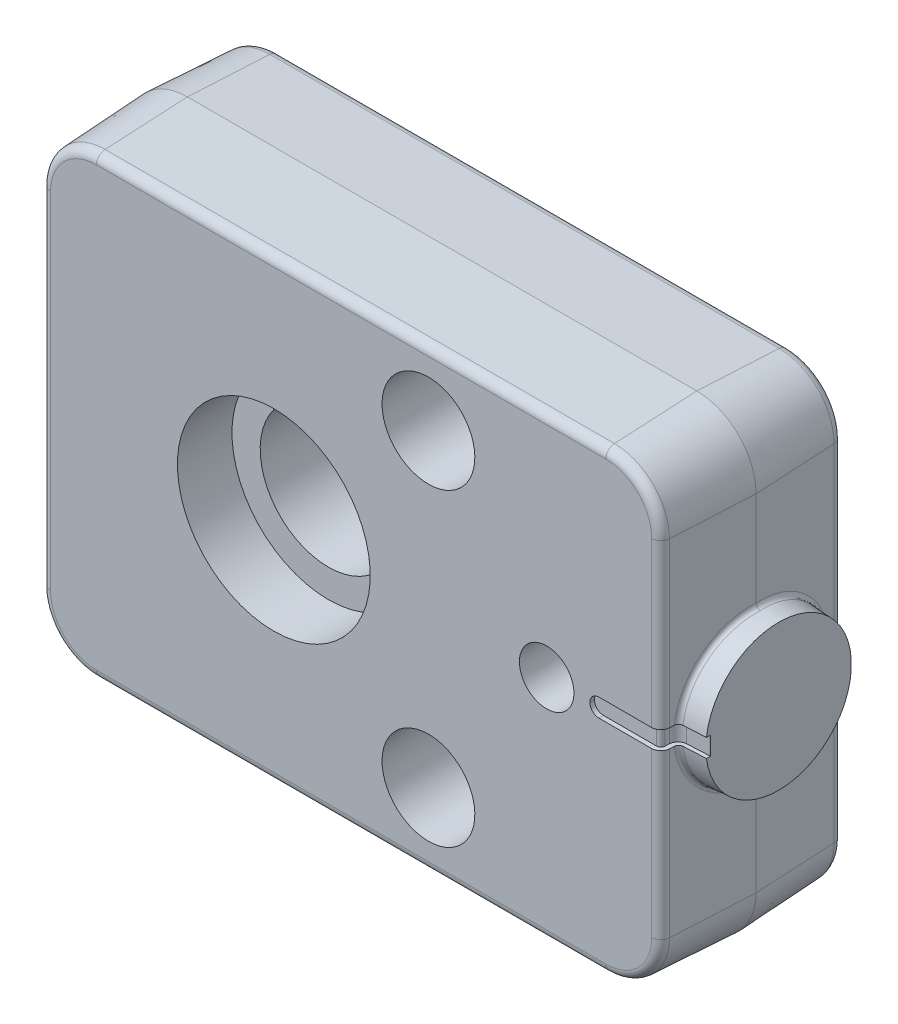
ISO-10303-21;
HEADER;
FILE_DESCRIPTION(('STEP AP214'),'2;1');
FILE_NAME('part.step','',(''),(''),'','','');
FILE_SCHEMA(('AUTOMOTIVE_DESIGN { 1 0 10303 214 1 1 1 1 }'));
ENDSEC;
DATA;
#1=APPLICATION_CONTEXT('core data for automotive mechanical design processes');
#2=APPLICATION_PROTOCOL_DEFINITION('international standard','automotive_design',2000,#1);
#3=PRODUCT_CONTEXT('',#1,'mechanical');
#4=PRODUCT('Part','Part','',(#3));
#5=PRODUCT_RELATED_PRODUCT_CATEGORY('part','',(#4));
#6=PRODUCT_DEFINITION_FORMATION('','',#4);
#7=PRODUCT_DEFINITION_CONTEXT('part definition',#1,'design');
#8=PRODUCT_DEFINITION('design','',#6,#7);
#9=PRODUCT_DEFINITION_SHAPE('','',#8);
#10=(LENGTH_UNIT() NAMED_UNIT(*) SI_UNIT(.MILLI.,.METRE.));
#11=(NAMED_UNIT(*) PLANE_ANGLE_UNIT() SI_UNIT($,.RADIAN.));
#12=(NAMED_UNIT(*) SI_UNIT($,.STERADIAN.) SOLID_ANGLE_UNIT());
#13=UNCERTAINTY_MEASURE_WITH_UNIT(LENGTH_MEASURE(1.E-05),#10,'distance_accuracy_value','');
#14=(GEOMETRIC_REPRESENTATION_CONTEXT(3) GLOBAL_UNCERTAINTY_ASSIGNED_CONTEXT((#13)) GLOBAL_UNIT_ASSIGNED_CONTEXT((#10,
#11,#12)) REPRESENTATION_CONTEXT('',''));
#15=CARTESIAN_POINT('',(0.,0.,0.));
#16=DIRECTION('',(0.,0.,1.));
#17=DIRECTION('',(1.,0.,0.));
#18=AXIS2_PLACEMENT_3D('',#15,#16,#17);
#19=CARTESIAN_POINT('',(-25.5,-25.,0.));
#20=DIRECTION('',(0.,0.,-1.));
#21=DIRECTION('',(0.,1.,0.));
#22=AXIS2_PLACEMENT_3D('',#19,#20,#21);
#23=PLANE('',#22);
#24=DIRECTION('',(1.,0.,0.));
#25=VECTOR('',#24,1.);
#26=CARTESIAN_POINT('',(-25.5,-24.0510354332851,0.));
#27=LINE('',#26,#25);
#28=CARTESIAN_POINT('',(36.5,-24.0510354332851,0.));
#29=VERTEX_POINT('',#28);
#30=CARTESIAN_POINT('',(-19.5,-24.0510354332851,0.));
#31=VERTEX_POINT('',#30);
#32=EDGE_CURVE('E271',#29,#31,#27,.F.);
#33=ORIENTED_EDGE('',*,*,#32,.T.);
#34=CARTESIAN_POINT('',(-19.5,-19.,0.));
#35=DIRECTION('',(0.,0.,-1.));
#36=DIRECTION('',(0.,1.,0.));
#37=AXIS2_PLACEMENT_3D('',#34,#35,#36);
#38=CIRCLE('',#37,5.05103543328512);
#39=CARTESIAN_POINT('',(-24.5510354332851,-19.,0.));
#40=VERTEX_POINT('',#39);
#41=EDGE_CURVE('E334',#31,#40,#38,.T.);
#42=ORIENTED_EDGE('',*,*,#41,.T.);
#43=DIRECTION('',(0.,-1.,0.));
#44=VECTOR('',#43,1.);
#45=CARTESIAN_POINT('',(-24.5510354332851,-25.,0.));
#46=LINE('',#45,#44);
#47=CARTESIAN_POINT('',(-24.5510354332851,19.,0.));
#48=VERTEX_POINT('',#47);
#49=EDGE_CURVE('E332',#40,#48,#46,.F.);
#50=ORIENTED_EDGE('',*,*,#49,.T.);
#51=CARTESIAN_POINT('',(-19.5,19.,0.));
#52=DIRECTION('',(0.,0.,-1.));
#53=DIRECTION('',(0.,1.,0.));
#54=AXIS2_PLACEMENT_3D('',#51,#52,#53);
#55=CIRCLE('',#54,5.05103543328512);
#56=CARTESIAN_POINT('',(-19.5,24.0510354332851,0.));
#57=VERTEX_POINT('',#56);
#58=EDGE_CURVE('E330',#48,#57,#55,.T.);
#59=ORIENTED_EDGE('',*,*,#58,.T.);
#60=DIRECTION('',(-1.,0.,0.));
#61=VECTOR('',#60,1.);
#62=CARTESIAN_POINT('',(-25.5,24.0510354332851,0.));
#63=LINE('',#62,#61);
#64=CARTESIAN_POINT('',(36.5,24.0510354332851,0.));
#65=VERTEX_POINT('',#64);
#66=EDGE_CURVE('E328',#57,#65,#63,.F.);
#67=ORIENTED_EDGE('',*,*,#66,.T.);
#68=CARTESIAN_POINT('',(36.5,19.,0.));
#69=DIRECTION('',(0.,0.,-1.));
#70=DIRECTION('',(0.,1.,0.));
#71=AXIS2_PLACEMENT_3D('',#68,#69,#70);
#72=CIRCLE('',#71,5.05103543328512);
#73=CARTESIAN_POINT('',(41.5510354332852,19.,0.));
#74=VERTEX_POINT('',#73);
#75=EDGE_CURVE('E326',#65,#74,#72,.T.);
#76=ORIENTED_EDGE('',*,*,#75,.T.);
#77=DIRECTION('',(0.,1.,0.));
#78=VECTOR('',#77,1.);
#79=CARTESIAN_POINT('',(41.5510354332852,-25.,0.));
#80=LINE('',#79,#78);
#81=CARTESIAN_POINT('',(41.5510354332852,-19.,0.));
#82=VERTEX_POINT('',#81);
#83=EDGE_CURVE('E324',#74,#82,#80,.F.);
#84=ORIENTED_EDGE('',*,*,#83,.T.);
#85=CARTESIAN_POINT('',(36.5,-19.,0.));
#86=DIRECTION('',(0.,0.,-1.));
#87=DIRECTION('',(0.,1.,0.));
#88=AXIS2_PLACEMENT_3D('',#85,#86,#87);
#89=CIRCLE('',#88,5.05103543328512);
#90=EDGE_CURVE('E322',#82,#29,#89,.T.);
#91=ORIENTED_EDGE('',*,*,#90,.T.);
#92=EDGE_LOOP('',(#33,#42,#50,#59,#67,#76,#84,#91));
#93=FACE_BOUND('',#92,.T.);
#94=CARTESIAN_POINT('',(17.,-17.,0.));
#95=DIRECTION('',(0.,0.,1.));
#96=DIRECTION('',(0.,-1.,0.));
#97=AXIS2_PLACEMENT_3D('',#94,#95,#96);
#98=CIRCLE('',#97,2.8);
#99=CARTESIAN_POINT('',(17.,-19.8,0.));
#100=VERTEX_POINT('',#99);
#101=EDGE_CURVE('E356',#100,#100,#98,.T.);
#102=ORIENTED_EDGE('',*,*,#101,.T.);
#103=EDGE_LOOP('',(#102));
#104=FACE_BOUND('',#103,.T.);
#105=CARTESIAN_POINT('',(17.,17.,0.));
#106=DIRECTION('',(0.,0.,1.));
#107=DIRECTION('',(0.,-1.,0.));
#108=AXIS2_PLACEMENT_3D('',#105,#106,#107);
#109=CIRCLE('',#108,2.8);
#110=CARTESIAN_POINT('',(17.,14.2,0.));
#111=VERTEX_POINT('',#110);
#112=EDGE_CURVE('E1329',#111,#111,#109,.T.);
#113=ORIENTED_EDGE('',*,*,#112,.T.);
#114=EDGE_LOOP('',(#113));
#115=FACE_BOUND('',#114,.T.);
#116=CARTESIAN_POINT('',(0.,0.,0.));
#117=DIRECTION('',(0.,0.,1.));
#118=DIRECTION('',(0.,-1.,0.));
#119=AXIS2_PLACEMENT_3D('',#116,#117,#118);
#120=CIRCLE('',#119,10.6);
#121=CARTESIAN_POINT('',(0.,-10.6,0.));
#122=VERTEX_POINT('',#121);
#123=EDGE_CURVE('E1306',#122,#122,#120,.T.);
#124=ORIENTED_EDGE('',*,*,#123,.T.);
#125=EDGE_LOOP('',(#124));
#126=FACE_BOUND('',#125,.T.);
#127=ADVANCED_FACE('F16',(#93,#104,#115,#126),#23,.T.);
#128=CARTESIAN_POINT('',(42.5,25.,20.));
#129=DIRECTION('',(0.998629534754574,0.,0.052335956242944));
#130=DIRECTION('',(-0.052335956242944,0.,0.998629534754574));
#131=AXIS2_PLACEMENT_3D('',#128,#129,#130);
#132=PLANE('',#131);
#133=DIRECTION('',(-0.052335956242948,0.,0.998629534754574));
#134=VECTOR('',#133,1.);
#135=CARTESIAN_POINT('',(42.5496649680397,1.,19.0523359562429));
#136=LINE('',#135,#134);
#137=CARTESIAN_POINT('',(42.5763358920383,1.,18.5434244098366));
#138=VERTEX_POINT('',#137);
#139=CARTESIAN_POINT('',(42.5496649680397,1.,19.0523359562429));
#140=VERTEX_POINT('',#139);
#141=EDGE_CURVE('E452',#138,#140,#136,.T.);
#142=ORIENTED_EDGE('',*,*,#141,.F.);
#143=CARTESIAN_POINT('',(43.0242106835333,0.,9.99746429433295));
#144=DIRECTION('',(0.998629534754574,0.,0.052335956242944));
#145=DIRECTION('',(-0.0523359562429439,0.,0.998629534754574));
#146=AXIS2_PLACEMENT_3D('',#143,#144,#145);
#147=ELLIPSE('',#146,8.61607684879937,8.60423636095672);
#148=CARTESIAN_POINT('',(43.0240777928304,8.60423598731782,10.));
#149=VERTEX_POINT('',#148);
#150=EDGE_CURVE('E605',#138,#149,#147,.F.);
#151=ORIENTED_EDGE('',*,*,#150,.T.);
#152=DIRECTION('',(0.,1.,0.));
#153=VECTOR('',#152,1.);
#154=CARTESIAN_POINT('',(43.0240777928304,25.,10.));
#155=LINE('',#154,#153);
#156=CARTESIAN_POINT('',(43.0240777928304,19.,10.));
#157=VERTEX_POINT('',#156);
#158=EDGE_CURVE('E258',#149,#157,#155,.T.);
#159=ORIENTED_EDGE('',*,*,#158,.T.);
#160=DIRECTION('',(0.0523359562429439,0.,-0.998629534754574));
#161=VECTOR('',#160,1.);
#162=CARTESIAN_POINT('',(42.5,19.,20.));
#163=LINE('',#162,#161);
#164=CARTESIAN_POINT('',(42.5496649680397,19.,19.0523359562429));
#165=VERTEX_POINT('',#164);
#166=EDGE_CURVE('E281',#157,#165,#163,.F.);
#167=ORIENTED_EDGE('',*,*,#166,.T.);
#168=DIRECTION('',(0.,1.,0.));
#169=VECTOR('',#168,1.);
#170=CARTESIAN_POINT('',(42.5496649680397,25.,19.0523359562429));
#171=LINE('',#170,#169);
#172=EDGE_CURVE('E642',#165,#140,#171,.F.);
#173=ORIENTED_EDGE('',*,*,#172,.T.);
#174=EDGE_LOOP('',(#142,#151,#159,#167,#173));
#175=FACE_BOUND('',#174,.T.);
#176=ADVANCED_FACE('F546',(#175),#132,.T.);
#177=CARTESIAN_POINT('',(-25.5,-25.,20.));
#178=DIRECTION('',(0.,0.,-1.));
#179=DIRECTION('',(0.,1.,0.));
#180=AXIS2_PLACEMENT_3D('',#177,#178,#179);
#181=PLANE('',#180);
#182=CARTESIAN_POINT('',(30.,0.,20.));
#183=DIRECTION('',(0.,0.,1.));
#184=DIRECTION('',(0.,-1.,0.));
#185=AXIS2_PLACEMENT_3D('',#182,#183,#184);
#186=CIRCLE('',#185,3.);
#187=CARTESIAN_POINT('',(30.,-3.,20.));
#188=VERTEX_POINT('',#187);
#189=EDGE_CURVE('E1301',#188,#188,#186,.T.);
#190=ORIENTED_EDGE('',*,*,#189,.F.);
#191=EDGE_LOOP('',(#190));
#192=FACE_BOUND('',#191,.T.);
#193=CARTESIAN_POINT('',(0.,0.,20.));
#194=DIRECTION('',(0.,0.,1.));
#195=DIRECTION('',(0.,-1.,0.));
#196=AXIS2_PLACEMENT_3D('',#193,#194,#195);
#197=CIRCLE('',#196,10.6);
#198=CARTESIAN_POINT('',(0.,-10.6,20.));
#199=VERTEX_POINT('',#198);
#200=EDGE_CURVE('E1312',#199,#199,#197,.T.);
#201=ORIENTED_EDGE('',*,*,#200,.F.);
#202=EDGE_LOOP('',(#201));
#203=FACE_BOUND('',#202,.T.);
#204=CARTESIAN_POINT('',(17.,17.,20.));
#205=DIRECTION('',(0.,0.,1.));
#206=DIRECTION('',(0.,-1.,0.));
#207=AXIS2_PLACEMENT_3D('',#204,#205,#206);
#208=CIRCLE('',#207,5.1);
#209=CARTESIAN_POINT('',(17.,11.9,20.));
#210=VERTEX_POINT('',#209);
#211=EDGE_CURVE('E1318',#210,#210,#208,.T.);
#212=ORIENTED_EDGE('',*,*,#211,.F.);
#213=EDGE_LOOP('',(#212));
#214=FACE_BOUND('',#213,.T.);
#215=CARTESIAN_POINT('',(17.,-17.,20.));
#216=DIRECTION('',(0.,0.,1.));
#217=DIRECTION('',(0.,-1.,0.));
#218=AXIS2_PLACEMENT_3D('',#215,#216,#217);
#219=CIRCLE('',#218,5.1);
#220=CARTESIAN_POINT('',(17.,-22.1,20.));
#221=VERTEX_POINT('',#220);
#222=EDGE_CURVE('E1332',#221,#221,#219,.T.);
#223=ORIENTED_EDGE('',*,*,#222,.F.);
#224=EDGE_LOOP('',(#223));
#225=FACE_BOUND('',#224,.T.);
#226=DIRECTION('',(-1.,0.,0.));
#227=VECTOR('',#226,1.);
#228=CARTESIAN_POINT('',(41.5510354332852,1.,20.));
#229=LINE('',#228,#227);
#230=CARTESIAN_POINT('',(41.5510354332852,1.,20.));
#231=VERTEX_POINT('',#230);
#232=CARTESIAN_POINT('',(35.75,1.,20.));
#233=VERTEX_POINT('',#232);
#234=EDGE_CURVE('E435',#231,#233,#229,.T.);
#235=ORIENTED_EDGE('',*,*,#234,.F.);
#236=DIRECTION('',(0.,-1.,0.));
#237=VECTOR('',#236,1.);
#238=CARTESIAN_POINT('',(41.5510354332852,-25.,20.));
#239=LINE('',#238,#237);
#240=CARTESIAN_POINT('',(41.5510354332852,19.,20.));
#241=VERTEX_POINT('',#240);
#242=EDGE_CURVE('E670',#231,#241,#239,.F.);
#243=ORIENTED_EDGE('',*,*,#242,.T.);
#244=CARTESIAN_POINT('',(36.5,19.,20.));
#245=DIRECTION('',(0.,0.,-1.));
#246=DIRECTION('',(0.,1.,0.));
#247=AXIS2_PLACEMENT_3D('',#244,#245,#246);
#248=CIRCLE('',#247,5.05103543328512);
#249=CARTESIAN_POINT('',(36.5,24.0510354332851,20.));
#250=VERTEX_POINT('',#249);
#251=EDGE_CURVE('E665',#241,#250,#248,.F.);
#252=ORIENTED_EDGE('',*,*,#251,.T.);
#253=DIRECTION('',(1.,0.,0.));
#254=VECTOR('',#253,1.);
#255=CARTESIAN_POINT('',(-25.5,24.0510354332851,20.));
#256=LINE('',#255,#254);
#257=CARTESIAN_POINT('',(-19.5,24.0510354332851,20.));
#258=VERTEX_POINT('',#257);
#259=EDGE_CURVE('E663',#250,#258,#256,.F.);
#260=ORIENTED_EDGE('',*,*,#259,.T.);
#261=CARTESIAN_POINT('',(-19.5,19.,20.));
#262=DIRECTION('',(0.,0.,-1.));
#263=DIRECTION('',(0.,1.,0.));
#264=AXIS2_PLACEMENT_3D('',#261,#262,#263);
#265=CIRCLE('',#264,5.05103543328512);
#266=CARTESIAN_POINT('',(-24.5510354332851,19.,20.));
#267=VERTEX_POINT('',#266);
#268=EDGE_CURVE('E661',#258,#267,#265,.F.);
#269=ORIENTED_EDGE('',*,*,#268,.T.);
#270=DIRECTION('',(0.,1.,0.));
#271=VECTOR('',#270,1.);
#272=CARTESIAN_POINT('',(-24.5510354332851,-25.,20.));
#273=LINE('',#272,#271);
#274=CARTESIAN_POINT('',(-24.5510354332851,-19.,20.));
#275=VERTEX_POINT('',#274);
#276=EDGE_CURVE('E659',#267,#275,#273,.F.);
#277=ORIENTED_EDGE('',*,*,#276,.T.);
#278=CARTESIAN_POINT('',(-19.5,-19.,20.));
#279=DIRECTION('',(0.,0.,-1.));
#280=DIRECTION('',(0.,1.,0.));
#281=AXIS2_PLACEMENT_3D('',#278,#279,#280);
#282=CIRCLE('',#281,5.05103543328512);
#283=CARTESIAN_POINT('',(-19.5,-24.0510354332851,20.));
#284=VERTEX_POINT('',#283);
#285=EDGE_CURVE('E656',#275,#284,#282,.F.);
#286=ORIENTED_EDGE('',*,*,#285,.T.);
#287=DIRECTION('',(-1.,0.,0.));
#288=VECTOR('',#287,1.);
#289=CARTESIAN_POINT('',(-25.5,-24.0510354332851,20.));
#290=LINE('',#289,#288);
#291=CARTESIAN_POINT('',(36.5,-24.0510354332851,20.));
#292=VERTEX_POINT('',#291);
#293=EDGE_CURVE('E673',#284,#292,#290,.F.);
#294=ORIENTED_EDGE('',*,*,#293,.T.);
#295=CARTESIAN_POINT('',(36.5,-19.,20.));
#296=DIRECTION('',(0.,0.,-1.));
#297=DIRECTION('',(0.,1.,0.));
#298=AXIS2_PLACEMENT_3D('',#295,#296,#297);
#299=CIRCLE('',#298,5.05103543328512);
#300=CARTESIAN_POINT('',(41.5510354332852,-19.,20.));
#301=VERTEX_POINT('',#300);
#302=EDGE_CURVE('E671',#292,#301,#299,.F.);
#303=ORIENTED_EDGE('',*,*,#302,.T.);
#304=CARTESIAN_POINT('',(41.5510354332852,-1.,20.));
#305=VERTEX_POINT('',#304);
#306=EDGE_CURVE('E667',#301,#305,#239,.F.);
#307=ORIENTED_EDGE('',*,*,#306,.T.);
#308=DIRECTION('',(-1.,0.,0.));
#309=VECTOR('',#308,1.);
#310=CARTESIAN_POINT('',(41.5510354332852,-1.,20.));
#311=LINE('',#310,#309);
#312=CARTESIAN_POINT('',(35.75,-1.,20.));
#313=VERTEX_POINT('',#312);
#314=EDGE_CURVE('E458',#305,#313,#311,.T.);
#315=ORIENTED_EDGE('',*,*,#314,.T.);
#316=CARTESIAN_POINT('',(35.75,0.,20.));
#317=DIRECTION('',(0.,0.,-1.));
#318=DIRECTION('',(0.,1.,0.));
#319=AXIS2_PLACEMENT_3D('',#316,#317,#318);
#320=CIRCLE('',#319,1.);
#321=CARTESIAN_POINT('',(34.75,0.,20.));
#322=VERTEX_POINT('',#321);
#323=EDGE_CURVE('E25',#313,#322,#320,.T.);
#324=ORIENTED_EDGE('',*,*,#323,.T.);
#325=CARTESIAN_POINT('',(35.75,0.,20.));
#326=DIRECTION('',(0.,0.,-1.));
#327=DIRECTION('',(0.,1.,0.));
#328=AXIS2_PLACEMENT_3D('',#325,#326,#327);
#329=CIRCLE('',#328,1.);
#330=EDGE_CURVE('E10',#322,#233,#329,.T.);
#331=ORIENTED_EDGE('',*,*,#330,.T.);
#332=EDGE_LOOP('',(#235,#243,#252,#260,#269,#277,#286,#294,#303,#307,#315,#324,#331));
#333=FACE_BOUND('',#332,.T.);
#334=ADVANCED_FACE('F573',(#192,#203,#214,#225,#333),#181,.F.);
#335=CARTESIAN_POINT('',(41.5510354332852,-25.,19.));
#336=DIRECTION('',(0.,-1.,0.));
#337=DIRECTION('',(0.,0.,-1.));
#338=AXIS2_PLACEMENT_3D('',#335,#336,#337);
#339=CYLINDRICAL_SURFACE('',#338,1.);
#340=ORIENTED_EDGE('',*,*,#242,.F.);
#341=CARTESIAN_POINT('',(41.5510354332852,1.,19.));
#342=DIRECTION('',(0.,-1.,0.));
#343=DIRECTION('',(0.,0.,-1.));
#344=AXIS2_PLACEMENT_3D('',#341,#342,#343);
#345=CIRCLE('',#344,1.);
#346=EDGE_CURVE('E433',#140,#231,#345,.T.);
#347=ORIENTED_EDGE('',*,*,#346,.F.);
#348=ORIENTED_EDGE('',*,*,#172,.F.);
#349=CARTESIAN_POINT('',(41.5510354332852,19.,19.));
#350=DIRECTION('',(0.,-1.,0.));
#351=DIRECTION('',(0.,0.,-1.));
#352=AXIS2_PLACEMENT_3D('',#349,#350,#351);
#353=CIRCLE('',#352,1.);
#354=EDGE_CURVE('E619',#165,#241,#353,.T.);
#355=ORIENTED_EDGE('',*,*,#354,.T.);
#356=EDGE_LOOP('',(#340,#347,#348,#355));
#357=FACE_BOUND('',#356,.T.);
#358=ADVANCED_FACE('F774',(#357),#339,.T.);
#359=CARTESIAN_POINT('',(43.0464268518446,0.,18.1285863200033));
#360=CARTESIAN_POINT('',(42.5968418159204,0.,18.152148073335));
#361=CARTESIAN_POINT('',(42.5732800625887,0.,18.6017331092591));
#362=CARTESIAN_POINT('',(43.0464268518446,-0.353705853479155,18.1285863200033));
#363=CARTESIAN_POINT('',(42.5968418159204,-0.355761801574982,18.152148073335));
#364=CARTESIAN_POINT('',(42.5732800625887,-0.37543294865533,18.6017331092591));
#365=CARTESIAN_POINT('',(43.0477164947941,-0.707411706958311,18.1053986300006));
#366=CARTESIAN_POINT('',(42.5980677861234,-0.711571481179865,18.128755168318));
#367=CARTESIAN_POINT('',(42.5745697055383,-0.750865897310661,18.577125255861));
#368=CARTESIAN_POINT('',(43.0528528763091,-1.40876818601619,18.0130472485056));
#369=CARTESIAN_POINT('',(42.6029489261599,-1.41695771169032,18.0356174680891));
#370=CARTESIAN_POINT('',(42.5797060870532,-1.49530783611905,18.4791172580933));
#371=CARTESIAN_POINT('',(43.0566997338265,-1.75641852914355,17.9438814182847));
#372=CARTESIAN_POINT('',(42.6066055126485,-1.76662652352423,17.965845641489));
#373=CARTESIAN_POINT('',(42.5835529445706,-1.86431652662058,18.4057148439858));
#374=CARTESIAN_POINT('',(43.0668846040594,-2.43971316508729,17.7607605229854));
#375=CARTESIAN_POINT('',(42.6162829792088,-2.45370866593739,17.7811885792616));
#376=CARTESIAN_POINT('',(42.5937378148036,-2.58959653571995,18.2113759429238));
#377=CARTESIAN_POINT('',(43.0732228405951,-2.77535637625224,17.6468014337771));
#378=CARTESIAN_POINT('',(42.6223065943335,-2.79120402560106,17.6662511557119));
#379=CARTESIAN_POINT('',(42.6000760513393,-2.94586670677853,18.0904351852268));
#380=CARTESIAN_POINT('',(43.088281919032,-3.428892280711,17.3760475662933));
#381=CARTESIAN_POINT('',(42.6366122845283,-3.44813745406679,17.3932823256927));
#382=CARTESIAN_POINT('',(42.6151351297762,-3.63957476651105,17.8030908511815));
#383=CARTESIAN_POINT('',(43.0970030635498,-3.74678271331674,17.2192473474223));
#384=CARTESIAN_POINT('',(42.6448982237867,-3.76764132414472,17.2351771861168));
#385=CARTESIAN_POINT('',(42.623856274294,-3.97701025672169,17.6366815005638));
#386=CARTESIAN_POINT('',(43.116678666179,-4.35937325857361,16.8654978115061));
#387=CARTESIAN_POINT('',(42.6635837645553,-4.38311160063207,16.8786358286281));
#388=CARTESIAN_POINT('',(42.6435318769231,-4.62727668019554,17.2612486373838));
#389=CARTESIAN_POINT('',(43.1276334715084,-4.6540697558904,16.6685422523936));
#390=CARTESIAN_POINT('',(42.6739880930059,-4.67912275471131,16.6801094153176));
#391=CARTESIAN_POINT('',(42.6544866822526,-4.94010377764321,17.052218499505));
#392=CARTESIAN_POINT('',(43.1515889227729,-5.21523029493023,16.2378554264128));
#393=CARTESIAN_POINT('',(42.6967292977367,-5.24254391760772,16.2461813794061));
#394=CARTESIAN_POINT('',(42.678442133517,-5.53580232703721,16.5951212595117));
#395=CARTESIAN_POINT('',(43.1645899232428,-5.48168943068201,16.0041177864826));
#396=CARTESIAN_POINT('',(42.7090714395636,-5.50997430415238,16.0106792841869));
#397=CARTESIAN_POINT('',(42.6914431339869,-5.81866857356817,16.3470473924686));
#398=CARTESIAN_POINT('',(43.1924153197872,-5.98181690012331,15.5038690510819));
#399=CARTESIAN_POINT('',(42.7354741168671,-6.01167368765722,15.5068861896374));
#400=CARTESIAN_POINT('',(42.7192685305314,-6.34960683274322,15.8161071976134));
#401=CARTESIAN_POINT('',(43.2072400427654,-6.21547933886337,15.2373520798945));
#402=CARTESIAN_POINT('',(42.7495400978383,-6.24593711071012,15.2384912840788));
#403=CARTESIAN_POINT('',(42.7340932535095,-6.59767259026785,15.5332346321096));
#404=CARTESIAN_POINT('',(43.238459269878,-6.64601665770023,14.6761071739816));
#405=CARTESIAN_POINT('',(42.7791471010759,-6.67732329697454,14.6735560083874));
#406=CARTESIAN_POINT('',(42.7653124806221,-7.05476633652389,14.9375362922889));
#407=CARTESIAN_POINT('',(43.2548540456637,-6.8428851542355,14.3813743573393));
#408=CARTESIAN_POINT('',(42.7946933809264,-6.87441478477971,14.3769153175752));
#409=CARTESIAN_POINT('',(42.7817072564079,-7.26378755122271,14.6247053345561));
#410=CARTESIAN_POINT('',(43.2889329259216,-7.19646760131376,13.7687423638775));
#411=CARTESIAN_POINT('',(42.8269927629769,-7.22812562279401,13.76060639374));
#412=CARTESIAN_POINT('',(42.8157861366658,-7.63921614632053,13.9744415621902));
#413=CARTESIAN_POINT('',(43.3066172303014,-7.35317530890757,13.4508395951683));
#414=CARTESIAN_POINT('',(42.8437505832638,-7.38469004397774,13.4408481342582));
#415=CARTESIAN_POINT('',(42.8334704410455,-7.80561690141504,13.637004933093));
#416=CARTESIAN_POINT('',(43.3429726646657,-7.62375638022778,12.7973081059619));
#417=CARTESIAN_POINT('',(42.8781846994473,-7.65471806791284,12.7838060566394));
#418=CARTESIAN_POINT('',(42.8698258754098,-8.09295704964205,12.9433019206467));
#419=CARTESIAN_POINT('',(43.3616439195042,-7.73762430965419,12.4616771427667));
#420=CARTESIAN_POINT('',(42.8958648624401,-7.76810677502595,12.4464484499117));
#421=CARTESIAN_POINT('',(42.8884971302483,-8.21389067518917,12.5870331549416));
#422=CARTESIAN_POINT('',(43.399653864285,-7.92057891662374,11.7784324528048));
#423=CARTESIAN_POINT('',(42.9318402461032,-7.94989981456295,11.7599972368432));
#424=CARTESIAN_POINT('',(42.9265070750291,-8.40822626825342,11.8617602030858));
#425=CARTESIAN_POINT('',(43.4189926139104,-7.98966157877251,11.4308176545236));
#426=CARTESIAN_POINT('',(42.9501382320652,-8.01821434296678,11.4108508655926));
#427=CARTESIAN_POINT('',(42.9458458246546,-8.4816239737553,11.4927548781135));
#428=CARTESIAN_POINT('',(43.4580067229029,-8.08186484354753,10.729553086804));
#429=CARTESIAN_POINT('',(42.9870360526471,-8.10874963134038,10.7067985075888));
#430=CARTESIAN_POINT('',(42.984859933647,-8.57963015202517,10.7483213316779));
#431=CARTESIAN_POINT('',(43.477682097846,-8.10498331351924,10.3759030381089));
#432=CARTESIAN_POINT('',(43.0056373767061,-8.13087175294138,10.3518641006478));
#433=CARTESIAN_POINT('',(43.0045353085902,-8.60423636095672,10.3728928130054));
#434=CARTESIAN_POINT('',(43.5170328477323,-8.10486364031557,9.66861869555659));
#435=CARTESIAN_POINT('',(43.042824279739,-8.12870239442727,9.64229572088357));
#436=CARTESIAN_POINT('',(43.0438860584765,-8.60423636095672,9.62203577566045));
#437=CARTESIAN_POINT('',(43.5367082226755,-8.08162549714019,9.31498440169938));
#438=CARTESIAN_POINT('',(43.0614099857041,-8.10431011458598,9.2876593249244));
#439=CARTESIAN_POINT('',(43.0635614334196,-8.57963015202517,9.24660725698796));
#440=CARTESIAN_POINT('',(43.575722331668,-7.98919104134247,8.61378178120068));
#441=CARTESIAN_POINT('',(43.0982491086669,-8.00958335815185,8.58472698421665));
#442=CARTESIAN_POINT('',(43.1025755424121,-8.4816239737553,8.50217371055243));
#443=CARTESIAN_POINT('',(43.5950610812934,-7.91999686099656,8.26621317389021));
#444=CARTESIAN_POINT('',(43.1165012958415,-7.93915274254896,8.23645450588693));
#445=CARTESIAN_POINT('',(43.1219142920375,-8.40822626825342,8.13316838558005));
#446=CARTESIAN_POINT('',(43.6330710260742,-7.73683497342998,7.58308815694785));
#447=CARTESIAN_POINT('',(43.152363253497,-7.7536001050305,7.55216758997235));
#448=CARTESIAN_POINT('',(43.1599242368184,-8.21389067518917,7.40789543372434));
#449=CARTESIAN_POINT('',(43.6517422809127,-7.62287128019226,7.24753067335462));
#450=CARTESIAN_POINT('',(43.1699705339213,-7.63839312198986,7.21620066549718));
#451=CARTESIAN_POINT('',(43.1785954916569,-8.09295704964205,7.0516266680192));
#452=CARTESIAN_POINT('',(43.688097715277,-7.35212096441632,6.59416842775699));
#453=CARTESIAN_POINT('',(43.2042441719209,-7.36529299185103,6.56222069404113));
#454=CARTESIAN_POINT('',(43.2149509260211,-7.80561690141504,6.35792365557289));
#455=CARTESIAN_POINT('',(43.7057820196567,-7.19533977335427,6.27636142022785));
#456=CARTESIAN_POINT('',(43.2209069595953,-7.2073318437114,6.24427576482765));
#457=CARTESIAN_POINT('',(43.2326352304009,-7.63921614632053,6.02048702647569));
#458=CARTESIAN_POINT('',(43.7398608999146,-6.84163765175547,5.66393670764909));
#459=CARTESIAN_POINT('',(43.2530096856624,-6.85144575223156,5.63171926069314));
#460=CARTESIAN_POINT('',(43.2667141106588,-7.26378755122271,5.37022325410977));
#461=CARTESIAN_POINT('',(43.7562556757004,-6.64472295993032,5.36931540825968));
#462=CARTESIAN_POINT('',(43.2684452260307,-6.65347443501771,5.3371916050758));
#463=CARTESIAN_POINT('',(43.2831088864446,-7.05476633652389,5.05739229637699));
#464=CARTESIAN_POINT('',(43.787474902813,-6.21412369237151,4.80830169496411));
#465=CARTESIAN_POINT('',(43.2978327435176,-6.22095868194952,4.77644436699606));
#466=CARTESIAN_POINT('',(43.3143281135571,-6.59767259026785,4.46169395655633));
#467=CARTESIAN_POINT('',(43.8022996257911,-5.98044549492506,4.54190439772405));
#468=CARTESIAN_POINT('',(43.311779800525,-5.98639274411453,4.51031866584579));
#469=CARTESIAN_POINT('',(43.3291528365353,-6.34960683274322,4.1788213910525));
#470=CARTESIAN_POINT('',(43.8301250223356,-5.48031802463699,4.04189501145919));
#471=CARTESIAN_POINT('',(43.3379550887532,-5.48468748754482,4.01086441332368));
#472=CARTESIAN_POINT('',(43.3569782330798,-5.81866857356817,3.64788119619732));
#473=CARTESIAN_POINT('',(43.8431260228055,-5.21387464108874,3.80827704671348));
#474=CARTESIAN_POINT('',(43.3501782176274,-5.21755314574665,3.77763322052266));
#475=CARTESIAN_POINT('',(43.3699792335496,-5.53580232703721,3.39980732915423));
#476=CARTESIAN_POINT('',(43.8670814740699,-4.65277604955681,3.37782141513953));
#477=CARTESIAN_POINT('',(43.3726996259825,-4.65525139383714,3.34789914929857));
#478=CARTESIAN_POINT('',(43.3939346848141,-4.94010377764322,2.94271008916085));
#479=CARTESIAN_POINT('',(43.8780362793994,-4.35812574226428,3.18097737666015));
#480=CARTESIAN_POINT('',(43.3829929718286,-4.36011529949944,3.15149041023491));
#481=CARTESIAN_POINT('',(43.4048894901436,-4.62727668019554,2.73367995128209));
#482=CARTESIAN_POINT('',(43.8977118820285,-3.74565487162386,2.82743512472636));
#483=CARTESIAN_POINT('',(43.4014813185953,-3.74681446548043,2.79871173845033));
#484=CARTESIAN_POINT('',(43.4245650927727,-3.97701025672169,2.35824708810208));
#485=CARTESIAN_POINT('',(43.9064330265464,-3.42783791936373,2.67073067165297));
#486=CARTESIAN_POINT('',(43.4096718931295,-3.42870549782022,2.64242626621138));
#487=CARTESIAN_POINT('',(43.4332862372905,-3.63957476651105,2.19183773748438));
#488=CARTESIAN_POINT('',(43.9214921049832,-2.77447126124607,2.40014605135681));
#489=CARTESIAN_POINT('',(43.4238164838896,-2.77484429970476,2.37253139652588));
#490=CARTESIAN_POINT('',(43.4483453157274,-2.94586670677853,1.90449340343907));
#491=CARTESIAN_POINT('',(43.9278303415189,-2.43892381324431,2.28626044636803));
#492=CARTESIAN_POINT('',(43.4297668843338,-2.43916879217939,2.25899099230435));
#493=CARTESIAN_POINT('',(43.4546835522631,-2.58959653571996,1.78355264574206));
#494=CARTESIAN_POINT('',(43.9380152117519,-1.75583646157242,2.10325922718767));
#495=CARTESIAN_POINT('',(43.4393303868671,-1.75585230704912,2.07650849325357));
#496=CARTESIAN_POINT('',(43.4648684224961,-1.86431652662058,1.58921374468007));
#497=CARTESIAN_POINT('',(43.9418620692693,-1.40829763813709,2.03413959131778));
#498=CARTESIAN_POINT('',(43.4429409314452,-1.40830410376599,2.00761519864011));
#499=CARTESIAN_POINT('',(43.4687152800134,-1.49530783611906,1.51581133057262));
#500=CARTESIAN_POINT('',(43.9469984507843,-0.707172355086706,1.94185015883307));
#501=CARTESIAN_POINT('',(43.4477630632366,-0.707119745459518,1.91560344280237));
#502=CARTESIAN_POINT('',(43.4738516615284,-0.750865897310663,1.41780333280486));
#503=CARTESIAN_POINT('',(43.9482880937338,-0.353586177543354,1.91867822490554));
#504=CARTESIAN_POINT('',(43.4489733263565,-0.353586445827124,1.89251024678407));
#505=CARTESIAN_POINT('',(43.475141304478,-0.375432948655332,1.39319547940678));
#506=CARTESIAN_POINT('',(43.9482880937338,0.353586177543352,1.91867822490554));
#507=CARTESIAN_POINT('',(43.4489733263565,0.353586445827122,1.89251024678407));
#508=CARTESIAN_POINT('',(43.475141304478,0.37543294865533,1.39319547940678));
#509=CARTESIAN_POINT('',(43.9469984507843,0.707172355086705,1.94185015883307));
#510=CARTESIAN_POINT('',(43.4477630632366,0.707119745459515,1.91560344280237));
#511=CARTESIAN_POINT('',(43.4738516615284,0.750865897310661,1.41780333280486));
#512=CARTESIAN_POINT('',(43.9418620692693,1.40829763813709,2.03413959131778));
#513=CARTESIAN_POINT('',(43.4429409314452,1.40830410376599,2.00761519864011));
#514=CARTESIAN_POINT('',(43.4687152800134,1.49530783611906,1.51581133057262));
#515=CARTESIAN_POINT('',(43.9380152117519,1.75583646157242,2.10325922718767));
#516=CARTESIAN_POINT('',(43.4393303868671,1.75585230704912,2.07650849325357));
#517=CARTESIAN_POINT('',(43.4648684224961,1.86431652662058,1.58921374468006));
#518=CARTESIAN_POINT('',(43.9278303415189,2.43892381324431,2.28626044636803));
#519=CARTESIAN_POINT('',(43.4297668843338,2.43916879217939,2.25899099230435));
#520=CARTESIAN_POINT('',(43.4546835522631,2.58959653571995,1.78355264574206));
#521=CARTESIAN_POINT('',(43.9214921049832,2.77447126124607,2.40014605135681));
#522=CARTESIAN_POINT('',(43.4238164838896,2.77484429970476,2.37253139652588));
#523=CARTESIAN_POINT('',(43.4483453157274,2.94586670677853,1.90449340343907));
#524=CARTESIAN_POINT('',(43.9064330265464,3.42783791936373,2.67073067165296));
#525=CARTESIAN_POINT('',(43.4096718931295,3.42870549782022,2.64242626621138));
#526=CARTESIAN_POINT('',(43.4332862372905,3.63957476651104,2.19183773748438));
#527=CARTESIAN_POINT('',(43.8977118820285,3.74565487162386,2.82743512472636));
#528=CARTESIAN_POINT('',(43.4014813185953,3.74681446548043,2.79871173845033));
#529=CARTESIAN_POINT('',(43.4245650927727,3.97701025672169,2.35824708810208));
#530=CARTESIAN_POINT('',(43.8780362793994,4.35812574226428,3.18097737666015));
#531=CARTESIAN_POINT('',(43.3829929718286,4.36011529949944,3.15149041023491));
#532=CARTESIAN_POINT('',(43.4048894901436,4.62727668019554,2.73367995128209));
#533=CARTESIAN_POINT('',(43.8670814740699,4.6527760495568,3.37782141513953));
#534=CARTESIAN_POINT('',(43.3726996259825,4.65525139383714,3.34789914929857));
#535=CARTESIAN_POINT('',(43.3939346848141,4.94010377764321,2.94271008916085));
#536=CARTESIAN_POINT('',(43.8431260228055,5.21387464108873,3.80827704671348));
#537=CARTESIAN_POINT('',(43.3501782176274,5.21755314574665,3.77763322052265));
#538=CARTESIAN_POINT('',(43.3699792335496,5.53580232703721,3.39980732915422));
#539=CARTESIAN_POINT('',(43.8301250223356,5.48031802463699,4.04189501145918));
#540=CARTESIAN_POINT('',(43.3379550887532,5.48468748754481,4.01086441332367));
#541=CARTESIAN_POINT('',(43.3569782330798,5.81866857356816,3.64788119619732));
#542=CARTESIAN_POINT('',(43.8022996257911,5.98044549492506,4.54190439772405));
#543=CARTESIAN_POINT('',(43.311779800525,5.98639274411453,4.51031866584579));
#544=CARTESIAN_POINT('',(43.3291528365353,6.34960683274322,4.1788213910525));
#545=CARTESIAN_POINT('',(43.787474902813,6.21412369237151,4.8083016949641));
#546=CARTESIAN_POINT('',(43.2978327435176,6.22095868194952,4.77644436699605));
#547=CARTESIAN_POINT('',(43.3143281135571,6.59767259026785,4.46169395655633));
#548=CARTESIAN_POINT('',(43.7562556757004,6.64472295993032,5.36931540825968));
#549=CARTESIAN_POINT('',(43.2684452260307,6.65347443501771,5.3371916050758));
#550=CARTESIAN_POINT('',(43.2831088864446,7.05476633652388,5.05739229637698));
#551=CARTESIAN_POINT('',(43.7398608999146,6.84163765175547,5.66393670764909));
#552=CARTESIAN_POINT('',(43.2530096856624,6.85144575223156,5.63171926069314));
#553=CARTESIAN_POINT('',(43.2667141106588,7.26378755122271,5.37022325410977));
#554=CARTESIAN_POINT('',(43.7057820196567,7.19533977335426,6.27636142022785));
#555=CARTESIAN_POINT('',(43.2209069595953,7.2073318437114,6.24427576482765));
#556=CARTESIAN_POINT('',(43.2326352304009,7.63921614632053,6.02048702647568));
#557=CARTESIAN_POINT('',(43.688097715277,7.35212096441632,6.59416842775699));
#558=CARTESIAN_POINT('',(43.2042441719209,7.36529299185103,6.56222069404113));
#559=CARTESIAN_POINT('',(43.2149509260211,7.80561690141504,6.35792365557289));
#560=CARTESIAN_POINT('',(43.6517422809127,7.62287128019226,7.24753067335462));
#561=CARTESIAN_POINT('',(43.1699705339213,7.63839312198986,7.21620066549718));
#562=CARTESIAN_POINT('',(43.1785954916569,8.09295704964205,7.0516266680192));
#563=CARTESIAN_POINT('',(43.6330710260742,7.73683497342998,7.58308815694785));
#564=CARTESIAN_POINT('',(43.152363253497,7.7536001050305,7.55216758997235));
#565=CARTESIAN_POINT('',(43.1599242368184,8.21389067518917,7.40789543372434));
#566=CARTESIAN_POINT('',(43.5950610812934,7.91999686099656,8.26621317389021));
#567=CARTESIAN_POINT('',(43.1165012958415,7.93915274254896,8.23645450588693));
#568=CARTESIAN_POINT('',(43.1219142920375,8.40822626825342,8.13316838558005));
#569=CARTESIAN_POINT('',(43.575722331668,7.98919104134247,8.61378178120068));
#570=CARTESIAN_POINT('',(43.0982491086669,8.00958335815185,8.58472698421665));
#571=CARTESIAN_POINT('',(43.1025755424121,8.4816239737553,8.50217371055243));
#572=CARTESIAN_POINT('',(43.5367082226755,8.08162549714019,9.31498440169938));
#573=CARTESIAN_POINT('',(43.0614099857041,8.10431011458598,9.2876593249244));
#574=CARTESIAN_POINT('',(43.0635614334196,8.57963015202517,9.24660725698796));
#575=CARTESIAN_POINT('',(43.5170328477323,8.10486364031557,9.66861869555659));
#576=CARTESIAN_POINT('',(43.042824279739,8.12870239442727,9.64229572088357));
#577=CARTESIAN_POINT('',(43.0438860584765,8.60423636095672,9.62203577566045));
#578=CARTESIAN_POINT('',(43.477682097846,8.10498331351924,10.3759030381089));
#579=CARTESIAN_POINT('',(43.0056373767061,8.13087175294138,10.3518641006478));
#580=CARTESIAN_POINT('',(43.0045353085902,8.60423636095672,10.3728928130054));
#581=CARTESIAN_POINT('',(43.4580067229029,8.08186484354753,10.729553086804));
#582=CARTESIAN_POINT('',(42.9870360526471,8.10874963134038,10.7067985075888));
#583=CARTESIAN_POINT('',(42.984859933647,8.57963015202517,10.7483213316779));
#584=CARTESIAN_POINT('',(43.4189926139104,7.98966157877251,11.4308176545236));
#585=CARTESIAN_POINT('',(42.9501382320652,8.01821434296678,11.4108508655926));
#586=CARTESIAN_POINT('',(42.9458458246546,8.4816239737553,11.4927548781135));
#587=CARTESIAN_POINT('',(43.399653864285,7.92057891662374,11.7784324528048));
#588=CARTESIAN_POINT('',(42.9318402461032,7.94989981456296,11.7599972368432));
#589=CARTESIAN_POINT('',(42.9265070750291,8.40822626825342,11.8617602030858));
#590=CARTESIAN_POINT('',(43.3616439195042,7.73762430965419,12.4616771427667));
#591=CARTESIAN_POINT('',(42.8958648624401,7.76810677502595,12.4464484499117));
#592=CARTESIAN_POINT('',(42.8884971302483,8.21389067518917,12.5870331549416));
#593=CARTESIAN_POINT('',(43.3429726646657,7.62375638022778,12.7973081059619));
#594=CARTESIAN_POINT('',(42.8781846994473,7.65471806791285,12.7838060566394));
#595=CARTESIAN_POINT('',(42.8698258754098,8.09295704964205,12.9433019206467));
#596=CARTESIAN_POINT('',(43.3066172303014,7.35317530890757,13.4508395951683));
#597=CARTESIAN_POINT('',(42.8437505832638,7.38469004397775,13.4408481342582));
#598=CARTESIAN_POINT('',(42.8334704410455,7.80561690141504,13.637004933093));
#599=CARTESIAN_POINT('',(43.2889329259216,7.19646760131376,13.7687423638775));
#600=CARTESIAN_POINT('',(42.8269927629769,7.22812562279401,13.76060639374));
#601=CARTESIAN_POINT('',(42.8157861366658,7.63921614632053,13.9744415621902));
#602=CARTESIAN_POINT('',(43.2548540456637,6.8428851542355,14.3813743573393));
#603=CARTESIAN_POINT('',(42.7946933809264,6.87441478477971,14.3769153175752));
#604=CARTESIAN_POINT('',(42.7817072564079,7.26378755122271,14.6247053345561));
#605=CARTESIAN_POINT('',(43.238459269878,6.64601665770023,14.6761071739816));
#606=CARTESIAN_POINT('',(42.7791471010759,6.67732329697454,14.6735560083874));
#607=CARTESIAN_POINT('',(42.7653124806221,7.05476633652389,14.9375362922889));
#608=CARTESIAN_POINT('',(43.2072400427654,6.21547933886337,15.2373520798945));
#609=CARTESIAN_POINT('',(42.7495400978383,6.24593711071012,15.2384912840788));
#610=CARTESIAN_POINT('',(42.7340932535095,6.59767259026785,15.5332346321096));
#611=CARTESIAN_POINT('',(43.1924153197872,5.98181690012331,15.5038690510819));
#612=CARTESIAN_POINT('',(42.7354741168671,6.01167368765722,15.5068861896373));
#613=CARTESIAN_POINT('',(42.7192685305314,6.34960683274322,15.8161071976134));
#614=CARTESIAN_POINT('',(43.1645899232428,5.48168943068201,16.0041177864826));
#615=CARTESIAN_POINT('',(42.7090714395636,5.50997430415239,16.0106792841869));
#616=CARTESIAN_POINT('',(42.6914431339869,5.81866857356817,16.3470473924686));
#617=CARTESIAN_POINT('',(43.1515889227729,5.21523029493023,16.2378554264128));
#618=CARTESIAN_POINT('',(42.6967292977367,5.24254391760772,16.2461813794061));
#619=CARTESIAN_POINT('',(42.678442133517,5.53580232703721,16.5951212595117));
#620=CARTESIAN_POINT('',(43.1276334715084,4.6540697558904,16.6685422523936));
#621=CARTESIAN_POINT('',(42.6739880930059,4.67912275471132,16.6801094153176));
#622=CARTESIAN_POINT('',(42.6544866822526,4.94010377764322,17.052218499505));
#623=CARTESIAN_POINT('',(43.116678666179,4.35937325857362,16.8654978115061));
#624=CARTESIAN_POINT('',(42.6635837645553,4.38311160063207,16.8786358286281));
#625=CARTESIAN_POINT('',(42.6435318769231,4.62727668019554,17.2612486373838));
#626=CARTESIAN_POINT('',(43.0970030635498,3.74678271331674,17.2192473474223));
#627=CARTESIAN_POINT('',(42.6448982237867,3.76764132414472,17.2351771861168));
#628=CARTESIAN_POINT('',(42.623856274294,3.97701025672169,17.6366815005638));
#629=CARTESIAN_POINT('',(43.088281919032,3.428892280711,17.3760475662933));
#630=CARTESIAN_POINT('',(42.6366122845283,3.44813745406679,17.3932823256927));
#631=CARTESIAN_POINT('',(42.6151351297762,3.63957476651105,17.8030908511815));
#632=CARTESIAN_POINT('',(43.0732228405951,2.77535637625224,17.6468014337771));
#633=CARTESIAN_POINT('',(42.6223065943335,2.79120402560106,17.6662511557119));
#634=CARTESIAN_POINT('',(42.6000760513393,2.94586670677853,18.0904351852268));
#635=CARTESIAN_POINT('',(43.0668846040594,2.43971316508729,17.7607605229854));
#636=CARTESIAN_POINT('',(42.6162829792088,2.4537086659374,17.7811885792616));
#637=CARTESIAN_POINT('',(42.5937378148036,2.58959653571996,18.2113759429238));
#638=CARTESIAN_POINT('',(43.0566997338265,1.75641852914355,17.9438814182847));
#639=CARTESIAN_POINT('',(42.6066055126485,1.76662652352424,17.965845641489));
#640=CARTESIAN_POINT('',(42.5835529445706,1.86431652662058,18.4057148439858));
#641=CARTESIAN_POINT('',(43.0528528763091,1.40876818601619,18.0130472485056));
#642=CARTESIAN_POINT('',(42.6029489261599,1.41695771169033,18.0356174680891));
#643=CARTESIAN_POINT('',(42.5797060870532,1.49530783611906,18.4791172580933));
#644=CARTESIAN_POINT('',(43.0477164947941,0.707411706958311,18.1053986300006));
#645=CARTESIAN_POINT('',(42.5980677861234,0.711571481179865,18.128755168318));
#646=CARTESIAN_POINT('',(42.5745697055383,0.750865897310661,18.577125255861));
#647=CARTESIAN_POINT('',(43.0464268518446,0.353705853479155,18.1285863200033));
#648=CARTESIAN_POINT('',(42.5968418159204,0.355761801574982,18.152148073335));
#649=CARTESIAN_POINT('',(42.5732800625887,0.37543294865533,18.6017331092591));
#650=CARTESIAN_POINT('',(43.0464268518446,0.,18.1285863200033));
#651=CARTESIAN_POINT('',(42.5968418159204,0.,18.152148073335));
#652=CARTESIAN_POINT('',(42.5732800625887,0.,18.6017331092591));
#653=(BOUNDED_SURFACE() B_SPLINE_SURFACE(3,2,((#359,#360,#361),(#362,#363,#364),(#365,#366,
#367),(#368,#369,#370),(#371,#372,#373),(#374,#375,#376),(#377,#378,#379),(#380,#381,#382),
(#383,#384,#385),(#386,#387,#388),(#389,#390,#391),(#392,#393,#394),(#395,#396,#397),(#398,#399,
#400),(#401,#402,#403),(#404,#405,#406),(#407,#408,#409),(#410,#411,#412),(#413,#414,#415),
(#416,#417,#418),(#419,#420,#421),(#422,#423,#424),(#425,#426,#427),(#428,#429,#430),(#431,#432,
#433),(#434,#435,#436),(#437,#438,#439),(#440,#441,#442),(#443,#444,#445),(#446,#447,#448),
(#449,#450,#451),(#452,#453,#454),(#455,#456,#457),(#458,#459,#460),(#461,#462,#463),(#464,#465,
#466),(#467,#468,#469),(#470,#471,#472),(#473,#474,#475),(#476,#477,#478),(#479,#480,#481),
(#482,#483,#484),(#485,#486,#487),(#488,#489,#490),(#491,#492,#493),(#494,#495,#496),(#497,#498,
#499),(#500,#501,#502),(#503,#504,#505),(#506,#507,#508),(#509,#510,#511),(#512,#513,#514),
(#515,#516,#517),(#518,#519,#520),(#521,#522,#523),(#524,#525,#526),(#527,#528,#529),(#530,#531,
#532),(#533,#534,#535),(#536,#537,#538),(#539,#540,#541),(#542,#543,#544),(#545,#546,#547),
(#548,#549,#550),(#551,#552,#553),(#554,#555,#556),(#557,#558,#559),(#560,#561,#562),(#563,#564,
#565),(#566,#567,#568),(#569,#570,#571),(#572,#573,#574),(#575,#576,#577),(#578,#579,#580),
(#581,#582,#583),(#584,#585,#586),(#587,#588,#589),(#590,#591,#592),(#593,#594,#595),(#596,#597,
#598),(#599,#600,#601),(#602,#603,#604),(#605,#606,#607),(#608,#609,#610),(#611,#612,#613),
(#614,#615,#616),(#617,#618,#619),(#620,#621,#622),(#623,#624,#625),(#626,#627,#628),(#629,#630,
#631),(#632,#633,#634),(#635,#636,#637),(#638,#639,#640),(#641,#642,#643),(#644,#645,#646),
(#647,#648,#649),(#650,#651,#652)),.UNSPECIFIED.,.T.,.F.,.F.) B_SPLINE_SURFACE_WITH_KNOTS((4,2,
2,2,2,2,2,2,2,2,2,2,2,2,2,2,2,2,2,2,2,2,2,2,2,2,2,2,2,2,2,2,2,2,2,2,2,2,2,2,2,2,2,2,2,2,2,2,4),
(3,3),(0.,1.12549459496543,2.25104154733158,3.37668963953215,4.502480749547,5.62844699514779,
6.75460854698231,7.88097225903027,9.00753120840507,10.1342651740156,11.2611420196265,
12.3881198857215,13.5151500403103,14.6421801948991,15.7691580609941,16.896034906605,
18.0227688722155,19.1493278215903,20.2756915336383,21.4018530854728,22.5278193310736,
23.6536104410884,24.779258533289,25.9048054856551,27.0303000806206,28.155794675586,
29.2813416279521,30.4069897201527,31.5327808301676,32.6587470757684,33.7849086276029,
34.9112723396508,36.0378312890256,37.1645652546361,38.2914421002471,39.4184199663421,
40.5454501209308,41.6724802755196,42.7994581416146,43.9263349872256,45.053068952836,
46.1796279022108,47.3059916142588,48.4321531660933,49.5581194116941,50.683910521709,
51.8095586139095,52.9351055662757,54.0606001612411),(0.,1.),
.UNSPECIFIED.) GEOMETRIC_REPRESENTATION_ITEM() RATIONAL_B_SPLINE_SURFACE(((1.,0.743144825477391,
1.),(1.,0.743144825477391,1.),(1.,0.743094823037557,1.),(1.,0.742895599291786,1.),(1.,
0.74274637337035,1.),(1.,0.742351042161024,1.),(1.,0.742104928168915,1.),(1.,0.741519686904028,
1.),(1.,0.741180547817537,1.),(1.,0.74041460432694,1.),(1.,0.739987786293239,1.),(1.,
0.739053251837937,1.),(1.,0.738545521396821,1.),(1.,0.737457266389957,1.),(1.,0.736876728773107,
1.),(1.,0.735652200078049,1.),(1.,0.735008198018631,1.),(1.,0.733667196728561,1.),(1.,
0.732970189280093,1.),(1.,0.731534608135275,1.),(1.,0.73079602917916,1.),(1.,0.729289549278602,
1.),(1.,0.728521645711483,1.),(1.,0.726969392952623,1.),(1.,0.726185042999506,1.),(1.,
0.724613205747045,1.),(1.,0.723825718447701,1.),(1.,0.722261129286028,1.),(1.,0.721484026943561,
1.),(1.,0.719953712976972,1.),(1.,0.719200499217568,1.),(1.,0.717731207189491,1.),(1.,
0.717015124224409,1.),(1.,0.715632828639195,1.),(1.,0.71496660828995,1.),(1.,0.713696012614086,
1.),(1.,0.713091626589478,1.),(1.,0.711955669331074,1.),(1.,0.711424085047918,1.),(1.,
0.710443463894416,1.),(1.,0.70999441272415,1.),(1.,0.709187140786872,1.),(1.,0.708828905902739,
1.),(1.,0.708209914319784,1.),(1.,0.707949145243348,1.),(1.,0.707529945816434,1.),(1.,
0.707371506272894,1.),(1.,0.707159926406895,1.),(1.,0.707106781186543,1.),(1.,0.707106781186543,
1.),(1.,0.707159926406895,1.),(1.,0.707371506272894,1.),(1.,0.707529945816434,1.),(1.,
0.707949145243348,1.),(1.,0.708209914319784,1.),(1.,0.708828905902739,1.),(1.,0.709187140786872,
1.),(1.,0.70999441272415,1.),(1.,0.710443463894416,1.),(1.,0.711424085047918,1.),(1.,
0.711955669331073,1.),(1.,0.713091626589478,1.),(1.,0.713696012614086,1.),(1.,0.71496660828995,
1.),(1.,0.715632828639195,1.),(1.,0.717015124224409,1.),(1.,0.717731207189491,1.),(1.,
0.719200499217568,1.),(1.,0.719953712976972,1.),(1.,0.721484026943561,1.),(1.,0.722261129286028,
1.),(1.,0.723825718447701,1.),(1.,0.724613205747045,1.),(1.,0.726185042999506,1.),(1.,
0.726969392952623,1.),(1.,0.728521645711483,1.),(1.,0.729289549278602,1.),(1.,0.73079602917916,
1.),(1.,0.731534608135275,1.),(1.,0.732970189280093,1.),(1.,0.733667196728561,1.),(1.,
0.735008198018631,1.),(1.,0.735652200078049,1.),(1.,0.736876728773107,1.),(1.,0.737457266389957,
1.),(1.,0.738545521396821,1.),(1.,0.739053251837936,1.),(1.,0.739987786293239,1.),(1.,
0.74041460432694,1.),(1.,0.741180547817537,1.),(1.,0.741519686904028,1.),(1.,0.742104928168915,
1.),(1.,0.742351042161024,1.),(1.,0.74274637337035,1.),(1.,0.742895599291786,1.),(1.,
0.743094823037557,1.),(1.,0.743144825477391,1.),(1.,0.743144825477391,1.))) REPRESENTATION_ITEM('') SURFACE());
#654=CARTESIAN_POINT('',(43.0498711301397,1.,18.0666586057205));
#655=CARTESIAN_POINT('',(43.0218935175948,1.,18.0681108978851));
#656=CARTESIAN_POINT('',(42.9940528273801,1.,18.071979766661));
#657=CARTESIAN_POINT('',(42.9394382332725,1.,18.0843193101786));
#658=CARTESIAN_POINT('',(42.9126632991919,1.,18.0927854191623));
#659=CARTESIAN_POINT('',(42.8609049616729,1.,18.1140958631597));
#660=CARTESIAN_POINT('',(42.835922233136,1.,18.1269418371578));
#661=CARTESIAN_POINT('',(42.7884600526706,1.,18.156624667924));
#662=CARTESIAN_POINT('',(42.7659801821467,1.,18.1734608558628));
#663=CARTESIAN_POINT('',(42.7240498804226,1.,18.2107184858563));
#664=CARTESIAN_POINT('',(42.7046125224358,1.,18.23115463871));
#665=CARTESIAN_POINT('',(42.6694072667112,1.,18.2749890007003));
#666=CARTESIAN_POINT('',(42.6536410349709,1.,18.2983885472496));
#667=CARTESIAN_POINT('',(42.6261083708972,1.,18.3476702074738));
#668=CARTESIAN_POINT('',(42.6143737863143,1.,18.3735701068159));
#669=CARTESIAN_POINT('',(42.5954144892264,1.,18.4269347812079));
#670=CARTESIAN_POINT('',(42.5881835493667,1.,18.4543973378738));
#671=CARTESIAN_POINT('',(42.5797276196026,1.,18.5024880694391));
#672=CARTESIAN_POINT('',(42.5773999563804,1.,18.522927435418));
#673=CARTESIAN_POINT('',(42.5763358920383,1.,18.5434244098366));
#674=B_SPLINE_CURVE_WITH_KNOTS('',3,(#654,#655,#656,#657,#658,#659,#660,#661,#662,#663,#664,
#665,#666,#667,#668,#669,#670,#671,#672,#673),.UNSPECIFIED.,.F.,.F.,(4,2,2,2,2,2,2,2,2,4),(0.,
0.0839299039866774,0.167776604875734,0.25165471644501,0.335518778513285,0.419733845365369,
0.503987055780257,0.588891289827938,0.673677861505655,0.735236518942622),.UNSPECIFIED.);
#675=CARTESIAN_POINT('',(43.0498711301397,1.,18.0666586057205));
#676=VERTEX_POINT('',#675);
#677=EDGE_CURVE('E518',#676,#138,#674,.T.);
#678=ORIENTED_EDGE('',*,*,#677,.F.);
#679=CARTESIAN_POINT('',(43.4985959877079,8.10488913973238,10.));
#680=CARTESIAN_POINT('',(43.4800652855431,8.10641071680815,10.3330671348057));
#681=CARTESIAN_POINT('',(43.4614952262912,8.08658039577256,10.6668494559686));
#682=CARTESIAN_POINT('',(43.3927588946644,7.93570886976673,11.9023572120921));
#683=CARTESIAN_POINT('',(43.3433096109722,7.67188541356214,12.7912398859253));
#684=CARTESIAN_POINT('',(43.2521776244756,6.86431501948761,14.429476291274));
#685=CARTESIAN_POINT('',(43.2104942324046,6.32059294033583,15.1788424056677));
#686=CARTESIAN_POINT('',(43.1395133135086,5.01574378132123,16.4549501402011));
#687=CARTESIAN_POINT('',(43.1102011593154,4.25487524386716,16.9819546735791));
#688=CARTESIAN_POINT('',(43.0672955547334,2.60236138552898,17.7533687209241));
#689=CARTESIAN_POINT('',(43.0536783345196,1.71091613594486,17.9982055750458));
#690=CARTESIAN_POINT('',(43.0436283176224,-0.101811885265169,18.1789035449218));
#691=CARTESIAN_POINT('',(43.0471752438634,-1.02305817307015,18.1151292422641));
#692=CARTESIAN_POINT('',(43.0710040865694,-2.79203248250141,17.686693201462));
#693=CARTESIAN_POINT('',(43.0912805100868,-3.63978453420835,17.3221302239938));
#694=CARTESIAN_POINT('',(43.1462690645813,-5.16777307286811,16.3334945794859));
#695=CARTESIAN_POINT('',(43.1809908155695,-5.847897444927,15.7092489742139));
#696=CARTESIAN_POINT('',(43.2610429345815,-6.96277809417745,14.2701081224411));
#697=CARTESIAN_POINT('',(43.3063877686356,-7.39719700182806,13.4549529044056));
#698=CARTESIAN_POINT('',(43.4007647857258,-7.9673571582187,11.7584498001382));
#699=CARTESIAN_POINT('',(43.4496166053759,-8.11285328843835,10.8803410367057));
#700=CARTESIAN_POINT('',(43.4985959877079,-8.10488913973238,10.));
#701=B_SPLINE_CURVE_WITH_KNOTS('',3,(#679,#680,#681,#682,#683,#684,#685,#686,#687,#688,#689,
#690,#691,#692,#693,#694,#695,#696,#697,#698,#699,#700),.UNSPECIFIED.,.F.,.F.,(4,2,2,2,2,2,2,2,
2,2,4),(0.,1.00190380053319,3.7309468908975,6.45974764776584,9.18531285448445,11.9067447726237,
14.6249624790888,17.342288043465,20.061426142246,22.7842887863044,25.4135412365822),.UNSPECIFIED.);
#702=CARTESIAN_POINT('',(43.4985959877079,8.10488913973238,10.));
#703=VERTEX_POINT('',#702);
#704=EDGE_CURVE('E606',#703,#676,#701,.T.);
#705=ORIENTED_EDGE('',*,*,#704,.F.);
#706=CARTESIAN_POINT('',(43.0464268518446,0.,1.87141367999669));
#707=CARTESIAN_POINT('',(42.5968418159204,0.,1.84785192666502));
#708=CARTESIAN_POINT('',(42.5732800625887,0.,1.39826689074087));
#709=CARTESIAN_POINT('',(43.0464268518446,0.353705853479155,1.87141367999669));
#710=CARTESIAN_POINT('',(42.5968418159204,0.355761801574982,1.84785192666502));
#711=CARTESIAN_POINT('',(42.5732800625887,0.37543294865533,1.39826689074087));
#712=CARTESIAN_POINT('',(43.0477164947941,0.70741170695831,1.89460136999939));
#713=CARTESIAN_POINT('',(42.5980677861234,0.711571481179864,1.87124483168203));
#714=CARTESIAN_POINT('',(42.5745697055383,0.750865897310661,1.42287474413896));
#715=CARTESIAN_POINT('',(43.0528528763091,1.40876818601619,1.98695275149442));
#716=CARTESIAN_POINT('',(42.6029489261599,1.41695771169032,1.96438253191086));
#717=CARTESIAN_POINT('',(42.5797060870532,1.49530783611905,1.52088274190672));
#718=CARTESIAN_POINT('',(43.0566997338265,1.75641852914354,2.05611858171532));
#719=CARTESIAN_POINT('',(42.6066055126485,1.76662652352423,2.03415435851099));
#720=CARTESIAN_POINT('',(42.5835529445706,1.86431652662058,1.59428515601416));
#721=CARTESIAN_POINT('',(43.0668846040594,2.43971316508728,2.23923947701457));
#722=CARTESIAN_POINT('',(42.6162829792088,2.45370866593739,2.21881142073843));
#723=CARTESIAN_POINT('',(42.5937378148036,2.58959653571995,1.78862405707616));
#724=CARTESIAN_POINT('',(43.0732228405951,2.77535637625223,2.35319856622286));
#725=CARTESIAN_POINT('',(42.6223065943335,2.79120402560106,2.33374884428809));
#726=CARTESIAN_POINT('',(42.6000760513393,2.94586670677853,1.90956481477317));
#727=CARTESIAN_POINT('',(43.088281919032,3.428892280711,2.62395243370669));
#728=CARTESIAN_POINT('',(42.6366122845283,3.44813745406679,2.60671767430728));
#729=CARTESIAN_POINT('',(42.6151351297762,3.63957476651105,2.19690914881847));
#730=CARTESIAN_POINT('',(43.0970030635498,3.74678271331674,2.78075265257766));
#731=CARTESIAN_POINT('',(42.6448982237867,3.76764132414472,2.76482281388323));
#732=CARTESIAN_POINT('',(42.623856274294,3.97701025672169,2.36331849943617));
#733=CARTESIAN_POINT('',(43.116678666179,4.35937325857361,3.13450218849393));
#734=CARTESIAN_POINT('',(42.6635837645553,4.38311160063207,3.12136417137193));
#735=CARTESIAN_POINT('',(42.6435318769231,4.62727668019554,2.73875136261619));
#736=CARTESIAN_POINT('',(43.1276334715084,4.65406975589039,3.33145774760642));
#737=CARTESIAN_POINT('',(42.6739880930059,4.67912275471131,3.31989058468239));
#738=CARTESIAN_POINT('',(42.6544866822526,4.94010377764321,2.94778150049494));
#739=CARTESIAN_POINT('',(43.1515889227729,5.21523029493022,3.76214457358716));
#740=CARTESIAN_POINT('',(42.6967292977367,5.24254391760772,3.75381862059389));
#741=CARTESIAN_POINT('',(42.678442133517,5.53580232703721,3.40487874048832));
#742=CARTESIAN_POINT('',(43.1645899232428,5.481689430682,3.99588221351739));
#743=CARTESIAN_POINT('',(42.7090714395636,5.50997430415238,3.98932071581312));
#744=CARTESIAN_POINT('',(42.6914431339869,5.81866857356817,3.65295260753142));
#745=CARTESIAN_POINT('',(43.1924153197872,5.9818169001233,4.49613094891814));
#746=CARTESIAN_POINT('',(42.7354741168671,6.01167368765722,4.49311381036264));
#747=CARTESIAN_POINT('',(42.7192685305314,6.34960683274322,4.18389280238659));
#748=CARTESIAN_POINT('',(43.2072400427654,6.21547933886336,4.76264792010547));
#749=CARTESIAN_POINT('',(42.7495400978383,6.24593711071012,4.7615087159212));
#750=CARTESIAN_POINT('',(42.7340932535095,6.59767259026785,4.46676536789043));
#751=CARTESIAN_POINT('',(43.238459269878,6.64601665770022,5.32389282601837));
#752=CARTESIAN_POINT('',(42.7791471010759,6.67732329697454,5.32644399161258));
#753=CARTESIAN_POINT('',(42.7653124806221,7.05476633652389,5.06246370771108));
#754=CARTESIAN_POINT('',(43.2548540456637,6.8428851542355,5.61862564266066));
#755=CARTESIAN_POINT('',(42.7946933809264,6.87441478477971,5.62308468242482));
#756=CARTESIAN_POINT('',(42.7817072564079,7.26378755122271,5.37529466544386));
#757=CARTESIAN_POINT('',(43.2889329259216,7.19646760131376,6.23125763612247));
#758=CARTESIAN_POINT('',(42.8269927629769,7.22812562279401,6.23939360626));
#759=CARTESIAN_POINT('',(42.8157861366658,7.63921614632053,6.02555843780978));
#760=CARTESIAN_POINT('',(43.3066172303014,7.35317530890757,6.5491604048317));
#761=CARTESIAN_POINT('',(42.8437505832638,7.38469004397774,6.55915186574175));
#762=CARTESIAN_POINT('',(42.8334704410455,7.80561690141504,6.36299506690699));
#763=CARTESIAN_POINT('',(43.3429726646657,7.62375638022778,7.20269189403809));
#764=CARTESIAN_POINT('',(42.8781846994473,7.65471806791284,7.21619394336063));
#765=CARTESIAN_POINT('',(42.8698258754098,8.09295704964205,7.05669807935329));
#766=CARTESIAN_POINT('',(43.3616439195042,7.73762430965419,7.53832285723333));
#767=CARTESIAN_POINT('',(42.8958648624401,7.76810677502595,7.55355155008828));
#768=CARTESIAN_POINT('',(42.8884971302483,8.21389067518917,7.41296684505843));
#769=CARTESIAN_POINT('',(43.399653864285,7.92057891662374,8.22156754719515));
#770=CARTESIAN_POINT('',(42.9318402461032,7.94989981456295,8.24000276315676));
#771=CARTESIAN_POINT('',(42.9265070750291,8.40822626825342,8.13823979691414));
#772=CARTESIAN_POINT('',(43.4189926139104,7.98966157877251,8.5691823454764));
#773=CARTESIAN_POINT('',(42.9501382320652,8.01821434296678,8.58914913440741));
#774=CARTESIAN_POINT('',(42.9458458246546,8.4816239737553,8.50724512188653));
#775=CARTESIAN_POINT('',(43.4580067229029,8.08186484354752,9.27044691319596));
#776=CARTESIAN_POINT('',(42.9870360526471,8.10874963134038,9.29320149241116));
#777=CARTESIAN_POINT('',(42.984859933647,8.57963015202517,9.25167866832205));
#778=CARTESIAN_POINT('',(43.477682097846,8.10498331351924,9.62409696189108));
#779=CARTESIAN_POINT('',(43.0056373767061,8.13087175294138,9.6481358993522));
#780=CARTESIAN_POINT('',(43.0045353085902,8.60423636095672,9.62710718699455));
#781=CARTESIAN_POINT('',(43.5170328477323,8.10486364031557,10.3313813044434));
#782=CARTESIAN_POINT('',(43.042824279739,8.12870239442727,10.3577042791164));
#783=CARTESIAN_POINT('',(43.0438860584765,8.60423636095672,10.3779642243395));
#784=CARTESIAN_POINT('',(43.5367082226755,8.08162549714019,10.6850155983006));
#785=CARTESIAN_POINT('',(43.0614099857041,8.10431011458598,10.7123406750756));
#786=CARTESIAN_POINT('',(43.0635614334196,8.57963015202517,10.753392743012));
#787=CARTESIAN_POINT('',(43.575722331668,7.98919104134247,11.3862182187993));
#788=CARTESIAN_POINT('',(43.0982491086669,8.00958335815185,11.4152730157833));
#789=CARTESIAN_POINT('',(43.1025755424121,8.4816239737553,11.4978262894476));
#790=CARTESIAN_POINT('',(43.5950610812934,7.91999686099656,11.7337868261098));
#791=CARTESIAN_POINT('',(43.1165012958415,7.93915274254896,11.7635454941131));
#792=CARTESIAN_POINT('',(43.1219142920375,8.40822626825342,11.8668316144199));
#793=CARTESIAN_POINT('',(43.6330710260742,7.73683497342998,12.4169118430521));
#794=CARTESIAN_POINT('',(43.152363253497,7.7536001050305,12.4478324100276));
#795=CARTESIAN_POINT('',(43.1599242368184,8.21389067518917,12.5921045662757));
#796=CARTESIAN_POINT('',(43.6517422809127,7.62287128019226,12.7524693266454));
#797=CARTESIAN_POINT('',(43.1699705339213,7.63839312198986,12.7837993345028));
#798=CARTESIAN_POINT('',(43.1785954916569,8.09295704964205,12.9483733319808));
#799=CARTESIAN_POINT('',(43.688097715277,7.35212096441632,13.405831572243));
#800=CARTESIAN_POINT('',(43.2042441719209,7.36529299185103,13.4377793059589));
#801=CARTESIAN_POINT('',(43.2149509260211,7.80561690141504,13.6420763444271));
#802=CARTESIAN_POINT('',(43.7057820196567,7.19533977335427,13.7236385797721));
#803=CARTESIAN_POINT('',(43.2209069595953,7.2073318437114,13.7557242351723));
#804=CARTESIAN_POINT('',(43.2326352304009,7.63921614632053,13.9795129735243));
#805=CARTESIAN_POINT('',(43.7398608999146,6.84163765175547,14.3360632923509));
#806=CARTESIAN_POINT('',(43.2530096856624,6.85144575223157,14.3682807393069));
#807=CARTESIAN_POINT('',(43.2667141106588,7.26378755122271,14.6297767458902));
#808=CARTESIAN_POINT('',(43.7562556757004,6.64472295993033,14.6306845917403));
#809=CARTESIAN_POINT('',(43.2684452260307,6.65347443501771,14.6628083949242));
#810=CARTESIAN_POINT('',(43.2831088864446,7.05476633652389,14.942607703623));
#811=CARTESIAN_POINT('',(43.787474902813,6.21412369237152,15.1916983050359));
#812=CARTESIAN_POINT('',(43.2978327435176,6.22095868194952,15.2235556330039));
#813=CARTESIAN_POINT('',(43.3143281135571,6.59767259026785,15.5383060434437));
#814=CARTESIAN_POINT('',(43.8022996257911,5.98044549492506,15.4580956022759));
#815=CARTESIAN_POINT('',(43.311779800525,5.98639274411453,15.4896813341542));
#816=CARTESIAN_POINT('',(43.3291528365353,6.34960683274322,15.8211786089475));
#817=CARTESIAN_POINT('',(43.8301250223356,5.480318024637,15.9581049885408));
#818=CARTESIAN_POINT('',(43.3379550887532,5.48468748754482,15.9891355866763));
#819=CARTESIAN_POINT('',(43.3569782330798,5.81866857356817,16.3521188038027));
#820=CARTESIAN_POINT('',(43.8431260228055,5.21387464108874,16.1917229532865));
#821=CARTESIAN_POINT('',(43.3501782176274,5.21755314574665,16.2223667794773));
#822=CARTESIAN_POINT('',(43.3699792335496,5.53580232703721,16.6001926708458));
#823=CARTESIAN_POINT('',(43.8670814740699,4.65277604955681,16.6221785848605));
#824=CARTESIAN_POINT('',(43.3726996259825,4.65525139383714,16.6521008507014));
#825=CARTESIAN_POINT('',(43.3939346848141,4.94010377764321,17.0572899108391));
#826=CARTESIAN_POINT('',(43.8780362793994,4.35812574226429,16.8190226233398));
#827=CARTESIAN_POINT('',(43.3829929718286,4.36011529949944,16.8485095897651));
#828=CARTESIAN_POINT('',(43.4048894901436,4.62727668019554,17.2663200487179));
#829=CARTESIAN_POINT('',(43.8977118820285,3.74565487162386,17.1725648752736));
#830=CARTESIAN_POINT('',(43.4014813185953,3.74681446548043,17.2012882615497));
#831=CARTESIAN_POINT('',(43.4245650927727,3.97701025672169,17.6417529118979));
#832=CARTESIAN_POINT('',(43.9064330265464,3.42783791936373,17.329269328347));
#833=CARTESIAN_POINT('',(43.4096718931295,3.42870549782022,17.3575737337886));
#834=CARTESIAN_POINT('',(43.4332862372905,3.63957476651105,17.8081622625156));
#835=CARTESIAN_POINT('',(43.9214921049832,2.77447126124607,17.5998539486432));
#836=CARTESIAN_POINT('',(43.4238164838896,2.77484429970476,17.6274686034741));
#837=CARTESIAN_POINT('',(43.4483453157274,2.94586670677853,18.0955065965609));
#838=CARTESIAN_POINT('',(43.9278303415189,2.43892381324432,17.713739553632));
#839=CARTESIAN_POINT('',(43.4297668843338,2.43916879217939,17.7410090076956));
#840=CARTESIAN_POINT('',(43.4546835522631,2.58959653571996,18.2164473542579));
#841=CARTESIAN_POINT('',(43.9380152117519,1.75583646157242,17.8967407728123));
#842=CARTESIAN_POINT('',(43.4393303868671,1.75585230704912,17.9234915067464));
#843=CARTESIAN_POINT('',(43.4648684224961,1.86431652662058,18.4107862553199));
#844=CARTESIAN_POINT('',(43.9418620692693,1.40829763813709,17.9658604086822));
#845=CARTESIAN_POINT('',(43.4429409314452,1.40830410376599,17.9923848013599));
#846=CARTESIAN_POINT('',(43.4687152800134,1.49530783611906,18.4841886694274));
#847=CARTESIAN_POINT('',(43.9469984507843,0.707172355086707,18.0581498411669));
#848=CARTESIAN_POINT('',(43.4477630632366,0.707119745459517,18.0843965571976));
#849=CARTESIAN_POINT('',(43.4738516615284,0.750865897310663,18.5821966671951));
#850=CARTESIAN_POINT('',(43.9482880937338,0.353586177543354,18.0813217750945));
#851=CARTESIAN_POINT('',(43.4489733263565,0.353586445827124,18.1074897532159));
#852=CARTESIAN_POINT('',(43.475141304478,0.375432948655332,18.6068045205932));
#853=CARTESIAN_POINT('',(43.9482880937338,-0.353586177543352,18.0813217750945));
#854=CARTESIAN_POINT('',(43.4489733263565,-0.353586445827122,18.1074897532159));
#855=CARTESIAN_POINT('',(43.475141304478,-0.37543294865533,18.6068045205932));
#856=CARTESIAN_POINT('',(43.9469984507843,-0.707172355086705,18.0581498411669));
#857=CARTESIAN_POINT('',(43.4477630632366,-0.707119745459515,18.0843965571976));
#858=CARTESIAN_POINT('',(43.4738516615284,-0.750865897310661,18.5821966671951));
#859=CARTESIAN_POINT('',(43.9418620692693,-1.40829763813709,17.9658604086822));
#860=CARTESIAN_POINT('',(43.4429409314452,-1.40830410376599,17.9923848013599));
#861=CARTESIAN_POINT('',(43.4687152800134,-1.49530783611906,18.4841886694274));
#862=CARTESIAN_POINT('',(43.9380152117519,-1.75583646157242,17.8967407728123));
#863=CARTESIAN_POINT('',(43.4393303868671,-1.75585230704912,17.9234915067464));
#864=CARTESIAN_POINT('',(43.4648684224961,-1.86431652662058,18.4107862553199));
#865=CARTESIAN_POINT('',(43.9278303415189,-2.43892381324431,17.713739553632));
#866=CARTESIAN_POINT('',(43.4297668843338,-2.43916879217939,17.7410090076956));
#867=CARTESIAN_POINT('',(43.4546835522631,-2.58959653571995,18.2164473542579));
#868=CARTESIAN_POINT('',(43.9214921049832,-2.77447126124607,17.5998539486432));
#869=CARTESIAN_POINT('',(43.4238164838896,-2.77484429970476,17.6274686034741));
#870=CARTESIAN_POINT('',(43.4483453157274,-2.94586670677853,18.0955065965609));
#871=CARTESIAN_POINT('',(43.9064330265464,-3.42783791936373,17.329269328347));
#872=CARTESIAN_POINT('',(43.4096718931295,-3.42870549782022,17.3575737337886));
#873=CARTESIAN_POINT('',(43.4332862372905,-3.63957476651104,17.8081622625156));
#874=CARTESIAN_POINT('',(43.8977118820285,-3.74565487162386,17.1725648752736));
#875=CARTESIAN_POINT('',(43.4014813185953,-3.74681446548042,17.2012882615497));
#876=CARTESIAN_POINT('',(43.4245650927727,-3.97701025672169,17.6417529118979));
#877=CARTESIAN_POINT('',(43.8780362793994,-4.35812574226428,16.8190226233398));
#878=CARTESIAN_POINT('',(43.3829929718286,-4.36011529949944,16.8485095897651));
#879=CARTESIAN_POINT('',(43.4048894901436,-4.62727668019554,17.2663200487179));
#880=CARTESIAN_POINT('',(43.8670814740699,-4.65277604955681,16.6221785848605));
#881=CARTESIAN_POINT('',(43.3726996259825,-4.65525139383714,16.6521008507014));
#882=CARTESIAN_POINT('',(43.3939346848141,-4.94010377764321,17.0572899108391));
#883=CARTESIAN_POINT('',(43.8431260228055,-5.21387464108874,16.1917229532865));
#884=CARTESIAN_POINT('',(43.3501782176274,-5.21755314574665,16.2223667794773));
#885=CARTESIAN_POINT('',(43.3699792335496,-5.53580232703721,16.6001926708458));
#886=CARTESIAN_POINT('',(43.8301250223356,-5.48031802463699,15.9581049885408));
#887=CARTESIAN_POINT('',(43.3379550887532,-5.48468748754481,15.9891355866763));
#888=CARTESIAN_POINT('',(43.3569782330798,-5.81866857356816,16.3521188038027));
#889=CARTESIAN_POINT('',(43.8022996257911,-5.98044549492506,15.4580956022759));
#890=CARTESIAN_POINT('',(43.311779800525,-5.98639274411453,15.4896813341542));
#891=CARTESIAN_POINT('',(43.3291528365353,-6.34960683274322,15.8211786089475));
#892=CARTESIAN_POINT('',(43.787474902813,-6.21412369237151,15.1916983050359));
#893=CARTESIAN_POINT('',(43.2978327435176,-6.22095868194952,15.2235556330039));
#894=CARTESIAN_POINT('',(43.3143281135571,-6.59767259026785,15.5383060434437));
#895=CARTESIAN_POINT('',(43.7562556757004,-6.64472295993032,14.6306845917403));
#896=CARTESIAN_POINT('',(43.2684452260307,-6.65347443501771,14.6628083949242));
#897=CARTESIAN_POINT('',(43.2831088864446,-7.05476633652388,14.942607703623));
#898=CARTESIAN_POINT('',(43.7398608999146,-6.84163765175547,14.3360632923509));
#899=CARTESIAN_POINT('',(43.2530096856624,-6.85144575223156,14.3682807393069));
#900=CARTESIAN_POINT('',(43.2667141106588,-7.26378755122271,14.6297767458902));
#901=CARTESIAN_POINT('',(43.7057820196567,-7.19533977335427,13.7236385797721));
#902=CARTESIAN_POINT('',(43.2209069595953,-7.2073318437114,13.7557242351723));
#903=CARTESIAN_POINT('',(43.2326352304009,-7.63921614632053,13.9795129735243));
#904=CARTESIAN_POINT('',(43.688097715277,-7.35212096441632,13.405831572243));
#905=CARTESIAN_POINT('',(43.2042441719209,-7.36529299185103,13.4377793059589));
#906=CARTESIAN_POINT('',(43.2149509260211,-7.80561690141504,13.6420763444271));
#907=CARTESIAN_POINT('',(43.6517422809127,-7.62287128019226,12.7524693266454));
#908=CARTESIAN_POINT('',(43.1699705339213,-7.63839312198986,12.7837993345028));
#909=CARTESIAN_POINT('',(43.1785954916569,-8.09295704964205,12.9483733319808));
#910=CARTESIAN_POINT('',(43.6330710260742,-7.73683497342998,12.4169118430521));
#911=CARTESIAN_POINT('',(43.152363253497,-7.7536001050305,12.4478324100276));
#912=CARTESIAN_POINT('',(43.1599242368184,-8.21389067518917,12.5921045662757));
#913=CARTESIAN_POINT('',(43.5950610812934,-7.91999686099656,11.7337868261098));
#914=CARTESIAN_POINT('',(43.1165012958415,-7.93915274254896,11.7635454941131));
#915=CARTESIAN_POINT('',(43.1219142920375,-8.40822626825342,11.8668316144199));
#916=CARTESIAN_POINT('',(43.575722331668,-7.98919104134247,11.3862182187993));
#917=CARTESIAN_POINT('',(43.0982491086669,-8.00958335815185,11.4152730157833));
#918=CARTESIAN_POINT('',(43.1025755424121,-8.4816239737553,11.4978262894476));
#919=CARTESIAN_POINT('',(43.5367082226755,-8.08162549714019,10.6850155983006));
#920=CARTESIAN_POINT('',(43.0614099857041,-8.10431011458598,10.7123406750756));
#921=CARTESIAN_POINT('',(43.0635614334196,-8.57963015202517,10.753392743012));
#922=CARTESIAN_POINT('',(43.5170328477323,-8.10486364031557,10.3313813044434));
#923=CARTESIAN_POINT('',(43.042824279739,-8.12870239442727,10.3577042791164));
#924=CARTESIAN_POINT('',(43.0438860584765,-8.60423636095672,10.3779642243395));
#925=CARTESIAN_POINT('',(43.477682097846,-8.10498331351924,9.62409696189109));
#926=CARTESIAN_POINT('',(43.0056373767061,-8.13087175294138,9.6481358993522));
#927=CARTESIAN_POINT('',(43.0045353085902,-8.60423636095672,9.62710718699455));
#928=CARTESIAN_POINT('',(43.4580067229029,-8.08186484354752,9.27044691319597));
#929=CARTESIAN_POINT('',(42.9870360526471,-8.10874963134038,9.29320149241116));
#930=CARTESIAN_POINT('',(42.984859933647,-8.57963015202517,9.25167866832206));
#931=CARTESIAN_POINT('',(43.4189926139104,-7.98966157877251,8.5691823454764));
#932=CARTESIAN_POINT('',(42.9501382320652,-8.01821434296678,8.58914913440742));
#933=CARTESIAN_POINT('',(42.9458458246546,-8.4816239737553,8.50724512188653));
#934=CARTESIAN_POINT('',(43.399653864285,-7.92057891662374,8.22156754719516));
#935=CARTESIAN_POINT('',(42.9318402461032,-7.94989981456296,8.24000276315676));
#936=CARTESIAN_POINT('',(42.9265070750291,-8.40822626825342,8.13823979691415));
#937=CARTESIAN_POINT('',(43.3616439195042,-7.73762430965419,7.53832285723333));
#938=CARTESIAN_POINT('',(42.8958648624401,-7.76810677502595,7.55355155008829));
#939=CARTESIAN_POINT('',(42.8884971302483,-8.21389067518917,7.41296684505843));
#940=CARTESIAN_POINT('',(43.3429726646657,-7.62375638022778,7.20269189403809));
#941=CARTESIAN_POINT('',(42.8781846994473,-7.65471806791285,7.21619394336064));
#942=CARTESIAN_POINT('',(42.8698258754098,-8.09295704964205,7.0566980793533));
#943=CARTESIAN_POINT('',(43.3066172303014,-7.35317530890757,6.5491604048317));
#944=CARTESIAN_POINT('',(42.8437505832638,-7.38469004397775,6.55915186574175));
#945=CARTESIAN_POINT('',(42.8334704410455,-7.80561690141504,6.36299506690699));
#946=CARTESIAN_POINT('',(43.2889329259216,-7.19646760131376,6.23125763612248));
#947=CARTESIAN_POINT('',(42.8269927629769,-7.22812562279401,6.23939360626));
#948=CARTESIAN_POINT('',(42.8157861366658,-7.63921614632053,6.02555843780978));
#949=CARTESIAN_POINT('',(43.2548540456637,-6.8428851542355,5.61862564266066));
#950=CARTESIAN_POINT('',(42.7946933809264,-6.87441478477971,5.62308468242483));
#951=CARTESIAN_POINT('',(42.7817072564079,-7.26378755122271,5.37529466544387));
#952=CARTESIAN_POINT('',(43.238459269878,-6.64601665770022,5.32389282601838));
#953=CARTESIAN_POINT('',(42.7791471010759,-6.67732329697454,5.32644399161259));
#954=CARTESIAN_POINT('',(42.7653124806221,-7.05476633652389,5.06246370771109));
#955=CARTESIAN_POINT('',(43.2072400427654,-6.21547933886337,4.76264792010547));
#956=CARTESIAN_POINT('',(42.7495400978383,-6.24593711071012,4.76150871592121));
#957=CARTESIAN_POINT('',(42.7340932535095,-6.59767259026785,4.46676536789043));
#958=CARTESIAN_POINT('',(43.1924153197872,-5.98181690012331,4.49613094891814));
#959=CARTESIAN_POINT('',(42.7354741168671,-6.01167368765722,4.49311381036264));
#960=CARTESIAN_POINT('',(42.7192685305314,-6.34960683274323,4.1838928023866));
#961=CARTESIAN_POINT('',(43.1645899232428,-5.481689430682,3.99588221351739));
#962=CARTESIAN_POINT('',(42.7090714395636,-5.50997430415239,3.98932071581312));
#963=CARTESIAN_POINT('',(42.6914431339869,-5.81866857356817,3.65295260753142));
#964=CARTESIAN_POINT('',(43.1515889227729,-5.21523029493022,3.76214457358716));
#965=CARTESIAN_POINT('',(42.6967292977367,-5.24254391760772,3.75381862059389));
#966=CARTESIAN_POINT('',(42.678442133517,-5.53580232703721,3.40487874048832));
#967=CARTESIAN_POINT('',(43.1276334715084,-4.65406975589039,3.33145774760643));
#968=CARTESIAN_POINT('',(42.6739880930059,-4.67912275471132,3.31989058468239));
#969=CARTESIAN_POINT('',(42.6544866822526,-4.94010377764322,2.94778150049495));
#970=CARTESIAN_POINT('',(43.116678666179,-4.35937325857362,3.13450218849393));
#971=CARTESIAN_POINT('',(42.6635837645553,-4.38311160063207,3.12136417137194));
#972=CARTESIAN_POINT('',(42.6435318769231,-4.62727668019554,2.73875136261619));
#973=CARTESIAN_POINT('',(43.0970030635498,-3.74678271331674,2.78075265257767));
#974=CARTESIAN_POINT('',(42.6448982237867,-3.76764132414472,2.76482281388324));
#975=CARTESIAN_POINT('',(42.623856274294,-3.97701025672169,2.36331849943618));
#976=CARTESIAN_POINT('',(43.088281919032,-3.428892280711,2.62395243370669));
#977=CARTESIAN_POINT('',(42.6366122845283,-3.44813745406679,2.60671767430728));
#978=CARTESIAN_POINT('',(42.6151351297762,-3.63957476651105,2.19690914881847));
#979=CARTESIAN_POINT('',(43.0732228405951,-2.77535637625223,2.35319856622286));
#980=CARTESIAN_POINT('',(42.6223065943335,-2.79120402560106,2.33374884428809));
#981=CARTESIAN_POINT('',(42.6000760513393,-2.94586670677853,1.90956481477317));
#982=CARTESIAN_POINT('',(43.0668846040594,-2.43971316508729,2.23923947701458));
#983=CARTESIAN_POINT('',(42.6162829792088,-2.4537086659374,2.21881142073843));
#984=CARTESIAN_POINT('',(42.5937378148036,-2.58959653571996,1.78862405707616));
#985=CARTESIAN_POINT('',(43.0566997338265,-1.75641852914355,2.05611858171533));
#986=CARTESIAN_POINT('',(42.6066055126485,-1.76662652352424,2.03415435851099));
#987=CARTESIAN_POINT('',(42.5835529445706,-1.86431652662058,1.59428515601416));
#988=CARTESIAN_POINT('',(43.0528528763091,-1.40876818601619,1.98695275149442));
#989=CARTESIAN_POINT('',(42.6029489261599,-1.41695771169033,1.96438253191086));
#990=CARTESIAN_POINT('',(42.5797060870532,-1.49530783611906,1.52088274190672));
#991=CARTESIAN_POINT('',(43.0477164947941,-0.70741170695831,1.89460136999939));
#992=CARTESIAN_POINT('',(42.5980677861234,-0.711571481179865,1.87124483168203));
#993=CARTESIAN_POINT('',(42.5745697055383,-0.750865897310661,1.42287474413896));
#994=CARTESIAN_POINT('',(43.0464268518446,-0.353705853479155,1.87141367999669));
#995=CARTESIAN_POINT('',(42.5968418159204,-0.355761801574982,1.84785192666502));
#996=CARTESIAN_POINT('',(42.5732800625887,-0.37543294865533,1.39826689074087));
#997=CARTESIAN_POINT('',(43.0464268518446,0.,1.87141367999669));
#998=CARTESIAN_POINT('',(42.5968418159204,0.,1.84785192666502));
#999=CARTESIAN_POINT('',(42.5732800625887,0.,1.39826689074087));
#1000=(BOUNDED_SURFACE() B_SPLINE_SURFACE(3,2,((#706,#707,#708),(#709,#710,#711),(#712,#713,
#714),(#715,#716,#717),(#718,#719,#720),(#721,#722,#723),(#724,#725,#726),(#727,#728,#729),
(#730,#731,#732),(#733,#734,#735),(#736,#737,#738),(#739,#740,#741),(#742,#743,#744),(#745,#746,
#747),(#748,#749,#750),(#751,#752,#753),(#754,#755,#756),(#757,#758,#759),(#760,#761,#762),
(#763,#764,#765),(#766,#767,#768),(#769,#770,#771),(#772,#773,#774),(#775,#776,#777),(#778,#779,
#780),(#781,#782,#783),(#784,#785,#786),(#787,#788,#789),(#790,#791,#792),(#793,#794,#795),
(#796,#797,#798),(#799,#800,#801),(#802,#803,#804),(#805,#806,#807),(#808,#809,#810),(#811,#812,
#813),(#814,#815,#816),(#817,#818,#819),(#820,#821,#822),(#823,#824,#825),(#826,#827,#828),
(#829,#830,#831),(#832,#833,#834),(#835,#836,#837),(#838,#839,#840),(#841,#842,#843),(#844,#845,
#846),(#847,#848,#849),(#850,#851,#852),(#853,#854,#855),(#856,#857,#858),(#859,#860,#861),
(#862,#863,#864),(#865,#866,#867),(#868,#869,#870),(#871,#872,#873),(#874,#875,#876),(#877,#878,
#879),(#880,#881,#882),(#883,#884,#885),(#886,#887,#888),(#889,#890,#891),(#892,#893,#894),
(#895,#896,#897),(#898,#899,#900),(#901,#902,#903),(#904,#905,#906),(#907,#908,#909),(#910,#911,
#912),(#913,#914,#915),(#916,#917,#918),(#919,#920,#921),(#922,#923,#924),(#925,#926,#927),
(#928,#929,#930),(#931,#932,#933),(#934,#935,#936),(#937,#938,#939),(#940,#941,#942),(#943,#944,
#945),(#946,#947,#948),(#949,#950,#951),(#952,#953,#954),(#955,#956,#957),(#958,#959,#960),
(#961,#962,#963),(#964,#965,#966),(#967,#968,#969),(#970,#971,#972),(#973,#974,#975),(#976,#977,
#978),(#979,#980,#981),(#982,#983,#984),(#985,#986,#987),(#988,#989,#990),(#991,#992,#993),
(#994,#995,#996),(#997,#998,#999)),.UNSPECIFIED.,.T.,.F.,.F.) B_SPLINE_SURFACE_WITH_KNOTS((4,2,
2,2,2,2,2,2,2,2,2,2,2,2,2,2,2,2,2,2,2,2,2,2,2,2,2,2,2,2,2,2,2,2,2,2,2,2,2,2,2,2,2,2,2,2,2,2,4),
(3,3),(0.,1.12549459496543,2.25104154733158,3.37668963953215,4.502480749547,5.62844699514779,
6.75460854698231,7.88097225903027,9.00753120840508,10.1342651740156,11.2611420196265,
12.3881198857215,13.5151500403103,14.6421801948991,15.7691580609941,16.896034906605,
18.0227688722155,19.1493278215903,20.2756915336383,21.4018530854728,22.5278193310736,
23.6536104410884,24.779258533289,25.9048054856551,27.0303000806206,28.155794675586,
29.2813416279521,30.4069897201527,31.5327808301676,32.6587470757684,33.7849086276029,
34.9112723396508,36.0378312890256,37.1645652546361,38.2914421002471,39.4184199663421,
40.5454501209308,41.6724802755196,42.7994581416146,43.9263349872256,45.053068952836,
46.1796279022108,47.3059916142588,48.4321531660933,49.5581194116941,50.683910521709,
51.8095586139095,52.9351055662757,54.0606001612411),(0.,1.),
.UNSPECIFIED.) GEOMETRIC_REPRESENTATION_ITEM() RATIONAL_B_SPLINE_SURFACE(((1.,0.743144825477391,
1.),(1.,0.743144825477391,1.),(1.,0.743094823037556,1.),(1.,0.742895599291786,1.),(1.,
0.74274637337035,1.),(1.,0.742351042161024,1.),(1.,0.742104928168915,1.),(1.,0.741519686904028,
1.),(1.,0.741180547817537,1.),(1.,0.74041460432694,1.),(1.,0.739987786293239,1.),(1.,
0.739053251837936,1.),(1.,0.738545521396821,1.),(1.,0.737457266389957,1.),(1.,0.736876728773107,
1.),(1.,0.735652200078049,1.),(1.,0.735008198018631,1.),(1.,0.733667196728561,1.),(1.,
0.732970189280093,1.),(1.,0.731534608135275,1.),(1.,0.73079602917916,1.),(1.,0.729289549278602,
1.),(1.,0.728521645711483,1.),(1.,0.726969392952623,1.),(1.,0.726185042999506,1.),(1.,
0.724613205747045,1.),(1.,0.723825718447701,1.),(1.,0.722261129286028,1.),(1.,0.721484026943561,
1.),(1.,0.719953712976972,1.),(1.,0.719200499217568,1.),(1.,0.717731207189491,1.),(1.,
0.717015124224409,1.),(1.,0.715632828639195,1.),(1.,0.71496660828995,1.),(1.,0.713696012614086,
1.),(1.,0.713091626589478,1.),(1.,0.711955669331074,1.),(1.,0.711424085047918,1.),(1.,
0.710443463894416,1.),(1.,0.70999441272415,1.),(1.,0.709187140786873,1.),(1.,0.708828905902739,
1.),(1.,0.708209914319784,1.),(1.,0.707949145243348,1.),(1.,0.707529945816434,1.),(1.,
0.707371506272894,1.),(1.,0.707159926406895,1.),(1.,0.707106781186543,1.),(1.,0.707106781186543,
1.),(1.,0.707159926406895,1.),(1.,0.707371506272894,1.),(1.,0.707529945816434,1.),(1.,
0.707949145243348,1.),(1.,0.708209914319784,1.),(1.,0.708828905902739,1.),(1.,0.709187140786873,
1.),(1.,0.70999441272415,1.),(1.,0.710443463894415,1.),(1.,0.711424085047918,1.),(1.,
0.711955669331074,1.),(1.,0.713091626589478,1.),(1.,0.713696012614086,1.),(1.,0.71496660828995,
1.),(1.,0.715632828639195,1.),(1.,0.717015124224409,1.),(1.,0.717731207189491,1.),(1.,
0.719200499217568,1.),(1.,0.719953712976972,1.),(1.,0.721484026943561,1.),(1.,0.722261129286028,
1.),(1.,0.723825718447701,1.),(1.,0.724613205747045,1.),(1.,0.726185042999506,1.),(1.,
0.726969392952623,1.),(1.,0.728521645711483,1.),(1.,0.729289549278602,1.),(1.,0.73079602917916,
1.),(1.,0.731534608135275,1.),(1.,0.732970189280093,1.),(1.,0.733667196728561,1.),(1.,
0.735008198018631,1.),(1.,0.735652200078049,1.),(1.,0.736876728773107,1.),(1.,0.737457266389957,
1.),(1.,0.738545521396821,1.),(1.,0.739053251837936,1.),(1.,0.739987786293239,1.),(1.,
0.74041460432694,1.),(1.,0.741180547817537,1.),(1.,0.741519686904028,1.),(1.,0.742104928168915,
1.),(1.,0.742351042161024,1.),(1.,0.74274637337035,1.),(1.,0.742895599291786,1.),(1.,
0.743094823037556,1.),(1.,0.743144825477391,1.),(1.,0.743144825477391,1.))) REPRESENTATION_ITEM('') SURFACE());
#1001=CARTESIAN_POINT('',(43.4985959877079,8.10488913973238,10.));
#1002=CARTESIAN_POINT('',(43.4704350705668,8.10634119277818,10.));
#1003=CARTESIAN_POINT('',(43.4424079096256,8.11021412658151,10.));
#1004=CARTESIAN_POINT('',(43.3874135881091,8.12258530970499,10.));
#1005=CARTESIAN_POINT('',(43.3604456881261,8.13108026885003,10.));
#1006=CARTESIAN_POINT('',(43.308307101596,8.15248707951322,10.));
#1007=CARTESIAN_POINT('',(43.283137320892,8.16540113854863,10.));
#1008=CARTESIAN_POINT('',(43.2353302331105,8.19527024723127,10.));
#1009=CARTESIAN_POINT('',(43.2126923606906,8.2122243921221,10.));
#1010=CARTESIAN_POINT('',(43.1706051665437,8.24968297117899,10.));
#1011=CARTESIAN_POINT('',(43.15115342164,8.27018468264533,10.));
#1012=CARTESIAN_POINT('',(43.1159677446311,8.31417432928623,10.));
#1013=CARTESIAN_POINT('',(43.1002349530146,8.33766317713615,10.));
#1014=CARTESIAN_POINT('',(43.0729614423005,8.38692260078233,10.));
#1015=CARTESIAN_POINT('',(43.0614161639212,8.41269065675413,10.));
#1016=CARTESIAN_POINT('',(43.0428327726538,8.46578933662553,10.));
#1017=CARTESIAN_POINT('',(43.0357900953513,8.49311834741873,10.));
#1018=CARTESIAN_POINT('',(43.0287580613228,8.53460606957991,10.));
#1019=CARTESIAN_POINT('',(43.0270027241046,8.54848653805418,10.));
#1020=CARTESIAN_POINT('',(43.0246636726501,8.57632122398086,10.));
#1021=CARTESIAN_POINT('',(43.0240778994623,8.5902752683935,10.));
#1022=CARTESIAN_POINT('',(43.0240777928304,8.60423598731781,10.));
#1023=B_SPLINE_CURVE_WITH_KNOTS('',3,(#1001,#1002,#1003,#1004,#1005,#1006,#1007,#1008,#1009,
#1010,#1011,#1012,#1013,#1014,#1015,#1016,#1017,#1018,#1019,#1020,#1021,#1022),.UNSPECIFIED.,
.F.,.F.,(4,2,2,2,2,2,2,2,2,2,4),(0.,0.0844831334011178,0.16890620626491,0.253371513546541,
0.337817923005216,0.422199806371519,0.506607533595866,0.590923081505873,0.675153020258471,
0.717083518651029,0.758940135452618),.UNSPECIFIED.);
#1024=EDGE_CURVE('E582',#703,#149,#1023,.T.);
#1025=ORIENTED_EDGE('',*,*,#1024,.T.);
#1026=ORIENTED_EDGE('',*,*,#150,.F.);
#1027=EDGE_LOOP('',(#678,#705,#1025,#1026));
#1028=FACE_BOUND('',#1027,.T.);
#1029=ADVANCED_FACE('F534',(#1028),#653,.F.);
#1030=CARTESIAN_POINT('',(43.0240777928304,-8.6042359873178,10.));
#1031=VERTEX_POINT('',#1030);
#1032=CARTESIAN_POINT('',(42.5763358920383,-1.,18.5434244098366));
#1033=VERTEX_POINT('',#1032);
#1034=EDGE_CURVE('E519',#1031,#1033,#147,.F.);
#1035=ORIENTED_EDGE('',*,*,#1034,.T.);
#1036=DIRECTION('',(0.052335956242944,0.,-0.998629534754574));
#1037=VECTOR('',#1036,1.);
#1038=CARTESIAN_POINT('',(42.5,-1.,20.));
#1039=LINE('',#1038,#1037);
#1040=CARTESIAN_POINT('',(42.5496649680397,-1.,19.0523359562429));
#1041=VERTEX_POINT('',#1040);
#1042=EDGE_CURVE('E489',#1033,#1041,#1039,.F.);
#1043=ORIENTED_EDGE('',*,*,#1042,.T.);
#1044=CARTESIAN_POINT('',(42.5496649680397,-19.,19.0523359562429));
#1045=VERTEX_POINT('',#1044);
#1046=EDGE_CURVE('E645',#1041,#1045,#171,.F.);
#1047=ORIENTED_EDGE('',*,*,#1046,.T.);
#1048=DIRECTION('',(0.0523359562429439,0.,-0.998629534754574));
#1049=VECTOR('',#1048,1.);
#1050=CARTESIAN_POINT('',(42.5,-19.,20.));
#1051=LINE('',#1050,#1049);
#1052=CARTESIAN_POINT('',(43.0240777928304,-19.,10.));
#1053=VERTEX_POINT('',#1052);
#1054=EDGE_CURVE('E604',#1045,#1053,#1051,.T.);
#1055=ORIENTED_EDGE('',*,*,#1054,.T.);
#1056=EDGE_CURVE('E300',#1053,#1031,#155,.T.);
#1057=ORIENTED_EDGE('',*,*,#1056,.T.);
#1058=EDGE_LOOP('',(#1035,#1043,#1047,#1055,#1057));
#1059=FACE_BOUND('',#1058,.T.);
#1060=ADVANCED_FACE('F540',(#1059),#132,.T.);
#1061=CARTESIAN_POINT('',(42.5,-25.,20.));
#1062=DIRECTION('',(0.,-0.998629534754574,0.052335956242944));
#1063=DIRECTION('',(0.,-0.052335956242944,-0.998629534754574));
#1064=AXIS2_PLACEMENT_3D('',#1061,#1062,#1063);
#1065=PLANE('',#1064);
#1066=DIRECTION('',(0.,-0.0523359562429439,-0.998629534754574));
#1067=VECTOR('',#1066,1.);
#1068=CARTESIAN_POINT('',(36.5,-25.,20.));
#1069=LINE('',#1068,#1067);
#1070=CARTESIAN_POINT('',(36.5,-25.5240777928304,10.));
#1071=VERTEX_POINT('',#1070);
#1072=CARTESIAN_POINT('',(36.5,-25.0496649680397,19.0523359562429));
#1073=VERTEX_POINT('',#1072);
#1074=EDGE_CURVE('E282',#1071,#1073,#1069,.F.);
#1075=ORIENTED_EDGE('',*,*,#1074,.T.);
#1076=DIRECTION('',(1.,0.,0.));
#1077=VECTOR('',#1076,1.);
#1078=CARTESIAN_POINT('',(42.5,-25.0496649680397,19.0523359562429));
#1079=LINE('',#1078,#1077);
#1080=CARTESIAN_POINT('',(-19.5,-25.0496649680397,19.0523359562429));
#1081=VERTEX_POINT('',#1080);
#1082=EDGE_CURVE('E277',#1073,#1081,#1079,.F.);
#1083=ORIENTED_EDGE('',*,*,#1082,.T.);
#1084=DIRECTION('',(0.,-0.0523359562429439,-0.998629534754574));
#1085=VECTOR('',#1084,1.);
#1086=CARTESIAN_POINT('',(-19.5,-25.,20.));
#1087=LINE('',#1086,#1085);
#1088=CARTESIAN_POINT('',(-19.5,-25.5240777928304,10.));
#1089=VERTEX_POINT('',#1088);
#1090=EDGE_CURVE('E274',#1081,#1089,#1087,.T.);
#1091=ORIENTED_EDGE('',*,*,#1090,.T.);
#1092=DIRECTION('',(1.,0.,0.));
#1093=VECTOR('',#1092,1.);
#1094=CARTESIAN_POINT('',(42.5,-25.5240777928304,10.));
#1095=LINE('',#1094,#1093);
#1096=EDGE_CURVE('E247',#1089,#1071,#1095,.T.);
#1097=ORIENTED_EDGE('',*,*,#1096,.T.);
#1098=EDGE_LOOP('',(#1075,#1083,#1091,#1097));
#1099=FACE_BOUND('',#1098,.T.);
#1100=ADVANCED_FACE('F275',(#1099),#1065,.T.);
#1101=CARTESIAN_POINT('',(42.5,25.,20.));
#1102=DIRECTION('',(0.,0.998629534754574,0.052335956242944));
#1103=DIRECTION('',(0.,-0.052335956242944,0.998629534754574));
#1104=AXIS2_PLACEMENT_3D('',#1101,#1102,#1103);
#1105=PLANE('',#1104);
#1106=DIRECTION('',(0.,0.0523359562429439,-0.998629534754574));
#1107=VECTOR('',#1106,1.);
#1108=CARTESIAN_POINT('',(-19.5,25.,20.));
#1109=LINE('',#1108,#1107);
#1110=CARTESIAN_POINT('',(-19.5,25.5240777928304,10.));
#1111=VERTEX_POINT('',#1110);
#1112=CARTESIAN_POINT('',(-19.5,25.0496649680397,19.0523359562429));
#1113=VERTEX_POINT('',#1112);
#1114=EDGE_CURVE('E676',#1111,#1113,#1109,.F.);
#1115=ORIENTED_EDGE('',*,*,#1114,.T.);
#1116=DIRECTION('',(-1.,0.,0.));
#1117=VECTOR('',#1116,1.);
#1118=CARTESIAN_POINT('',(42.5,25.0496649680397,19.0523359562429));
#1119=LINE('',#1118,#1117);
#1120=CARTESIAN_POINT('',(36.5,25.0496649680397,19.0523359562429));
#1121=VERTEX_POINT('',#1120);
#1122=EDGE_CURVE('E648',#1113,#1121,#1119,.F.);
#1123=ORIENTED_EDGE('',*,*,#1122,.T.);
#1124=DIRECTION('',(0.,0.0523359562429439,-0.998629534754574));
#1125=VECTOR('',#1124,1.);
#1126=CARTESIAN_POINT('',(36.5,25.,20.));
#1127=LINE('',#1126,#1125);
#1128=CARTESIAN_POINT('',(36.5,25.5240777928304,10.));
#1129=VERTEX_POINT('',#1128);
#1130=EDGE_CURVE('E680',#1121,#1129,#1127,.T.);
#1131=ORIENTED_EDGE('',*,*,#1130,.T.);
#1132=DIRECTION('',(-1.,0.,0.));
#1133=VECTOR('',#1132,1.);
#1134=CARTESIAN_POINT('',(42.5,25.5240777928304,10.));
#1135=LINE('',#1134,#1133);
#1136=EDGE_CURVE('E302',#1129,#1111,#1135,.T.);
#1137=ORIENTED_EDGE('',*,*,#1136,.T.);
#1138=EDGE_LOOP('',(#1115,#1123,#1131,#1137));
#1139=FACE_BOUND('',#1138,.T.);
#1140=ADVANCED_FACE('F552',(#1139),#1105,.T.);
#1141=CARTESIAN_POINT('',(-25.5,-25.,20.));
#1142=DIRECTION('',(-0.998629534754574,0.,0.052335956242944));
#1143=DIRECTION('',(-0.052335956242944,0.,-0.998629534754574));
#1144=AXIS2_PLACEMENT_3D('',#1141,#1142,#1143);
#1145=PLANE('',#1144);
#1146=DIRECTION('',(-0.0523359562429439,0.,-0.998629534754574));
#1147=VECTOR('',#1146,1.);
#1148=CARTESIAN_POINT('',(-25.5,-19.,20.));
#1149=LINE('',#1148,#1147);
#1150=CARTESIAN_POINT('',(-26.0240777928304,-19.,10.));
#1151=VERTEX_POINT('',#1150);
#1152=CARTESIAN_POINT('',(-25.5496649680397,-19.,19.0523359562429));
#1153=VERTEX_POINT('',#1152);
#1154=EDGE_CURVE('E287',#1151,#1153,#1149,.F.);
#1155=ORIENTED_EDGE('',*,*,#1154,.T.);
#1156=DIRECTION('',(0.,-1.,0.));
#1157=VECTOR('',#1156,1.);
#1158=CARTESIAN_POINT('',(-25.5496649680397,-25.,19.0523359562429));
#1159=LINE('',#1158,#1157);
#1160=CARTESIAN_POINT('',(-25.5496649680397,19.,19.0523359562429));
#1161=VERTEX_POINT('',#1160);
#1162=EDGE_CURVE('E652',#1153,#1161,#1159,.F.);
#1163=ORIENTED_EDGE('',*,*,#1162,.T.);
#1164=DIRECTION('',(-0.0523359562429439,0.,-0.998629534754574));
#1165=VECTOR('',#1164,1.);
#1166=CARTESIAN_POINT('',(-25.5,19.,20.));
#1167=LINE('',#1166,#1165);
#1168=CARTESIAN_POINT('',(-26.0240777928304,19.,10.));
#1169=VERTEX_POINT('',#1168);
#1170=EDGE_CURVE('E681',#1161,#1169,#1167,.T.);
#1171=ORIENTED_EDGE('',*,*,#1170,.T.);
#1172=DIRECTION('',(0.,-1.,0.));
#1173=VECTOR('',#1172,1.);
#1174=CARTESIAN_POINT('',(-26.0240777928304,-25.,10.));
#1175=LINE('',#1174,#1173);
#1176=EDGE_CURVE('E306',#1169,#1151,#1175,.T.);
#1177=ORIENTED_EDGE('',*,*,#1176,.T.);
#1178=EDGE_LOOP('',(#1155,#1163,#1171,#1177));
#1179=FACE_BOUND('',#1178,.T.);
#1180=ADVANCED_FACE('F554',(#1179),#1145,.T.);
#1181=CARTESIAN_POINT('',(-19.5,19.,20.));
#1182=DIRECTION('',(0.,0.,-1.));
#1183=DIRECTION('',(0.,1.,0.));
#1184=AXIS2_PLACEMENT_3D('',#1181,#1182,#1183);
#1185=CONICAL_SURFACE('',#1184,6.,0.05235987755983);
#1186=ORIENTED_EDGE('',*,*,#1170,.F.);
#1187=CARTESIAN_POINT('',(-19.5,19.,19.0523359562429));
#1188=DIRECTION('',(0.,0.,-1.));
#1189=DIRECTION('',(0.,1.,0.));
#1190=AXIS2_PLACEMENT_3D('',#1187,#1188,#1189);
#1191=CIRCLE('',#1190,6.04966496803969);
#1192=EDGE_CURVE('E650',#1161,#1113,#1191,.T.);
#1193=ORIENTED_EDGE('',*,*,#1192,.T.);
#1194=ORIENTED_EDGE('',*,*,#1114,.F.);
#1195=CARTESIAN_POINT('',(-19.5,19.,10.));
#1196=DIRECTION('',(0.,0.,-1.));
#1197=DIRECTION('',(0.,1.,0.));
#1198=AXIS2_PLACEMENT_3D('',#1195,#1196,#1197);
#1199=CIRCLE('',#1198,6.52407779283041);
#1200=EDGE_CURVE('E292',#1111,#1169,#1199,.F.);
#1201=ORIENTED_EDGE('',*,*,#1200,.T.);
#1202=EDGE_LOOP('',(#1186,#1193,#1194,#1201));
#1203=FACE_BOUND('',#1202,.T.);
#1204=ADVANCED_FACE('F562',(#1203),#1185,.T.);
#1205=CARTESIAN_POINT('',(-19.5,-19.,20.));
#1206=DIRECTION('',(0.,0.,-1.));
#1207=DIRECTION('',(0.,1.,0.));
#1208=AXIS2_PLACEMENT_3D('',#1205,#1206,#1207);
#1209=CONICAL_SURFACE('',#1208,6.,0.05235987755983);
#1210=ORIENTED_EDGE('',*,*,#1090,.F.);
#1211=CARTESIAN_POINT('',(-19.5,-19.,19.0523359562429));
#1212=DIRECTION('',(0.,0.,-1.));
#1213=DIRECTION('',(0.,1.,0.));
#1214=AXIS2_PLACEMENT_3D('',#1211,#1212,#1213);
#1215=CIRCLE('',#1214,6.04966496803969);
#1216=EDGE_CURVE('E654',#1081,#1153,#1215,.T.);
#1217=ORIENTED_EDGE('',*,*,#1216,.T.);
#1218=ORIENTED_EDGE('',*,*,#1154,.F.);
#1219=CARTESIAN_POINT('',(-19.5,-19.,10.));
#1220=DIRECTION('',(0.,0.,-1.));
#1221=DIRECTION('',(0.,1.,0.));
#1222=AXIS2_PLACEMENT_3D('',#1219,#1220,#1221);
#1223=CIRCLE('',#1222,6.52407779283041);
#1224=EDGE_CURVE('E267',#1151,#1089,#1223,.F.);
#1225=ORIENTED_EDGE('',*,*,#1224,.T.);
#1226=EDGE_LOOP('',(#1210,#1217,#1218,#1225));
#1227=FACE_BOUND('',#1226,.T.);
#1228=ADVANCED_FACE('F285',(#1227),#1209,.T.);
#1229=CARTESIAN_POINT('',(36.5,-19.,20.));
#1230=DIRECTION('',(0.,0.,-1.));
#1231=DIRECTION('',(0.,1.,0.));
#1232=AXIS2_PLACEMENT_3D('',#1229,#1230,#1231);
#1233=CONICAL_SURFACE('',#1232,6.,0.05235987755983);
#1234=ORIENTED_EDGE('',*,*,#1054,.F.);
#1235=CARTESIAN_POINT('',(36.5,-19.,19.0523359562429));
#1236=DIRECTION('',(0.,0.,-1.));
#1237=DIRECTION('',(0.,1.,0.));
#1238=AXIS2_PLACEMENT_3D('',#1235,#1236,#1237);
#1239=CIRCLE('',#1238,6.04966496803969);
#1240=EDGE_CURVE('E640',#1045,#1073,#1239,.T.);
#1241=ORIENTED_EDGE('',*,*,#1240,.T.);
#1242=ORIENTED_EDGE('',*,*,#1074,.F.);
#1243=CARTESIAN_POINT('',(36.5,-19.,10.));
#1244=DIRECTION('',(0.,0.,-1.));
#1245=DIRECTION('',(0.,1.,0.));
#1246=AXIS2_PLACEMENT_3D('',#1243,#1244,#1245);
#1247=CIRCLE('',#1246,6.52407779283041);
#1248=EDGE_CURVE('E289',#1071,#1053,#1247,.F.);
#1249=ORIENTED_EDGE('',*,*,#1248,.T.);
#1250=EDGE_LOOP('',(#1234,#1241,#1242,#1249));
#1251=FACE_BOUND('',#1250,.T.);
#1252=ADVANCED_FACE('F547',(#1251),#1233,.T.);
#1253=CARTESIAN_POINT('',(36.5,19.,20.));
#1254=DIRECTION('',(0.,0.,-1.));
#1255=DIRECTION('',(0.,1.,0.));
#1256=AXIS2_PLACEMENT_3D('',#1253,#1254,#1255);
#1257=CONICAL_SURFACE('',#1256,6.,0.05235987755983);
#1258=ORIENTED_EDGE('',*,*,#1130,.F.);
#1259=CARTESIAN_POINT('',(36.5,19.,19.0523359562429));
#1260=DIRECTION('',(0.,0.,-1.));
#1261=DIRECTION('',(0.,1.,0.));
#1262=AXIS2_PLACEMENT_3D('',#1259,#1260,#1261);
#1263=CIRCLE('',#1262,6.04966496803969);
#1264=EDGE_CURVE('E646',#1121,#165,#1263,.T.);
#1265=ORIENTED_EDGE('',*,*,#1264,.T.);
#1266=ORIENTED_EDGE('',*,*,#166,.F.);
#1267=CARTESIAN_POINT('',(36.5,19.,10.));
#1268=DIRECTION('',(0.,0.,-1.));
#1269=DIRECTION('',(0.,1.,0.));
#1270=AXIS2_PLACEMENT_3D('',#1267,#1268,#1269);
#1271=CIRCLE('',#1270,6.52407779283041);
#1272=EDGE_CURVE('E288',#157,#1129,#1271,.F.);
#1273=ORIENTED_EDGE('',*,*,#1272,.T.);
#1274=EDGE_LOOP('',(#1258,#1265,#1266,#1273));
#1275=FACE_BOUND('',#1274,.T.);
#1276=ADVANCED_FACE('F549',(#1275),#1257,.T.);
#1277=CARTESIAN_POINT('',(45.5,0.,10.));
#1278=DIRECTION('',(-1.,0.,0.));
#1279=DIRECTION('',(0.,0.,-1.));
#1280=AXIS2_PLACEMENT_3D('',#1277,#1278,#1279);
#1281=CONICAL_SURFACE('',#1280,8.,0.0523598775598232);
#1282=CARTESIAN_POINT('',(45.5,0.,10.));
#1283=DIRECTION('',(-1.,0.,0.));
#1284=DIRECTION('',(0.,0.,-1.));
#1285=AXIS2_PLACEMENT_3D('',#1282,#1283,#1284);
#1286=CIRCLE('',#1285,8.);
#1287=CARTESIAN_POINT('',(45.5,1.,17.9372539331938));
#1288=VERTEX_POINT('',#1287);
#1289=CARTESIAN_POINT('',(45.5,-1.,17.9372539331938));
#1290=VERTEX_POINT('',#1289);
#1291=EDGE_CURVE('E618',#1288,#1290,#1286,.T.);
#1292=ORIENTED_EDGE('',*,*,#1291,.T.);
#1293=CARTESIAN_POINT('',(48.5455675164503,-1.,17.7763547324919));
#1294=CARTESIAN_POINT('',(46.6879401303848,-1.,17.8745084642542));
#1295=CARTESIAN_POINT('',(44.8303113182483,-1.,17.9726351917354));
#1296=CARTESIAN_POINT('',(41.1150508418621,-1.,18.1688346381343));
#1297=CARTESIAN_POINT('',(39.2574191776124,-1.,18.2669073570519));
#1298=CARTESIAN_POINT('',(37.3997860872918,-1.,18.3649530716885));
#1299=B_SPLINE_CURVE_WITH_KNOTS('',3,(#1293,#1294,#1295,#1296,#1297,#1298),.UNSPECIFIED.,.F.,
.F.,(4,2,4),(0.,5.58065613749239,11.1613122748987),.UNSPECIFIED.);
#1300=CARTESIAN_POINT('',(43.0498711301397,-1.,18.0666586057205));
#1301=VERTEX_POINT('',#1300);
#1302=EDGE_CURVE('E474',#1290,#1301,#1299,.T.);
#1303=ORIENTED_EDGE('',*,*,#1302,.T.);
#1304=CARTESIAN_POINT('',(43.4985959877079,-8.10488913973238,10.));
#1305=VERTEX_POINT('',#1304);
#1306=EDGE_CURVE('E614',#1301,#1305,#701,.T.);
#1307=ORIENTED_EDGE('',*,*,#1306,.T.);
#1308=CARTESIAN_POINT('',(43.4985959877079,-8.10488913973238,10.));
#1309=CARTESIAN_POINT('',(43.4800652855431,-8.10641071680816,9.66693286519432));
#1310=CARTESIAN_POINT('',(43.4614952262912,-8.08658039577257,9.33315054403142));
#1311=CARTESIAN_POINT('',(43.3927588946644,-7.93570886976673,8.09764278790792));
#1312=CARTESIAN_POINT('',(43.3433096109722,-7.67188541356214,7.20876011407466));
#1313=CARTESIAN_POINT('',(43.2521776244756,-6.86431501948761,5.57052370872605));
#1314=CARTESIAN_POINT('',(43.2104942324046,-6.32059294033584,4.82115759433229));
#1315=CARTESIAN_POINT('',(43.1395133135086,-5.01574378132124,3.54504985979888));
#1316=CARTESIAN_POINT('',(43.1102011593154,-4.25487524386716,3.01804532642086));
#1317=CARTESIAN_POINT('',(43.0672955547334,-2.60236138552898,2.24663127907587));
#1318=CARTESIAN_POINT('',(43.0536783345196,-1.71091613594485,2.0017944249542));
#1319=CARTESIAN_POINT('',(43.0436283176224,0.101811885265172,1.82109645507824));
#1320=CARTESIAN_POINT('',(43.0471752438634,1.02305817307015,1.8848707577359));
#1321=CARTESIAN_POINT('',(43.0710040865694,2.79203248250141,2.313306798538));
#1322=CARTESIAN_POINT('',(43.0912805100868,3.63978453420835,2.67786977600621));
#1323=CARTESIAN_POINT('',(43.1462690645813,5.1677730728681,3.66650542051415));
#1324=CARTESIAN_POINT('',(43.1809908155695,5.847897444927,4.29075102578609));
#1325=CARTESIAN_POINT('',(43.2610429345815,6.96277809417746,5.72989187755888));
#1326=CARTESIAN_POINT('',(43.3063877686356,7.39719700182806,6.54504709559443));
#1327=CARTESIAN_POINT('',(43.4007647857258,7.9673571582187,8.24155019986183));
#1328=CARTESIAN_POINT('',(43.4496166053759,8.11285328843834,9.11965896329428));
#1329=CARTESIAN_POINT('',(43.4985959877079,8.10488913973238,10.));
#1330=B_SPLINE_CURVE_WITH_KNOTS('',3,(#1308,#1309,#1310,#1311,#1312,#1313,#1314,#1315,#1316,
#1317,#1318,#1319,#1320,#1321,#1322,#1323,#1324,#1325,#1326,#1327,#1328,#1329),.UNSPECIFIED.,
.F.,.F.,(4,2,2,2,2,2,2,2,2,2,4),(0.,1.00190380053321,3.73094689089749,6.45974764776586,
9.18531285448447,11.9067447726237,14.6249624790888,17.3422880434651,20.061426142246,
22.7842887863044,25.4135412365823),.UNSPECIFIED.);
#1331=EDGE_CURVE('E352',#1305,#703,#1330,.T.);
#1332=ORIENTED_EDGE('',*,*,#1331,.T.);
#1333=ORIENTED_EDGE('',*,*,#704,.T.);
#1334=CARTESIAN_POINT('',(48.5455675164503,1.,17.7763547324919));
#1335=CARTESIAN_POINT('',(46.6879401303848,1.,17.8745084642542));
#1336=CARTESIAN_POINT('',(44.8303113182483,1.,17.9726351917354));
#1337=CARTESIAN_POINT('',(41.1150508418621,1.,18.1688346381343));
#1338=CARTESIAN_POINT('',(39.2574191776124,1.,18.2669073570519));
#1339=CARTESIAN_POINT('',(37.3997860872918,1.,18.3649530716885));
#1340=B_SPLINE_CURVE_WITH_KNOTS('',3,(#1334,#1335,#1336,#1337,#1338,#1339),.UNSPECIFIED.,.F.,
.F.,(4,2,4),(0.,5.58065613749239,11.1613122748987),.UNSPECIFIED.);
#1341=EDGE_CURVE('E638',#1288,#676,#1340,.T.);
#1342=ORIENTED_EDGE('',*,*,#1341,.F.);
#1343=EDGE_LOOP('',(#1292,#1303,#1307,#1332,#1333,#1342));
#1344=FACE_BOUND('',#1343,.T.);
#1345=ADVANCED_FACE('F491',(#1344),#1281,.T.);
#1346=CARTESIAN_POINT('',(36.5,19.,19.));
#1347=DIRECTION('',(0.,0.,-1.));
#1348=DIRECTION('',(0.,1.,0.));
#1349=AXIS2_PLACEMENT_3D('',#1346,#1347,#1348);
#1350=TOROIDAL_SURFACE('',#1349,5.05103543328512,1.);
#1351=ORIENTED_EDGE('',*,*,#354,.F.);
#1352=ORIENTED_EDGE('',*,*,#1264,.F.);
#1353=CARTESIAN_POINT('',(36.5,24.0510354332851,19.));
#1354=DIRECTION('',(-1.,0.,0.));
#1355=DIRECTION('',(0.,0.,-1.));
#1356=AXIS2_PLACEMENT_3D('',#1353,#1354,#1355);
#1357=CIRCLE('',#1356,1.);
#1358=EDGE_CURVE('E615',#250,#1121,#1357,.T.);
#1359=ORIENTED_EDGE('',*,*,#1358,.F.);
#1360=ORIENTED_EDGE('',*,*,#251,.F.);
#1361=EDGE_LOOP('',(#1351,#1352,#1359,#1360));
#1362=FACE_BOUND('',#1361,.T.);
#1363=ADVANCED_FACE('F769',(#1362),#1350,.T.);
#1364=CARTESIAN_POINT('',(-25.5,24.0510354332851,19.));
#1365=DIRECTION('',(1.,0.,0.));
#1366=DIRECTION('',(0.,1.,0.));
#1367=AXIS2_PLACEMENT_3D('',#1364,#1365,#1366);
#1368=CYLINDRICAL_SURFACE('',#1367,1.);
#1369=ORIENTED_EDGE('',*,*,#1358,.T.);
#1370=ORIENTED_EDGE('',*,*,#1122,.F.);
#1371=CARTESIAN_POINT('',(-19.5,24.0510354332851,19.));
#1372=DIRECTION('',(-1.,0.,0.));
#1373=DIRECTION('',(0.,0.,-1.));
#1374=AXIS2_PLACEMENT_3D('',#1371,#1372,#1373);
#1375=CIRCLE('',#1374,1.);
#1376=EDGE_CURVE('E622',#258,#1113,#1375,.T.);
#1377=ORIENTED_EDGE('',*,*,#1376,.F.);
#1378=ORIENTED_EDGE('',*,*,#259,.F.);
#1379=EDGE_LOOP('',(#1369,#1370,#1377,#1378));
#1380=FACE_BOUND('',#1379,.T.);
#1381=ADVANCED_FACE('F764',(#1380),#1368,.T.);
#1382=CARTESIAN_POINT('',(41.5510354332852,-1.,19.));
#1383=DIRECTION('',(0.,-1.,0.));
#1384=DIRECTION('',(0.,0.,-1.));
#1385=AXIS2_PLACEMENT_3D('',#1382,#1383,#1384);
#1386=CIRCLE('',#1385,1.);
#1387=EDGE_CURVE('E455',#1041,#305,#1386,.T.);
#1388=ORIENTED_EDGE('',*,*,#1387,.T.);
#1389=ORIENTED_EDGE('',*,*,#306,.F.);
#1390=CARTESIAN_POINT('',(41.5510354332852,-19.,19.));
#1391=DIRECTION('',(0.,-1.,0.));
#1392=DIRECTION('',(0.,0.,-1.));
#1393=AXIS2_PLACEMENT_3D('',#1390,#1391,#1392);
#1394=CIRCLE('',#1393,1.);
#1395=EDGE_CURVE('E625',#1045,#301,#1394,.T.);
#1396=ORIENTED_EDGE('',*,*,#1395,.F.);
#1397=ORIENTED_EDGE('',*,*,#1046,.F.);
#1398=EDGE_LOOP('',(#1388,#1389,#1396,#1397));
#1399=FACE_BOUND('',#1398,.T.);
#1400=ADVANCED_FACE('F705',(#1399),#339,.T.);
#1401=CARTESIAN_POINT('',(-19.5,19.,19.));
#1402=DIRECTION('',(0.,0.,-1.));
#1403=DIRECTION('',(0.,1.,0.));
#1404=AXIS2_PLACEMENT_3D('',#1401,#1402,#1403);
#1405=TOROIDAL_SURFACE('',#1404,5.05103543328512,1.);
#1406=ORIENTED_EDGE('',*,*,#1376,.T.);
#1407=ORIENTED_EDGE('',*,*,#1192,.F.);
#1408=CARTESIAN_POINT('',(-24.5510354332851,19.,19.));
#1409=DIRECTION('',(0.,-1.,0.));
#1410=DIRECTION('',(0.,0.,-1.));
#1411=AXIS2_PLACEMENT_3D('',#1408,#1409,#1410);
#1412=CIRCLE('',#1411,1.);
#1413=EDGE_CURVE('E628',#267,#1161,#1412,.T.);
#1414=ORIENTED_EDGE('',*,*,#1413,.F.);
#1415=ORIENTED_EDGE('',*,*,#268,.F.);
#1416=EDGE_LOOP('',(#1406,#1407,#1414,#1415));
#1417=FACE_BOUND('',#1416,.T.);
#1418=ADVANCED_FACE('F751',(#1417),#1405,.T.);
#1419=CARTESIAN_POINT('',(36.5,-19.,19.));
#1420=DIRECTION('',(0.,0.,-1.));
#1421=DIRECTION('',(0.,1.,0.));
#1422=AXIS2_PLACEMENT_3D('',#1419,#1420,#1421);
#1423=TOROIDAL_SURFACE('',#1422,5.05103543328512,1.);
#1424=ORIENTED_EDGE('',*,*,#1395,.T.);
#1425=ORIENTED_EDGE('',*,*,#302,.F.);
#1426=CARTESIAN_POINT('',(36.5,-24.0510354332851,19.));
#1427=DIRECTION('',(-1.,0.,0.));
#1428=DIRECTION('',(0.,0.,-1.));
#1429=AXIS2_PLACEMENT_3D('',#1426,#1427,#1428);
#1430=CIRCLE('',#1429,1.);
#1431=EDGE_CURVE('E631',#1073,#292,#1430,.T.);
#1432=ORIENTED_EDGE('',*,*,#1431,.F.);
#1433=ORIENTED_EDGE('',*,*,#1240,.F.);
#1434=EDGE_LOOP('',(#1424,#1425,#1432,#1433));
#1435=FACE_BOUND('',#1434,.T.);
#1436=ADVANCED_FACE('F710',(#1435),#1423,.T.);
#1437=CARTESIAN_POINT('',(-24.5510354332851,-25.,19.));
#1438=DIRECTION('',(0.,1.,0.));
#1439=DIRECTION('',(0.,0.,1.));
#1440=AXIS2_PLACEMENT_3D('',#1437,#1438,#1439);
#1441=CYLINDRICAL_SURFACE('',#1440,1.);
#1442=ORIENTED_EDGE('',*,*,#1413,.T.);
#1443=ORIENTED_EDGE('',*,*,#1162,.F.);
#1444=CARTESIAN_POINT('',(-24.5510354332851,-19.,19.));
#1445=DIRECTION('',(0.,-1.,0.));
#1446=DIRECTION('',(0.,0.,-1.));
#1447=AXIS2_PLACEMENT_3D('',#1444,#1445,#1446);
#1448=CIRCLE('',#1447,1.);
#1449=EDGE_CURVE('E634',#275,#1153,#1448,.T.);
#1450=ORIENTED_EDGE('',*,*,#1449,.F.);
#1451=ORIENTED_EDGE('',*,*,#276,.F.);
#1452=EDGE_LOOP('',(#1442,#1443,#1450,#1451));
#1453=FACE_BOUND('',#1452,.T.);
#1454=ADVANCED_FACE('F757',(#1453),#1441,.T.);
#1455=CARTESIAN_POINT('',(-25.5,-24.0510354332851,19.));
#1456=DIRECTION('',(-1.,0.,0.));
#1457=DIRECTION('',(0.,-1.,0.));
#1458=AXIS2_PLACEMENT_3D('',#1455,#1456,#1457);
#1459=CYLINDRICAL_SURFACE('',#1458,1.);
#1460=ORIENTED_EDGE('',*,*,#1431,.T.);
#1461=ORIENTED_EDGE('',*,*,#293,.F.);
#1462=CARTESIAN_POINT('',(-19.5,-24.0510354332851,19.));
#1463=DIRECTION('',(-1.,0.,0.));
#1464=DIRECTION('',(0.,0.,-1.));
#1465=AXIS2_PLACEMENT_3D('',#1462,#1463,#1464);
#1466=CIRCLE('',#1465,1.);
#1467=EDGE_CURVE('E636',#1081,#284,#1466,.T.);
#1468=ORIENTED_EDGE('',*,*,#1467,.F.);
#1469=ORIENTED_EDGE('',*,*,#1082,.F.);
#1470=EDGE_LOOP('',(#1460,#1461,#1468,#1469));
#1471=FACE_BOUND('',#1470,.T.);
#1472=ADVANCED_FACE('F800',(#1471),#1459,.T.);
#1473=CARTESIAN_POINT('',(-19.5,-19.,19.));
#1474=DIRECTION('',(0.,0.,-1.));
#1475=DIRECTION('',(0.,1.,0.));
#1476=AXIS2_PLACEMENT_3D('',#1473,#1474,#1475);
#1477=TOROIDAL_SURFACE('',#1476,5.05103543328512,1.);
#1478=ORIENTED_EDGE('',*,*,#1449,.T.);
#1479=ORIENTED_EDGE('',*,*,#1216,.F.);
#1480=ORIENTED_EDGE('',*,*,#1467,.T.);
#1481=ORIENTED_EDGE('',*,*,#285,.F.);
#1482=EDGE_LOOP('',(#1478,#1479,#1480,#1481));
#1483=FACE_BOUND('',#1482,.T.);
#1484=ADVANCED_FACE('F532',(#1483),#1477,.T.);
#1485=ORIENTED_EDGE('',*,*,#1306,.F.);
#1486=CARTESIAN_POINT('',(43.0498711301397,-1.,18.0666586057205));
#1487=CARTESIAN_POINT('',(43.0218935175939,-1.,18.0681108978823));
#1488=CARTESIAN_POINT('',(42.994052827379,-1.,18.0719797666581));
#1489=CARTESIAN_POINT('',(42.9394382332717,-1.,18.084319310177));
#1490=CARTESIAN_POINT('',(42.9126632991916,-1.,18.092785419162));
#1491=CARTESIAN_POINT('',(42.8609049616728,-1.,18.1140958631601));
#1492=CARTESIAN_POINT('',(42.8359222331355,-1.,18.1269418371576));
#1493=CARTESIAN_POINT('',(42.7884600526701,-1.,18.1566246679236));
#1494=CARTESIAN_POINT('',(42.7659801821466,-1.,18.1734608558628));
#1495=CARTESIAN_POINT('',(42.7240498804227,-1.,18.2107184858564));
#1496=CARTESIAN_POINT('',(42.7046125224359,-1.,18.2311546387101));
#1497=CARTESIAN_POINT('',(42.6694072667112,-1.,18.2749890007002));
#1498=CARTESIAN_POINT('',(42.653641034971,-1.,18.2983885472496));
#1499=CARTESIAN_POINT('',(42.6261083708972,-1.,18.3476702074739));
#1500=CARTESIAN_POINT('',(42.6143737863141,-1.,18.373570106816));
#1501=CARTESIAN_POINT('',(42.5954144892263,-1.,18.426934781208));
#1502=CARTESIAN_POINT('',(42.5881835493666,-1.,18.4543973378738));
#1503=CARTESIAN_POINT('',(42.5797276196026,-1.,18.502488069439));
#1504=CARTESIAN_POINT('',(42.5773999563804,-1.,18.522927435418));
#1505=CARTESIAN_POINT('',(42.5763358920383,-1.,18.5434244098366));
#1506=B_SPLINE_CURVE_WITH_KNOTS('',3,(#1486,#1487,#1488,#1489,#1490,#1491,#1492,#1493,#1494,
#1495,#1496,#1497,#1498,#1499,#1500,#1501,#1502,#1503,#1504,#1505),.UNSPECIFIED.,.F.,.F.,(4,2,2,
2,2,2,2,2,2,4),(0.,0.083929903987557,0.167776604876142,0.251654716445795,0.335518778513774,
0.419733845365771,0.503987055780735,0.588891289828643,0.673677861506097,0.735236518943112),.UNSPECIFIED.);
#1507=EDGE_CURVE('E509',#1301,#1033,#1506,.T.);
#1508=ORIENTED_EDGE('',*,*,#1507,.T.);
#1509=ORIENTED_EDGE('',*,*,#1034,.F.);
#1510=CARTESIAN_POINT('',(43.0240777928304,-8.60423598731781,10.));
#1511=CARTESIAN_POINT('',(43.024053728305,-8.57613507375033,10.));
#1512=CARTESIAN_POINT('',(43.0264485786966,-8.54804152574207,10.));
#1513=CARTESIAN_POINT('',(43.0358984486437,-8.49267143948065,10.));
#1514=CARTESIAN_POINT('',(43.0429497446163,-8.46539426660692,10.));
#1515=CARTESIAN_POINT('',(43.0615397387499,-8.41239936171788,10.));
#1516=CARTESIAN_POINT('',(43.0730805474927,-8.38668236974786,10.));
#1517=CARTESIAN_POINT('',(43.1003093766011,-8.33755404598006,10.));
#1518=CARTESIAN_POINT('',(43.1159965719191,-8.31414225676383,10.));
#1519=CARTESIAN_POINT('',(43.1510840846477,-8.27026740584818,10.));
#1520=CARTESIAN_POINT('',(43.1704865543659,-8.24980606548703,10.));
#1521=CARTESIAN_POINT('',(43.212453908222,-8.21241922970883,10.));
#1522=CARTESIAN_POINT('',(43.2350197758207,-8.19549483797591,10.));
#1523=CARTESIAN_POINT('',(43.2827057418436,-8.16564060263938,10.));
#1524=CARTESIAN_POINT('',(43.3078302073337,-8.15271774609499,10.));
#1525=CARTESIAN_POINT('',(43.3598795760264,-8.13127857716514,10.));
#1526=CARTESIAN_POINT('',(43.3868027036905,-8.12275798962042,10.));
#1527=CARTESIAN_POINT('',(43.4281019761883,-8.11341499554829,10.));
#1528=CARTESIAN_POINT('',(43.4421087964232,-8.11086888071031,10.));
#1529=CARTESIAN_POINT('',(43.470263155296,-8.10697874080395,10.));
#1530=CARTESIAN_POINT('',(43.4844104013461,-8.10563259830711,10.));
#1531=CARTESIAN_POINT('',(43.4985959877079,-8.10488913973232,10.));
#1532=B_SPLINE_CURVE_WITH_KNOTS('',3,(#1510,#1511,#1512,#1513,#1514,#1515,#1516,#1517,#1518,
#1519,#1520,#1521,#1522,#1523,#1524,#1525,#1526,#1527,#1528,#1529,#1530,#1531),.UNSPECIFIED.,
.F.,.F.,(4,2,2,2,2,2,2,2,2,2,4),(0.,0.0841902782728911,0.168313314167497,0.252475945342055,
0.336621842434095,0.420816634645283,0.505037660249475,0.589404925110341,0.673690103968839,
0.716354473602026,0.758943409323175),.UNSPECIFIED.);
#1533=EDGE_CURVE('E413',#1031,#1305,#1532,.T.);
#1534=ORIENTED_EDGE('',*,*,#1533,.T.);
#1535=EDGE_LOOP('',(#1485,#1508,#1509,#1534));
#1536=FACE_BOUND('',#1535,.T.);
#1537=ADVANCED_FACE('F527',(#1536),#653,.F.);
#1538=CARTESIAN_POINT('',(45.5,1.,17.499313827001));
#1539=DIRECTION('',(-0.0523359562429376,0.,-0.998629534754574));
#1540=DIRECTION('',(0.998629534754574,0.,-0.0523359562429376));
#1541=AXIS2_PLACEMENT_3D('',#1538,#1539,#1540);
#1542=PLANE('',#1541);
#1543=DIRECTION('',(0.998629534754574,0.,-0.0523359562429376));
#1544=VECTOR('',#1543,1.);
#1545=CARTESIAN_POINT('',(45.5,1.,17.499313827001));
#1546=LINE('',#1545,#1544);
#1547=CARTESIAN_POINT('',(43.0202588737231,1.,17.629271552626));
#1548=VERTEX_POINT('',#1547);
#1549=CARTESIAN_POINT('',(45.4773007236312,1.,17.5005034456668));
#1550=VERTEX_POINT('',#1549);
#1551=EDGE_CURVE('E449',#1548,#1550,#1546,.T.);
#1552=ORIENTED_EDGE('',*,*,#1551,.F.);
#1553=DIRECTION('',(0.,-1.,0.));
#1554=VECTOR('',#1553,1.);
#1555=CARTESIAN_POINT('',(43.0202588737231,1.,17.629271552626));
#1556=LINE('',#1555,#1554);
#1557=CARTESIAN_POINT('',(43.0202588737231,-1.,17.629271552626));
#1558=VERTEX_POINT('',#1557);
#1559=EDGE_CURVE('E472',#1548,#1558,#1556,.T.);
#1560=ORIENTED_EDGE('',*,*,#1559,.T.);
#1561=DIRECTION('',(0.998629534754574,0.,-0.0523359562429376));
#1562=VECTOR('',#1561,1.);
#1563=CARTESIAN_POINT('',(45.5,-1.,17.499313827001));
#1564=LINE('',#1563,#1562);
#1565=CARTESIAN_POINT('',(45.4773007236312,-1.,17.5005034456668));
#1566=VERTEX_POINT('',#1565);
#1567=EDGE_CURVE('E436',#1558,#1566,#1564,.T.);
#1568=ORIENTED_EDGE('',*,*,#1567,.T.);
#1569=CARTESIAN_POINT('',(45.4773021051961,1.0002,17.5005033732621));
#1570=CARTESIAN_POINT('',(45.4749887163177,0.6668,17.5006246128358));
#1571=CARTESIAN_POINT('',(45.4738320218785,0.3334,17.5006852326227));
#1572=CARTESIAN_POINT('',(45.4738320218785,-0.3334,17.5006852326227));
#1573=CARTESIAN_POINT('',(45.4749887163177,-0.6668,17.5006246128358));
#1574=CARTESIAN_POINT('',(45.4773021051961,-1.0002,17.5005033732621));
#1575=B_SPLINE_CURVE_WITH_KNOTS('',3,(#1569,#1570,#1571,#1572,#1573,#1574),.UNSPECIFIED.,.F.,
.F.,(4,2,4),(0.,1.0002060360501,2.0004120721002),.UNSPECIFIED.);
#1576=EDGE_CURVE('E775',#1550,#1566,#1575,.T.);
#1577=ORIENTED_EDGE('',*,*,#1576,.F.);
#1578=EDGE_LOOP('',(#1552,#1560,#1568,#1577));
#1579=FACE_BOUND('',#1578,.T.);
#1580=ADVANCED_FACE('F504',(#1579),#1542,.F.);
#1581=CARTESIAN_POINT('',(41.5510354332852,1.,19.));
#1582=DIRECTION('',(0.,-1.,0.));
#1583=DIRECTION('',(0.,0.,-1.));
#1584=AXIS2_PLACEMENT_3D('',#1581,#1582,#1583);
#1585=PLANE('',#1584);
#1586=ORIENTED_EDGE('',*,*,#234,.T.);
#1587=DIRECTION('',(0.,0.,-1.));
#1588=VECTOR('',#1587,1.);
#1589=CARTESIAN_POINT('',(35.75,1.,19.));
#1590=LINE('',#1589,#1588);
#1591=CARTESIAN_POINT('',(35.75,1.,19.5));
#1592=VERTEX_POINT('',#1591);
#1593=EDGE_CURVE('E1412',#233,#1592,#1590,.T.);
#1594=ORIENTED_EDGE('',*,*,#1593,.T.);
#1595=DIRECTION('',(1.,0.,0.));
#1596=VECTOR('',#1595,1.);
#1597=CARTESIAN_POINT('',(41.5510354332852,1.,19.5));
#1598=LINE('',#1597,#1596);
#1599=CARTESIAN_POINT('',(41.5510354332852,1.,19.5));
#1600=VERTEX_POINT('',#1599);
#1601=EDGE_CURVE('E438',#1592,#1600,#1598,.T.);
#1602=ORIENTED_EDGE('',*,*,#1601,.T.);
#1603=CARTESIAN_POINT('',(41.5510354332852,1.,19.));
#1604=DIRECTION('',(0.,1.,0.));
#1605=DIRECTION('',(0.,0.,-1.));
#1606=AXIS2_PLACEMENT_3D('',#1603,#1604,#1605);
#1607=CIRCLE('',#1606,0.5);
#1608=CARTESIAN_POINT('',(42.0503502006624,1.,19.0261679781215));
#1609=VERTEX_POINT('',#1608);
#1610=EDGE_CURVE('E440',#1600,#1609,#1607,.T.);
#1611=ORIENTED_EDGE('',*,*,#1610,.T.);
#1612=DIRECTION('',(0.0523359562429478,0.,-0.998629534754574));
#1613=VECTOR('',#1612,1.);
#1614=CARTESIAN_POINT('',(42.0503502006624,1.,19.0261679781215));
#1615=LINE('',#1614,#1613);
#1616=CARTESIAN_POINT('',(42.0739652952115,1.,18.5755651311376));
#1617=VERTEX_POINT('',#1616);
#1618=EDGE_CURVE('E443',#1609,#1617,#1615,.T.);
#1619=ORIENTED_EDGE('',*,*,#1618,.T.);
#1620=CARTESIAN_POINT('',(43.0725948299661,1.,18.6279010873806));
#1621=DIRECTION('',(0.,-1.,0.));
#1622=DIRECTION('',(0.,0.,-1.));
#1623=AXIS2_PLACEMENT_3D('',#1620,#1621,#1622);
#1624=CIRCLE('',#1623,1.);
#1625=EDGE_CURVE('E446',#1617,#1548,#1624,.T.);
#1626=ORIENTED_EDGE('',*,*,#1625,.T.);
#1627=ORIENTED_EDGE('',*,*,#1551,.T.);
#1628=DIRECTION('',(1.,0.,0.));
#1629=VECTOR('',#1628,1.);
#1630=CARTESIAN_POINT('',(-500000.,1.,17.5005034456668));
#1631=LINE('',#1630,#1629);
#1632=CARTESIAN_POINT('',(45.5,1.,17.5005034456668));
#1633=VERTEX_POINT('',#1632);
#1634=EDGE_CURVE('E430',#1550,#1633,#1631,.T.);
#1635=ORIENTED_EDGE('',*,*,#1634,.T.);
#1636=DIRECTION('',(0.,0.,-1.));
#1637=VECTOR('',#1636,1.);
#1638=CARTESIAN_POINT('',(45.5,1.,17.9372539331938));
#1639=LINE('',#1638,#1637);
#1640=EDGE_CURVE('E419',#1288,#1633,#1639,.T.);
#1641=ORIENTED_EDGE('',*,*,#1640,.F.);
#1642=ORIENTED_EDGE('',*,*,#1341,.T.);
#1643=ORIENTED_EDGE('',*,*,#677,.T.);
#1644=ORIENTED_EDGE('',*,*,#141,.T.);
#1645=ORIENTED_EDGE('',*,*,#346,.T.);
#1646=EDGE_LOOP('',(#1586,#1594,#1602,#1611,#1619,#1626,#1627,#1635,#1641,#1642,#1643,#1644,#1645));
#1647=FACE_BOUND('',#1646,.T.);
#1648=ADVANCED_FACE('F501',(#1647),#1585,.T.);
#1649=CARTESIAN_POINT('',(41.5510354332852,-1.,19.));
#1650=DIRECTION('',(0.,-1.,0.));
#1651=DIRECTION('',(0.,0.,-1.));
#1652=AXIS2_PLACEMENT_3D('',#1649,#1650,#1651);
#1653=PLANE('',#1652);
#1654=DIRECTION('',(1.,0.,0.));
#1655=VECTOR('',#1654,1.);
#1656=CARTESIAN_POINT('',(41.5510354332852,-1.,19.5));
#1657=LINE('',#1656,#1655);
#1658=CARTESIAN_POINT('',(35.75,-1.,19.5));
#1659=VERTEX_POINT('',#1658);
#1660=CARTESIAN_POINT('',(41.5510354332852,-1.,19.5));
#1661=VERTEX_POINT('',#1660);
#1662=EDGE_CURVE('E460',#1659,#1661,#1657,.T.);
#1663=ORIENTED_EDGE('',*,*,#1662,.F.);
#1664=DIRECTION('',(0.,0.,-1.));
#1665=VECTOR('',#1664,1.);
#1666=CARTESIAN_POINT('',(35.75,-1.,20.));
#1667=LINE('',#1666,#1665);
#1668=EDGE_CURVE('E1410',#1659,#313,#1667,.F.);
#1669=ORIENTED_EDGE('',*,*,#1668,.T.);
#1670=ORIENTED_EDGE('',*,*,#314,.F.);
#1671=ORIENTED_EDGE('',*,*,#1387,.F.);
#1672=ORIENTED_EDGE('',*,*,#1042,.F.);
#1673=ORIENTED_EDGE('',*,*,#1507,.F.);
#1674=ORIENTED_EDGE('',*,*,#1302,.F.);
#1675=DIRECTION('',(0.,3.66507409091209E-07,0.999999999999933));
#1676=VECTOR('',#1675,1.);
#1677=CARTESIAN_POINT('',(45.5,-1.00000016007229,17.5005034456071));
#1678=LINE('',#1677,#1676);
#1679=CARTESIAN_POINT('',(45.5,-1.00000016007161,17.5005034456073));
#1680=VERTEX_POINT('',#1679);
#1681=EDGE_CURVE('E425',#1680,#1290,#1678,.T.);
#1682=ORIENTED_EDGE('',*,*,#1681,.F.);
#1683=DIRECTION('',(1.,0.,0.));
#1684=VECTOR('',#1683,1.);
#1685=CARTESIAN_POINT('',(-500000.,-1.00000016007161,17.5005034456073));
#1686=LINE('',#1685,#1684);
#1687=EDGE_CURVE('E428',#1566,#1680,#1686,.T.);
#1688=ORIENTED_EDGE('',*,*,#1687,.F.);
#1689=ORIENTED_EDGE('',*,*,#1567,.F.);
#1690=CARTESIAN_POINT('',(43.0725948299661,-1.,18.6279010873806));
#1691=DIRECTION('',(0.,-1.,0.));
#1692=DIRECTION('',(0.,0.,-1.));
#1693=AXIS2_PLACEMENT_3D('',#1690,#1691,#1692);
#1694=CIRCLE('',#1693,1.);
#1695=CARTESIAN_POINT('',(42.0739652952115,-1.,18.5755651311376));
#1696=VERTEX_POINT('',#1695);
#1697=EDGE_CURVE('E468',#1696,#1558,#1694,.T.);
#1698=ORIENTED_EDGE('',*,*,#1697,.F.);
#1699=DIRECTION('',(0.0523359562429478,0.,-0.998629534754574));
#1700=VECTOR('',#1699,1.);
#1701=CARTESIAN_POINT('',(42.0503502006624,-1.,19.0261679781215));
#1702=LINE('',#1701,#1700);
#1703=CARTESIAN_POINT('',(42.0503502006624,-1.,19.0261679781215));
#1704=VERTEX_POINT('',#1703);
#1705=EDGE_CURVE('E465',#1704,#1696,#1702,.T.);
#1706=ORIENTED_EDGE('',*,*,#1705,.F.);
#1707=CARTESIAN_POINT('',(41.5510354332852,-1.,19.));
#1708=DIRECTION('',(0.,1.,0.));
#1709=DIRECTION('',(0.,0.,-1.));
#1710=AXIS2_PLACEMENT_3D('',#1707,#1708,#1709);
#1711=CIRCLE('',#1710,0.5);
#1712=EDGE_CURVE('E462',#1661,#1704,#1711,.T.);
#1713=ORIENTED_EDGE('',*,*,#1712,.F.);
#1714=EDGE_LOOP('',(#1663,#1669,#1670,#1671,#1672,#1673,#1674,#1682,#1688,#1689,#1698,#1706,#1713));
#1715=FACE_BOUND('',#1714,.T.);
#1716=ADVANCED_FACE('F495',(#1715),#1653,.F.);
#1717=CARTESIAN_POINT('',(43.0725948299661,1.,18.6279010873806));
#1718=DIRECTION('',(0.,-1.,0.));
#1719=DIRECTION('',(0.,0.,-1.));
#1720=AXIS2_PLACEMENT_3D('',#1717,#1718,#1719);
#1721=CYLINDRICAL_SURFACE('',#1720,1.);
#1722=ORIENTED_EDGE('',*,*,#1697,.T.);
#1723=ORIENTED_EDGE('',*,*,#1559,.F.);
#1724=ORIENTED_EDGE('',*,*,#1625,.F.);
#1725=DIRECTION('',(0.,-1.,0.));
#1726=VECTOR('',#1725,1.);
#1727=CARTESIAN_POINT('',(42.0739652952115,1.,18.5755651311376));
#1728=LINE('',#1727,#1726);
#1729=EDGE_CURVE('E475',#1617,#1696,#1728,.T.);
#1730=ORIENTED_EDGE('',*,*,#1729,.T.);
#1731=EDGE_LOOP('',(#1722,#1723,#1724,#1730));
#1732=FACE_BOUND('',#1731,.T.);
#1733=ADVANCED_FACE('F500',(#1732),#1721,.F.);
#1734=CARTESIAN_POINT('',(42.0503502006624,1.,19.0261679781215));
#1735=DIRECTION('',(-0.998629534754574,0.,-0.0523359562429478));
#1736=DIRECTION('',(0.0523359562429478,0.,-0.998629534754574));
#1737=AXIS2_PLACEMENT_3D('',#1734,#1735,#1736);
#1738=PLANE('',#1737);
#1739=ORIENTED_EDGE('',*,*,#1705,.T.);
#1740=ORIENTED_EDGE('',*,*,#1729,.F.);
#1741=ORIENTED_EDGE('',*,*,#1618,.F.);
#1742=DIRECTION('',(0.,-1.,0.));
#1743=VECTOR('',#1742,1.);
#1744=CARTESIAN_POINT('',(42.0503502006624,1.,19.0261679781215));
#1745=LINE('',#1744,#1743);
#1746=EDGE_CURVE('E477',#1609,#1704,#1745,.T.);
#1747=ORIENTED_EDGE('',*,*,#1746,.T.);
#1748=EDGE_LOOP('',(#1739,#1740,#1741,#1747));
#1749=FACE_BOUND('',#1748,.T.);
#1750=ADVANCED_FACE('F963',(#1749),#1738,.F.);
#1751=CARTESIAN_POINT('',(41.5510354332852,1.,19.));
#1752=DIRECTION('',(0.,-1.,0.));
#1753=DIRECTION('',(0.,0.,-1.));
#1754=AXIS2_PLACEMENT_3D('',#1751,#1752,#1753);
#1755=CYLINDRICAL_SURFACE('',#1754,0.5);
#1756=ORIENTED_EDGE('',*,*,#1712,.T.);
#1757=ORIENTED_EDGE('',*,*,#1746,.F.);
#1758=ORIENTED_EDGE('',*,*,#1610,.F.);
#1759=DIRECTION('',(0.,-1.,0.));
#1760=VECTOR('',#1759,1.);
#1761=CARTESIAN_POINT('',(41.5510354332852,1.,19.5));
#1762=LINE('',#1761,#1760);
#1763=EDGE_CURVE('E454',#1600,#1661,#1762,.T.);
#1764=ORIENTED_EDGE('',*,*,#1763,.T.);
#1765=EDGE_LOOP('',(#1756,#1757,#1758,#1764));
#1766=FACE_BOUND('',#1765,.T.);
#1767=ADVANCED_FACE('F971',(#1766),#1755,.T.);
#1768=CARTESIAN_POINT('',(41.5510354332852,1.,19.5));
#1769=DIRECTION('',(0.,0.,-1.));
#1770=DIRECTION('',(1.,0.,0.));
#1771=AXIS2_PLACEMENT_3D('',#1768,#1769,#1770);
#1772=PLANE('',#1771);
#1773=ORIENTED_EDGE('',*,*,#1763,.F.);
#1774=ORIENTED_EDGE('',*,*,#1601,.F.);
#1775=CARTESIAN_POINT('',(35.75,0.,19.5));
#1776=DIRECTION('',(0.,0.,-1.));
#1777=DIRECTION('',(1.,0.,0.));
#1778=AXIS2_PLACEMENT_3D('',#1775,#1776,#1777);
#1779=CIRCLE('',#1778,1.);
#1780=CARTESIAN_POINT('',(34.75,0.,19.5));
#1781=VERTEX_POINT('',#1780);
#1782=EDGE_CURVE('E788',#1592,#1781,#1779,.F.);
#1783=ORIENTED_EDGE('',*,*,#1782,.T.);
#1784=CARTESIAN_POINT('',(35.75,0.,19.5));
#1785=DIRECTION('',(0.,0.,-1.));
#1786=DIRECTION('',(1.,0.,0.));
#1787=AXIS2_PLACEMENT_3D('',#1784,#1785,#1786);
#1788=CIRCLE('',#1787,1.);
#1789=EDGE_CURVE('E789',#1781,#1659,#1788,.F.);
#1790=ORIENTED_EDGE('',*,*,#1789,.T.);
#1791=ORIENTED_EDGE('',*,*,#1662,.T.);
#1792=EDGE_LOOP('',(#1773,#1774,#1783,#1790,#1791));
#1793=FACE_BOUND('',#1792,.T.);
#1794=ADVANCED_FACE('F980',(#1793),#1772,.F.);
#1795=CARTESIAN_POINT('',(35.75,0.,19.));
#1796=DIRECTION('',(0.,0.,-1.));
#1797=DIRECTION('',(0.,1.,0.));
#1798=AXIS2_PLACEMENT_3D('',#1795,#1796,#1797);
#1799=CYLINDRICAL_SURFACE('',#1798,1.);
#1800=ORIENTED_EDGE('',*,*,#1593,.F.);
#1801=ORIENTED_EDGE('',*,*,#330,.F.);
#1802=DIRECTION('',(0.,0.,-1.));
#1803=VECTOR('',#1802,1.);
#1804=CARTESIAN_POINT('',(34.75,0.,20.));
#1805=LINE('',#1804,#1803);
#1806=EDGE_CURVE('E432',#1781,#322,#1805,.F.);
#1807=ORIENTED_EDGE('',*,*,#1806,.F.);
#1808=ORIENTED_EDGE('',*,*,#1782,.F.);
#1809=EDGE_LOOP('',(#1800,#1801,#1807,#1808));
#1810=FACE_BOUND('',#1809,.T.);
#1811=ADVANCED_FACE('F18',(#1810),#1799,.F.);
#1812=CARTESIAN_POINT('',(35.75,0.,20.));
#1813=DIRECTION('',(0.,0.,1.));
#1814=DIRECTION('',(0.,-1.,0.));
#1815=AXIS2_PLACEMENT_3D('',#1812,#1813,#1814);
#1816=CYLINDRICAL_SURFACE('',#1815,1.);
#1817=ORIENTED_EDGE('',*,*,#323,.F.);
#1818=ORIENTED_EDGE('',*,*,#1668,.F.);
#1819=ORIENTED_EDGE('',*,*,#1789,.F.);
#1820=ORIENTED_EDGE('',*,*,#1806,.T.);
#1821=EDGE_LOOP('',(#1817,#1818,#1819,#1820));
#1822=FACE_BOUND('',#1821,.T.);
#1823=ADVANCED_FACE('F537',(#1822),#1816,.F.);
#1824=CARTESIAN_POINT('',(-500000.,1.51277590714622E-09,-2745.02067639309));
#1825=DIRECTION('',(1.,0.,0.));
#1826=DIRECTION('',(0.,0.,1.));
#1827=AXIS2_PLACEMENT_3D('',#1824,#1825,#1826);
#1828=CYLINDRICAL_SURFACE('',#1827,2762.52136083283);
#1829=ORIENTED_EDGE('',*,*,#1634,.F.);
#1830=ORIENTED_EDGE('',*,*,#1576,.T.);
#1831=ORIENTED_EDGE('',*,*,#1687,.T.);
#1832=CARTESIAN_POINT('',(45.5,1.51277590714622E-09,-2745.02067639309));
#1833=DIRECTION('',(1.,0.,0.));
#1834=DIRECTION('',(0.,0.,1.));
#1835=AXIS2_PLACEMENT_3D('',#1832,#1833,#1834);
#1836=CIRCLE('',#1835,2762.52136083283);
#1837=EDGE_CURVE('E422',#1633,#1680,#1836,.T.);
#1838=ORIENTED_EDGE('',*,*,#1837,.F.);
#1839=EDGE_LOOP('',(#1829,#1830,#1831,#1838));
#1840=FACE_BOUND('',#1839,.T.);
#1841=ADVANCED_FACE('F784',(#1840),#1828,.T.);
#1842=CARTESIAN_POINT('',(45.5,0.,10.));
#1843=DIRECTION('',(1.,0.,0.));
#1844=DIRECTION('',(0.,0.,1.));
#1845=AXIS2_PLACEMENT_3D('',#1842,#1843,#1844);
#1846=PLANE('',#1845);
#1847=ORIENTED_EDGE('',*,*,#1291,.F.);
#1848=ORIENTED_EDGE('',*,*,#1640,.T.);
#1849=ORIENTED_EDGE('',*,*,#1837,.T.);
#1850=ORIENTED_EDGE('',*,*,#1681,.T.);
#1851=EDGE_LOOP('',(#1847,#1848,#1849,#1850));
#1852=FACE_BOUND('',#1851,.T.);
#1853=ADVANCED_FACE('F403',(#1852),#1846,.T.);
#1854=CARTESIAN_POINT('',(42.5,-25.,0.));
#1855=DIRECTION('',(0.,-0.998629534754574,-0.052335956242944));
#1856=DIRECTION('',(0.,0.052335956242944,-0.998629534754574));
#1857=AXIS2_PLACEMENT_3D('',#1854,#1855,#1856);
#1858=PLANE('',#1857);
#1859=DIRECTION('',(0.,-0.0523359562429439,0.998629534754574));
#1860=VECTOR('',#1859,1.);
#1861=CARTESIAN_POINT('',(-19.5,-25.,0.));
#1862=LINE('',#1861,#1860);
#1863=CARTESIAN_POINT('',(-19.5,-25.0496649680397,0.947664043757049));
#1864=VERTEX_POINT('',#1863);
#1865=EDGE_CURVE('E250',#1089,#1864,#1862,.F.);
#1866=ORIENTED_EDGE('',*,*,#1865,.T.);
#1867=DIRECTION('',(1.,0.,0.));
#1868=VECTOR('',#1867,1.);
#1869=CARTESIAN_POINT('',(42.5,-25.0496649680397,0.947664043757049));
#1870=LINE('',#1869,#1868);
#1871=CARTESIAN_POINT('',(36.5,-25.0496649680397,0.947664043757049));
#1872=VERTEX_POINT('',#1871);
#1873=EDGE_CURVE('E350',#1864,#1872,#1870,.T.);
#1874=ORIENTED_EDGE('',*,*,#1873,.T.);
#1875=DIRECTION('',(0.,-0.0523359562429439,0.998629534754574));
#1876=VECTOR('',#1875,1.);
#1877=CARTESIAN_POINT('',(36.5,-25.,0.));
#1878=LINE('',#1877,#1876);
#1879=EDGE_CURVE('E252',#1872,#1071,#1878,.T.);
#1880=ORIENTED_EDGE('',*,*,#1879,.T.);
#1881=ORIENTED_EDGE('',*,*,#1096,.F.);
#1882=EDGE_LOOP('',(#1866,#1874,#1880,#1881));
#1883=FACE_BOUND('',#1882,.T.);
#1884=ADVANCED_FACE('F249',(#1883),#1858,.T.);
#1885=CARTESIAN_POINT('',(-25.5,-25.,0.));
#1886=DIRECTION('',(-0.998629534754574,0.,-0.052335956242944));
#1887=DIRECTION('',(0.052335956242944,0.,-0.998629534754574));
#1888=AXIS2_PLACEMENT_3D('',#1885,#1886,#1887);
#1889=PLANE('',#1888);
#1890=DIRECTION('',(-0.0523359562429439,0.,0.998629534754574));
#1891=VECTOR('',#1890,1.);
#1892=CARTESIAN_POINT('',(-25.5,19.,0.));
#1893=LINE('',#1892,#1891);
#1894=CARTESIAN_POINT('',(-25.5496649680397,19.,0.947664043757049));
#1895=VERTEX_POINT('',#1894);
#1896=EDGE_CURVE('E312',#1169,#1895,#1893,.F.);
#1897=ORIENTED_EDGE('',*,*,#1896,.T.);
#1898=DIRECTION('',(0.,-1.,0.));
#1899=VECTOR('',#1898,1.);
#1900=CARTESIAN_POINT('',(-25.5496649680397,-25.,0.947664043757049));
#1901=LINE('',#1900,#1899);
#1902=CARTESIAN_POINT('',(-25.5496649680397,-19.,0.947664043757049));
#1903=VERTEX_POINT('',#1902);
#1904=EDGE_CURVE('E338',#1895,#1903,#1901,.T.);
#1905=ORIENTED_EDGE('',*,*,#1904,.T.);
#1906=DIRECTION('',(-0.0523359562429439,0.,0.998629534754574));
#1907=VECTOR('',#1906,1.);
#1908=CARTESIAN_POINT('',(-25.5,-19.,0.));
#1909=LINE('',#1908,#1907);
#1910=EDGE_CURVE('E309',#1903,#1151,#1909,.T.);
#1911=ORIENTED_EDGE('',*,*,#1910,.T.);
#1912=ORIENTED_EDGE('',*,*,#1176,.F.);
#1913=EDGE_LOOP('',(#1897,#1905,#1911,#1912));
#1914=FACE_BOUND('',#1913,.T.);
#1915=ADVANCED_FACE('F1023',(#1914),#1889,.T.);
#1916=CARTESIAN_POINT('',(42.5,25.,0.));
#1917=DIRECTION('',(0.,0.998629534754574,-0.052335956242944));
#1918=DIRECTION('',(0.,0.052335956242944,0.998629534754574));
#1919=AXIS2_PLACEMENT_3D('',#1916,#1917,#1918);
#1920=PLANE('',#1919);
#1921=DIRECTION('',(0.,0.0523359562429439,0.998629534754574));
#1922=VECTOR('',#1921,1.);
#1923=CARTESIAN_POINT('',(36.5,25.,0.));
#1924=LINE('',#1923,#1922);
#1925=CARTESIAN_POINT('',(36.5,25.0496649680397,0.947664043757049));
#1926=VERTEX_POINT('',#1925);
#1927=EDGE_CURVE('E310',#1129,#1926,#1924,.F.);
#1928=ORIENTED_EDGE('',*,*,#1927,.T.);
#1929=DIRECTION('',(-1.,0.,0.));
#1930=VECTOR('',#1929,1.);
#1931=CARTESIAN_POINT('',(42.5,25.0496649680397,0.947664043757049));
#1932=LINE('',#1931,#1930);
#1933=CARTESIAN_POINT('',(-19.5,25.0496649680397,0.947664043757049));
#1934=VERTEX_POINT('',#1933);
#1935=EDGE_CURVE('E342',#1926,#1934,#1932,.T.);
#1936=ORIENTED_EDGE('',*,*,#1935,.T.);
#1937=DIRECTION('',(0.,0.0523359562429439,0.998629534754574));
#1938=VECTOR('',#1937,1.);
#1939=CARTESIAN_POINT('',(-19.5,25.,0.));
#1940=LINE('',#1939,#1938);
#1941=EDGE_CURVE('E295',#1934,#1111,#1940,.T.);
#1942=ORIENTED_EDGE('',*,*,#1941,.T.);
#1943=ORIENTED_EDGE('',*,*,#1136,.F.);
#1944=EDGE_LOOP('',(#1928,#1936,#1942,#1943));
#1945=FACE_BOUND('',#1944,.T.);
#1946=ADVANCED_FACE('F740',(#1945),#1920,.T.);
#1947=CARTESIAN_POINT('',(42.5,25.,0.));
#1948=DIRECTION('',(0.998629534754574,0.,-0.052335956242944));
#1949=DIRECTION('',(0.052335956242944,0.,0.998629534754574));
#1950=AXIS2_PLACEMENT_3D('',#1947,#1948,#1949);
#1951=PLANE('',#1950);
#1952=ORIENTED_EDGE('',*,*,#158,.F.);
#1953=CARTESIAN_POINT('',(43.0242106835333,0.,10.002535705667));
#1954=DIRECTION('',(0.998629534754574,0.,-0.052335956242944));
#1955=DIRECTION('',(-0.0523359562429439,0.,-0.998629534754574));
#1956=AXIS2_PLACEMENT_3D('',#1953,#1954,#1955);
#1957=ELLIPSE('',#1956,8.61607684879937,8.60423636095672);
#1958=EDGE_CURVE('E383',#149,#1031,#1957,.F.);
#1959=ORIENTED_EDGE('',*,*,#1958,.T.);
#1960=ORIENTED_EDGE('',*,*,#1056,.F.);
#1961=DIRECTION('',(0.0523359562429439,0.,0.998629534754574));
#1962=VECTOR('',#1961,1.);
#1963=CARTESIAN_POINT('',(42.5,-19.,0.));
#1964=LINE('',#1963,#1962);
#1965=CARTESIAN_POINT('',(42.5496649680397,-19.,0.947664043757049));
#1966=VERTEX_POINT('',#1965);
#1967=EDGE_CURVE('E315',#1053,#1966,#1964,.F.);
#1968=ORIENTED_EDGE('',*,*,#1967,.T.);
#1969=DIRECTION('',(0.,1.,0.));
#1970=VECTOR('',#1969,1.);
#1971=CARTESIAN_POINT('',(42.5496649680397,25.,0.947664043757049));
#1972=LINE('',#1971,#1970);
#1973=CARTESIAN_POINT('',(42.5496649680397,19.,0.947664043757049));
#1974=VERTEX_POINT('',#1973);
#1975=EDGE_CURVE('E346',#1966,#1974,#1972,.T.);
#1976=ORIENTED_EDGE('',*,*,#1975,.T.);
#1977=DIRECTION('',(0.0523359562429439,0.,0.998629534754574));
#1978=VECTOR('',#1977,1.);
#1979=CARTESIAN_POINT('',(42.5,19.,0.));
#1980=LINE('',#1979,#1978);
#1981=EDGE_CURVE('E320',#1974,#157,#1980,.T.);
#1982=ORIENTED_EDGE('',*,*,#1981,.T.);
#1983=EDGE_LOOP('',(#1952,#1959,#1960,#1968,#1976,#1982));
#1984=FACE_BOUND('',#1983,.T.);
#1985=ADVANCED_FACE('F407',(#1984),#1951,.T.);
#1986=CARTESIAN_POINT('',(-19.5,19.,0.));
#1987=DIRECTION('',(0.,0.,1.));
#1988=DIRECTION('',(0.,1.,0.));
#1989=AXIS2_PLACEMENT_3D('',#1986,#1987,#1988);
#1990=CONICAL_SURFACE('',#1989,6.,0.05235987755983);
#1991=ORIENTED_EDGE('',*,*,#1941,.F.);
#1992=CARTESIAN_POINT('',(-19.5,19.,0.94766404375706));
#1993=DIRECTION('',(0.,0.,-1.));
#1994=DIRECTION('',(0.,1.,0.));
#1995=AXIS2_PLACEMENT_3D('',#1992,#1993,#1994);
#1996=CIRCLE('',#1995,6.04966496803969);
#1997=EDGE_CURVE('E340',#1934,#1895,#1996,.F.);
#1998=ORIENTED_EDGE('',*,*,#1997,.T.);
#1999=ORIENTED_EDGE('',*,*,#1896,.F.);
#2000=ORIENTED_EDGE('',*,*,#1200,.F.);
#2001=EDGE_LOOP('',(#1991,#1998,#1999,#2000));
#2002=FACE_BOUND('',#2001,.T.);
#2003=ADVANCED_FACE('F1044',(#2002),#1990,.T.);
#2004=CARTESIAN_POINT('',(36.5,19.,0.));
#2005=DIRECTION('',(0.,0.,1.));
#2006=DIRECTION('',(0.,1.,0.));
#2007=AXIS2_PLACEMENT_3D('',#2004,#2005,#2006);
#2008=CONICAL_SURFACE('',#2007,6.,0.05235987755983);
#2009=ORIENTED_EDGE('',*,*,#1981,.F.);
#2010=CARTESIAN_POINT('',(36.5,19.,0.94766404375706));
#2011=DIRECTION('',(0.,0.,-1.));
#2012=DIRECTION('',(0.,1.,0.));
#2013=AXIS2_PLACEMENT_3D('',#2010,#2011,#2012);
#2014=CIRCLE('',#2013,6.04966496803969);
#2015=EDGE_CURVE('E344',#1974,#1926,#2014,.F.);
#2016=ORIENTED_EDGE('',*,*,#2015,.T.);
#2017=ORIENTED_EDGE('',*,*,#1927,.F.);
#2018=ORIENTED_EDGE('',*,*,#1272,.F.);
#2019=EDGE_LOOP('',(#2009,#2016,#2017,#2018));
#2020=FACE_BOUND('',#2019,.T.);
#2021=ADVANCED_FACE('F737',(#2020),#2008,.T.);
#2022=CARTESIAN_POINT('',(-19.5,-19.,0.));
#2023=DIRECTION('',(0.,0.,1.));
#2024=DIRECTION('',(0.,1.,0.));
#2025=AXIS2_PLACEMENT_3D('',#2022,#2023,#2024);
#2026=CONICAL_SURFACE('',#2025,6.,0.05235987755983);
#2027=ORIENTED_EDGE('',*,*,#1910,.F.);
#2028=CARTESIAN_POINT('',(-19.5,-19.,0.94766404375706));
#2029=DIRECTION('',(0.,0.,-1.));
#2030=DIRECTION('',(0.,1.,0.));
#2031=AXIS2_PLACEMENT_3D('',#2028,#2029,#2030);
#2032=CIRCLE('',#2031,6.04966496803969);
#2033=EDGE_CURVE('E270',#1903,#1864,#2032,.F.);
#2034=ORIENTED_EDGE('',*,*,#2033,.T.);
#2035=ORIENTED_EDGE('',*,*,#1865,.F.);
#2036=ORIENTED_EDGE('',*,*,#1224,.F.);
#2037=EDGE_LOOP('',(#2027,#2034,#2035,#2036));
#2038=FACE_BOUND('',#2037,.T.);
#2039=ADVANCED_FACE('F265',(#2038),#2026,.T.);
#2040=CARTESIAN_POINT('',(36.5,-19.,0.));
#2041=DIRECTION('',(0.,0.,1.));
#2042=DIRECTION('',(0.,1.,0.));
#2043=AXIS2_PLACEMENT_3D('',#2040,#2041,#2042);
#2044=CONICAL_SURFACE('',#2043,6.,0.05235987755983);
#2045=ORIENTED_EDGE('',*,*,#1879,.F.);
#2046=CARTESIAN_POINT('',(36.5,-19.,0.94766404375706));
#2047=DIRECTION('',(0.,0.,-1.));
#2048=DIRECTION('',(0.,1.,0.));
#2049=AXIS2_PLACEMENT_3D('',#2046,#2047,#2048);
#2050=CIRCLE('',#2049,6.04966496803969);
#2051=EDGE_CURVE('E348',#1872,#1966,#2050,.F.);
#2052=ORIENTED_EDGE('',*,*,#2051,.T.);
#2053=ORIENTED_EDGE('',*,*,#1967,.F.);
#2054=ORIENTED_EDGE('',*,*,#1248,.F.);
#2055=EDGE_LOOP('',(#2045,#2052,#2053,#2054));
#2056=FACE_BOUND('',#2055,.T.);
#2057=ADVANCED_FACE('F713',(#2056),#2044,.T.);
#2058=CARTESIAN_POINT('',(36.5,19.,1.));
#2059=DIRECTION('',(0.,0.,-1.));
#2060=DIRECTION('',(0.,1.,0.));
#2061=AXIS2_PLACEMENT_3D('',#2058,#2059,#2060);
#2062=TOROIDAL_SURFACE('',#2061,5.05103543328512,1.);
#2063=CARTESIAN_POINT('',(36.5,24.0510354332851,1.));
#2064=DIRECTION('',(-1.,0.,0.));
#2065=DIRECTION('',(0.,0.,-1.));
#2066=AXIS2_PLACEMENT_3D('',#2063,#2064,#2065);
#2067=CIRCLE('',#2066,1.);
#2068=EDGE_CURVE('E370',#1926,#65,#2067,.T.);
#2069=ORIENTED_EDGE('',*,*,#2068,.F.);
#2070=ORIENTED_EDGE('',*,*,#2015,.F.);
#2071=CARTESIAN_POINT('',(41.5510354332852,19.,1.));
#2072=DIRECTION('',(0.,-1.,0.));
#2073=DIRECTION('',(0.,0.,-1.));
#2074=AXIS2_PLACEMENT_3D('',#2071,#2072,#2073);
#2075=CIRCLE('',#2074,1.);
#2076=EDGE_CURVE('E259',#74,#1974,#2075,.T.);
#2077=ORIENTED_EDGE('',*,*,#2076,.F.);
#2078=ORIENTED_EDGE('',*,*,#75,.F.);
#2079=EDGE_LOOP('',(#2069,#2070,#2077,#2078));
#2080=FACE_BOUND('',#2079,.T.);
#2081=ADVANCED_FACE('F733',(#2080),#2062,.T.);
#2082=CARTESIAN_POINT('',(41.5510354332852,25.,1.));
#2083=DIRECTION('',(0.,1.,0.));
#2084=DIRECTION('',(0.,0.,1.));
#2085=AXIS2_PLACEMENT_3D('',#2082,#2083,#2084);
#2086=CYLINDRICAL_SURFACE('',#2085,1.);
#2087=ORIENTED_EDGE('',*,*,#2076,.T.);
#2088=ORIENTED_EDGE('',*,*,#1975,.F.);
#2089=CARTESIAN_POINT('',(41.5510354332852,-19.,1.));
#2090=DIRECTION('',(0.,-1.,0.));
#2091=DIRECTION('',(0.,0.,-1.));
#2092=AXIS2_PLACEMENT_3D('',#2089,#2090,#2091);
#2093=CIRCLE('',#2092,1.);
#2094=EDGE_CURVE('E367',#82,#1966,#2093,.T.);
#2095=ORIENTED_EDGE('',*,*,#2094,.F.);
#2096=ORIENTED_EDGE('',*,*,#83,.F.);
#2097=EDGE_LOOP('',(#2087,#2088,#2095,#2096));
#2098=FACE_BOUND('',#2097,.T.);
#2099=ADVANCED_FACE('F719',(#2098),#2086,.T.);
#2100=CARTESIAN_POINT('',(42.5,24.0510354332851,1.));
#2101=DIRECTION('',(-1.,0.,0.));
#2102=DIRECTION('',(0.,-1.,0.));
#2103=AXIS2_PLACEMENT_3D('',#2100,#2101,#2102);
#2104=CYLINDRICAL_SURFACE('',#2103,1.);
#2105=ORIENTED_EDGE('',*,*,#2068,.T.);
#2106=ORIENTED_EDGE('',*,*,#66,.F.);
#2107=CARTESIAN_POINT('',(-19.5,24.0510354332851,1.));
#2108=DIRECTION('',(-1.,0.,0.));
#2109=DIRECTION('',(0.,0.,-1.));
#2110=AXIS2_PLACEMENT_3D('',#2107,#2108,#2109);
#2111=CIRCLE('',#2110,1.);
#2112=EDGE_CURVE('E364',#1934,#57,#2111,.T.);
#2113=ORIENTED_EDGE('',*,*,#2112,.F.);
#2114=ORIENTED_EDGE('',*,*,#1935,.F.);
#2115=EDGE_LOOP('',(#2105,#2106,#2113,#2114));
#2116=FACE_BOUND('',#2115,.T.);
#2117=ADVANCED_FACE('F1083',(#2116),#2104,.T.);
#2118=CARTESIAN_POINT('',(36.5,-19.,1.));
#2119=DIRECTION('',(0.,0.,-1.));
#2120=DIRECTION('',(0.,1.,0.));
#2121=AXIS2_PLACEMENT_3D('',#2118,#2119,#2120);
#2122=TOROIDAL_SURFACE('',#2121,5.05103543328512,1.);
#2123=ORIENTED_EDGE('',*,*,#2094,.T.);
#2124=ORIENTED_EDGE('',*,*,#2051,.F.);
#2125=CARTESIAN_POINT('',(36.5,-24.0510354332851,1.));
#2126=DIRECTION('',(-1.,0.,0.));
#2127=DIRECTION('',(0.,0.,-1.));
#2128=AXIS2_PLACEMENT_3D('',#2125,#2126,#2127);
#2129=CIRCLE('',#2128,1.);
#2130=EDGE_CURVE('E361',#29,#1872,#2129,.T.);
#2131=ORIENTED_EDGE('',*,*,#2130,.F.);
#2132=ORIENTED_EDGE('',*,*,#90,.F.);
#2133=EDGE_LOOP('',(#2123,#2124,#2131,#2132));
#2134=FACE_BOUND('',#2133,.T.);
#2135=ADVANCED_FACE('F724',(#2134),#2122,.T.);
#2136=CARTESIAN_POINT('',(-19.5,19.,1.));
#2137=DIRECTION('',(0.,0.,-1.));
#2138=DIRECTION('',(0.,1.,0.));
#2139=AXIS2_PLACEMENT_3D('',#2136,#2137,#2138);
#2140=TOROIDAL_SURFACE('',#2139,5.05103543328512,1.);
#2141=ORIENTED_EDGE('',*,*,#2112,.T.);
#2142=ORIENTED_EDGE('',*,*,#58,.F.);
#2143=CARTESIAN_POINT('',(-24.5510354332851,19.,1.));
#2144=DIRECTION('',(0.,-1.,0.));
#2145=DIRECTION('',(0.,0.,-1.));
#2146=AXIS2_PLACEMENT_3D('',#2143,#2144,#2145);
#2147=CIRCLE('',#2146,1.);
#2148=EDGE_CURVE('E358',#1895,#48,#2147,.T.);
#2149=ORIENTED_EDGE('',*,*,#2148,.F.);
#2150=ORIENTED_EDGE('',*,*,#1997,.F.);
#2151=EDGE_LOOP('',(#2141,#2142,#2149,#2150));
#2152=FACE_BOUND('',#2151,.T.);
#2153=ADVANCED_FACE('F1099',(#2152),#2140,.T.);
#2154=CARTESIAN_POINT('',(42.5,-24.0510354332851,1.));
#2155=DIRECTION('',(1.,0.,0.));
#2156=DIRECTION('',(0.,1.,0.));
#2157=AXIS2_PLACEMENT_3D('',#2154,#2155,#2156);
#2158=CYLINDRICAL_SURFACE('',#2157,1.);
#2159=ORIENTED_EDGE('',*,*,#2130,.T.);
#2160=ORIENTED_EDGE('',*,*,#1873,.F.);
#2161=CARTESIAN_POINT('',(-19.5,-24.0510354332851,1.));
#2162=DIRECTION('',(-1.,0.,0.));
#2163=DIRECTION('',(0.,0.,-1.));
#2164=AXIS2_PLACEMENT_3D('',#2161,#2162,#2163);
#2165=CIRCLE('',#2164,1.);
#2166=EDGE_CURVE('E355',#31,#1864,#2165,.T.);
#2167=ORIENTED_EDGE('',*,*,#2166,.F.);
#2168=ORIENTED_EDGE('',*,*,#32,.F.);
#2169=EDGE_LOOP('',(#2159,#2160,#2167,#2168));
#2170=FACE_BOUND('',#2169,.T.);
#2171=ADVANCED_FACE('F1107',(#2170),#2158,.T.);
#2172=CARTESIAN_POINT('',(-24.5510354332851,-25.,1.));
#2173=DIRECTION('',(0.,-1.,0.));
#2174=DIRECTION('',(0.,0.,-1.));
#2175=AXIS2_PLACEMENT_3D('',#2172,#2173,#2174);
#2176=CYLINDRICAL_SURFACE('',#2175,1.);
#2177=ORIENTED_EDGE('',*,*,#2148,.T.);
#2178=ORIENTED_EDGE('',*,*,#49,.F.);
#2179=CARTESIAN_POINT('',(-24.5510354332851,-19.,1.));
#2180=DIRECTION('',(0.,-1.,0.));
#2181=DIRECTION('',(0.,0.,-1.));
#2182=AXIS2_PLACEMENT_3D('',#2179,#2180,#2181);
#2183=CIRCLE('',#2182,1.);
#2184=EDGE_CURVE('E353',#1903,#40,#2183,.T.);
#2185=ORIENTED_EDGE('',*,*,#2184,.F.);
#2186=ORIENTED_EDGE('',*,*,#1904,.F.);
#2187=EDGE_LOOP('',(#2177,#2178,#2185,#2186));
#2188=FACE_BOUND('',#2187,.T.);
#2189=ADVANCED_FACE('F1116',(#2188),#2176,.T.);
#2190=CARTESIAN_POINT('',(-19.5,-19.,1.));
#2191=DIRECTION('',(0.,0.,-1.));
#2192=DIRECTION('',(0.,1.,0.));
#2193=AXIS2_PLACEMENT_3D('',#2190,#2191,#2192);
#2194=TOROIDAL_SURFACE('',#2193,5.05103543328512,1.);
#2195=ORIENTED_EDGE('',*,*,#2166,.T.);
#2196=ORIENTED_EDGE('',*,*,#2033,.F.);
#2197=ORIENTED_EDGE('',*,*,#2184,.T.);
#2198=ORIENTED_EDGE('',*,*,#41,.F.);
#2199=EDGE_LOOP('',(#2195,#2196,#2197,#2198));
#2200=FACE_BOUND('',#2199,.T.);
#2201=ADVANCED_FACE('F392',(#2200),#2194,.T.);
#2202=ORIENTED_EDGE('',*,*,#1533,.F.);
#2203=ORIENTED_EDGE('',*,*,#1958,.F.);
#2204=ORIENTED_EDGE('',*,*,#1024,.F.);
#2205=ORIENTED_EDGE('',*,*,#1331,.F.);
#2206=EDGE_LOOP('',(#2202,#2203,#2204,#2205));
#2207=FACE_BOUND('',#2206,.T.);
#2208=ADVANCED_FACE('F395',(#2207),#1000,.F.);
#2209=CARTESIAN_POINT('',(17.,-17.,20.));
#2210=DIRECTION('',(0.,0.,1.));
#2211=DIRECTION('',(0.,-1.,0.));
#2212=AXIS2_PLACEMENT_3D('',#2209,#2210,#2211);
#2213=CYLINDRICAL_SURFACE('',#2212,2.8);
#2214=ORIENTED_EDGE('',*,*,#101,.F.);
#2215=EDGE_LOOP('',(#2214));
#2216=FACE_BOUND('',#2215,.T.);
#2217=CARTESIAN_POINT('',(17.,-17.,12.5));
#2218=DIRECTION('',(0.,0.,1.));
#2219=DIRECTION('',(0.,-1.,0.));
#2220=AXIS2_PLACEMENT_3D('',#2217,#2218,#2219);
#2221=CIRCLE('',#2220,2.8);
#2222=CARTESIAN_POINT('',(17.,-19.8,12.5));
#2223=VERTEX_POINT('',#2222);
#2224=EDGE_CURVE('E1338',#2223,#2223,#2221,.T.);
#2225=ORIENTED_EDGE('',*,*,#2224,.T.);
#2226=EDGE_LOOP('',(#2225));
#2227=FACE_BOUND('',#2226,.T.);
#2228=ADVANCED_FACE('F401',(#2216,#2227),#2213,.F.);
#2229=CARTESIAN_POINT('',(17.,-19.8,12.5));
#2230=DIRECTION('',(0.,0.,-1.));
#2231=DIRECTION('',(0.,1.,0.));
#2232=AXIS2_PLACEMENT_3D('',#2229,#2230,#2231);
#2233=PLANE('',#2232);
#2234=ORIENTED_EDGE('',*,*,#2224,.F.);
#2235=EDGE_LOOP('',(#2234));
#2236=FACE_BOUND('',#2235,.T.);
#2237=CARTESIAN_POINT('',(17.,-17.,12.5));
#2238=DIRECTION('',(0.,0.,1.));
#2239=DIRECTION('',(0.,-1.,0.));
#2240=AXIS2_PLACEMENT_3D('',#2237,#2238,#2239);
#2241=CIRCLE('',#2240,5.1);
#2242=CARTESIAN_POINT('',(17.,-22.1,12.5));
#2243=VERTEX_POINT('',#2242);
#2244=EDGE_CURVE('E1335',#2243,#2243,#2241,.T.);
#2245=ORIENTED_EDGE('',*,*,#2244,.T.);
#2246=EDGE_LOOP('',(#2245));
#2247=FACE_BOUND('',#2246,.T.);
#2248=ADVANCED_FACE('F1143',(#2236,#2247),#2233,.F.);
#2249=CARTESIAN_POINT('',(17.,-17.,20.));
#2250=DIRECTION('',(0.,0.,1.));
#2251=DIRECTION('',(0.,-1.,0.));
#2252=AXIS2_PLACEMENT_3D('',#2249,#2250,#2251);
#2253=CYLINDRICAL_SURFACE('',#2252,5.1);
#2254=ORIENTED_EDGE('',*,*,#2244,.F.);
#2255=EDGE_LOOP('',(#2254));
#2256=FACE_BOUND('',#2255,.T.);
#2257=ORIENTED_EDGE('',*,*,#222,.T.);
#2258=EDGE_LOOP('',(#2257));
#2259=FACE_BOUND('',#2258,.T.);
#2260=ADVANCED_FACE('F1151',(#2256,#2259),#2253,.F.);
#2261=CARTESIAN_POINT('',(17.,17.,20.));
#2262=DIRECTION('',(0.,0.,1.));
#2263=DIRECTION('',(0.,-1.,0.));
#2264=AXIS2_PLACEMENT_3D('',#2261,#2262,#2263);
#2265=CYLINDRICAL_SURFACE('',#2264,2.8);
#2266=ORIENTED_EDGE('',*,*,#112,.F.);
#2267=EDGE_LOOP('',(#2266));
#2268=FACE_BOUND('',#2267,.T.);
#2269=CARTESIAN_POINT('',(17.,17.,12.5));
#2270=DIRECTION('',(0.,0.,1.));
#2271=DIRECTION('',(0.,-1.,0.));
#2272=AXIS2_PLACEMENT_3D('',#2269,#2270,#2271);
#2273=CIRCLE('',#2272,2.8);
#2274=CARTESIAN_POINT('',(17.,14.2,12.5));
#2275=VERTEX_POINT('',#2274);
#2276=EDGE_CURVE('E1326',#2275,#2275,#2273,.T.);
#2277=ORIENTED_EDGE('',*,*,#2276,.T.);
#2278=EDGE_LOOP('',(#2277));
#2279=FACE_BOUND('',#2278,.T.);
#2280=ADVANCED_FACE('F1159',(#2268,#2279),#2265,.F.);
#2281=CARTESIAN_POINT('',(17.,14.2,12.5));
#2282=DIRECTION('',(0.,0.,-1.));
#2283=DIRECTION('',(0.,1.,0.));
#2284=AXIS2_PLACEMENT_3D('',#2281,#2282,#2283);
#2285=PLANE('',#2284);
#2286=ORIENTED_EDGE('',*,*,#2276,.F.);
#2287=EDGE_LOOP('',(#2286));
#2288=FACE_BOUND('',#2287,.T.);
#2289=CARTESIAN_POINT('',(17.,17.,12.5));
#2290=DIRECTION('',(0.,0.,1.));
#2291=DIRECTION('',(0.,-1.,0.));
#2292=AXIS2_PLACEMENT_3D('',#2289,#2290,#2291);
#2293=CIRCLE('',#2292,5.1);
#2294=CARTESIAN_POINT('',(17.,11.9,12.5));
#2295=VERTEX_POINT('',#2294);
#2296=EDGE_CURVE('E1323',#2295,#2295,#2293,.T.);
#2297=ORIENTED_EDGE('',*,*,#2296,.T.);
#2298=EDGE_LOOP('',(#2297));
#2299=FACE_BOUND('',#2298,.T.);
#2300=ADVANCED_FACE('F1168',(#2288,#2299),#2285,.F.);
#2301=CARTESIAN_POINT('',(17.,17.,20.));
#2302=DIRECTION('',(0.,0.,1.));
#2303=DIRECTION('',(0.,-1.,0.));
#2304=AXIS2_PLACEMENT_3D('',#2301,#2302,#2303);
#2305=CYLINDRICAL_SURFACE('',#2304,5.1);
#2306=ORIENTED_EDGE('',*,*,#2296,.F.);
#2307=EDGE_LOOP('',(#2306));
#2308=FACE_BOUND('',#2307,.T.);
#2309=ORIENTED_EDGE('',*,*,#211,.T.);
#2310=EDGE_LOOP('',(#2309));
#2311=FACE_BOUND('',#2310,.T.);
#2312=ADVANCED_FACE('F1177',(#2308,#2311),#2305,.F.);
#2313=CARTESIAN_POINT('',(0.,0.,14.));
#2314=DIRECTION('',(0.,0.,1.));
#2315=DIRECTION('',(0.,-1.,0.));
#2316=AXIS2_PLACEMENT_3D('',#2313,#2314,#2315);
#2317=CYLINDRICAL_SURFACE('',#2316,10.6);
#2318=CARTESIAN_POINT('',(0.,0.,14.));
#2319=DIRECTION('',(0.,0.,1.));
#2320=DIRECTION('',(0.,-1.,0.));
#2321=AXIS2_PLACEMENT_3D('',#2318,#2319,#2320);
#2322=CIRCLE('',#2321,10.6);
#2323=CARTESIAN_POINT('',(0.,-10.6,14.));
#2324=VERTEX_POINT('',#2323);
#2325=EDGE_CURVE('E1315',#2324,#2324,#2322,.T.);
#2326=ORIENTED_EDGE('',*,*,#2325,.F.);
#2327=EDGE_LOOP('',(#2326));
#2328=FACE_BOUND('',#2327,.T.);
#2329=ORIENTED_EDGE('',*,*,#200,.T.);
#2330=EDGE_LOOP('',(#2329));
#2331=FACE_BOUND('',#2330,.T.);
#2332=ADVANCED_FACE('F1186',(#2328,#2331),#2317,.F.);
#2333=CARTESIAN_POINT('',(0.,0.,14.));
#2334=DIRECTION('',(0.,0.,1.));
#2335=DIRECTION('',(0.,-1.,0.));
#2336=AXIS2_PLACEMENT_3D('',#2333,#2334,#2335);
#2337=PLANE('',#2336);
#2338=CARTESIAN_POINT('',(0.,0.,14.));
#2339=DIRECTION('',(0.,0.,1.));
#2340=DIRECTION('',(0.,-1.,0.));
#2341=AXIS2_PLACEMENT_3D('',#2338,#2339,#2340);
#2342=CIRCLE('',#2341,7.5);
#2343=CARTESIAN_POINT('',(0.,-7.5,14.));
#2344=VERTEX_POINT('',#2343);
#2345=EDGE_CURVE('E1299',#2344,#2344,#2342,.T.);
#2346=ORIENTED_EDGE('',*,*,#2345,.F.);
#2347=EDGE_LOOP('',(#2346));
#2348=FACE_BOUND('',#2347,.T.);
#2349=ORIENTED_EDGE('',*,*,#2325,.T.);
#2350=EDGE_LOOP('',(#2349));
#2351=FACE_BOUND('',#2350,.T.);
#2352=ADVANCED_FACE('F1195',(#2348,#2351),#2337,.T.);
#2353=CARTESIAN_POINT('',(0.,0.,6.));
#2354=DIRECTION('',(0.,0.,-1.));
#2355=DIRECTION('',(0.,1.,0.));
#2356=AXIS2_PLACEMENT_3D('',#2353,#2354,#2355);
#2357=CYLINDRICAL_SURFACE('',#2356,10.6);
#2358=CARTESIAN_POINT('',(0.,0.,6.));
#2359=DIRECTION('',(0.,0.,1.));
#2360=DIRECTION('',(0.,-1.,0.));
#2361=AXIS2_PLACEMENT_3D('',#2358,#2359,#2360);
#2362=CIRCLE('',#2361,10.6);
#2363=CARTESIAN_POINT('',(0.,-10.6,6.));
#2364=VERTEX_POINT('',#2363);
#2365=EDGE_CURVE('E1309',#2364,#2364,#2362,.T.);
#2366=ORIENTED_EDGE('',*,*,#2365,.T.);
#2367=EDGE_LOOP('',(#2366));
#2368=FACE_BOUND('',#2367,.T.);
#2369=ORIENTED_EDGE('',*,*,#123,.F.);
#2370=EDGE_LOOP('',(#2369));
#2371=FACE_BOUND('',#2370,.T.);
#2372=ADVANCED_FACE('F1204',(#2368,#2371),#2357,.F.);
#2373=CARTESIAN_POINT('',(0.,0.,6.));
#2374=DIRECTION('',(0.,0.,-1.));
#2375=DIRECTION('',(0.,-1.,0.));
#2376=AXIS2_PLACEMENT_3D('',#2373,#2374,#2375);
#2377=PLANE('',#2376);
#2378=CARTESIAN_POINT('',(0.,0.,6.));
#2379=DIRECTION('',(0.,0.,-1.));
#2380=DIRECTION('',(0.,1.,0.));
#2381=AXIS2_PLACEMENT_3D('',#2378,#2379,#2380);
#2382=CIRCLE('',#2381,7.5);
#2383=CARTESIAN_POINT('',(0.,7.5,6.));
#2384=VERTEX_POINT('',#2383);
#2385=EDGE_CURVE('E20',#2384,#2384,#2382,.T.);
#2386=ORIENTED_EDGE('',*,*,#2385,.F.);
#2387=EDGE_LOOP('',(#2386));
#2388=FACE_BOUND('',#2387,.T.);
#2389=ORIENTED_EDGE('',*,*,#2365,.F.);
#2390=EDGE_LOOP('',(#2389));
#2391=FACE_BOUND('',#2390,.T.);
#2392=ADVANCED_FACE('F1213',(#2388,#2391),#2377,.T.);
#2393=CARTESIAN_POINT('',(30.,0.,14.8));
#2394=DIRECTION('',(0.,0.,1.));
#2395=DIRECTION('',(0.,-1.,0.));
#2396=AXIS2_PLACEMENT_3D('',#2393,#2394,#2395);
#2397=CYLINDRICAL_SURFACE('',#2396,3.);
#2398=CARTESIAN_POINT('',(30.,0.,14.8));
#2399=DIRECTION('',(0.,0.,1.));
#2400=DIRECTION('',(0.,-1.,0.));
#2401=AXIS2_PLACEMENT_3D('',#2398,#2399,#2400);
#2402=CIRCLE('',#2401,3.);
#2403=CARTESIAN_POINT('',(30.,-3.,14.8));
#2404=VERTEX_POINT('',#2403);
#2405=EDGE_CURVE('E1303',#2404,#2404,#2402,.T.);
#2406=ORIENTED_EDGE('',*,*,#2405,.F.);
#2407=EDGE_LOOP('',(#2406));
#2408=FACE_BOUND('',#2407,.T.);
#2409=ORIENTED_EDGE('',*,*,#189,.T.);
#2410=EDGE_LOOP('',(#2409));
#2411=FACE_BOUND('',#2410,.T.);
#2412=ADVANCED_FACE('F1222',(#2408,#2411),#2397,.F.);
#2413=CARTESIAN_POINT('',(30.,0.,14.8));
#2414=DIRECTION('',(0.,0.,1.));
#2415=DIRECTION('',(0.,-1.,0.));
#2416=AXIS2_PLACEMENT_3D('',#2413,#2414,#2415);
#2417=PLANE('',#2416);
#2418=ORIENTED_EDGE('',*,*,#2405,.T.);
#2419=EDGE_LOOP('',(#2418));
#2420=FACE_BOUND('',#2419,.T.);
#2421=ADVANCED_FACE('F1231',(#2420),#2417,.T.);
#2422=CARTESIAN_POINT('',(0.,0.,0.));
#2423=DIRECTION('',(0.,0.,1.));
#2424=DIRECTION('',(0.,-1.,0.));
#2425=AXIS2_PLACEMENT_3D('',#2422,#2423,#2424);
#2426=CYLINDRICAL_SURFACE('',#2425,7.5);
#2427=ORIENTED_EDGE('',*,*,#2385,.T.);
#2428=EDGE_LOOP('',(#2427));
#2429=FACE_BOUND('',#2428,.T.);
#2430=ORIENTED_EDGE('',*,*,#2345,.T.);
#2431=EDGE_LOOP('',(#2430));
#2432=FACE_BOUND('',#2431,.T.);
#2433=ADVANCED_FACE('F1240',(#2429,#2432),#2426,.F.);
#2434=CLOSED_SHELL('',(#127,#176,#334,#358,#1029,#1060,#1100,#1140,#1180,#1204,#1228,#1252,
#1276,#1345,#1363,#1381,#1400,#1418,#1436,#1454,#1472,#1484,#1537,#1580,#1648,#1716,#1733,#1750,
#1767,#1794,#1811,#1823,#1841,#1853,#1884,#1915,#1946,#1985,#2003,#2021,#2039,#2057,#2081,#2099,
#2117,#2135,#2153,#2171,#2189,#2201,#2208,#2228,#2248,#2260,#2280,#2300,#2312,#2332,#2352,#2372,
#2392,#2412,#2421,#2433));
#2435=MANIFOLD_SOLID_BREP('B1',#2434);
#2436=ADVANCED_BREP_SHAPE_REPRESENTATION('',(#18,#2435),#14);
#2437=SHAPE_DEFINITION_REPRESENTATION(#9,#2436);
ENDSEC;
END-ISO-10303-21;
